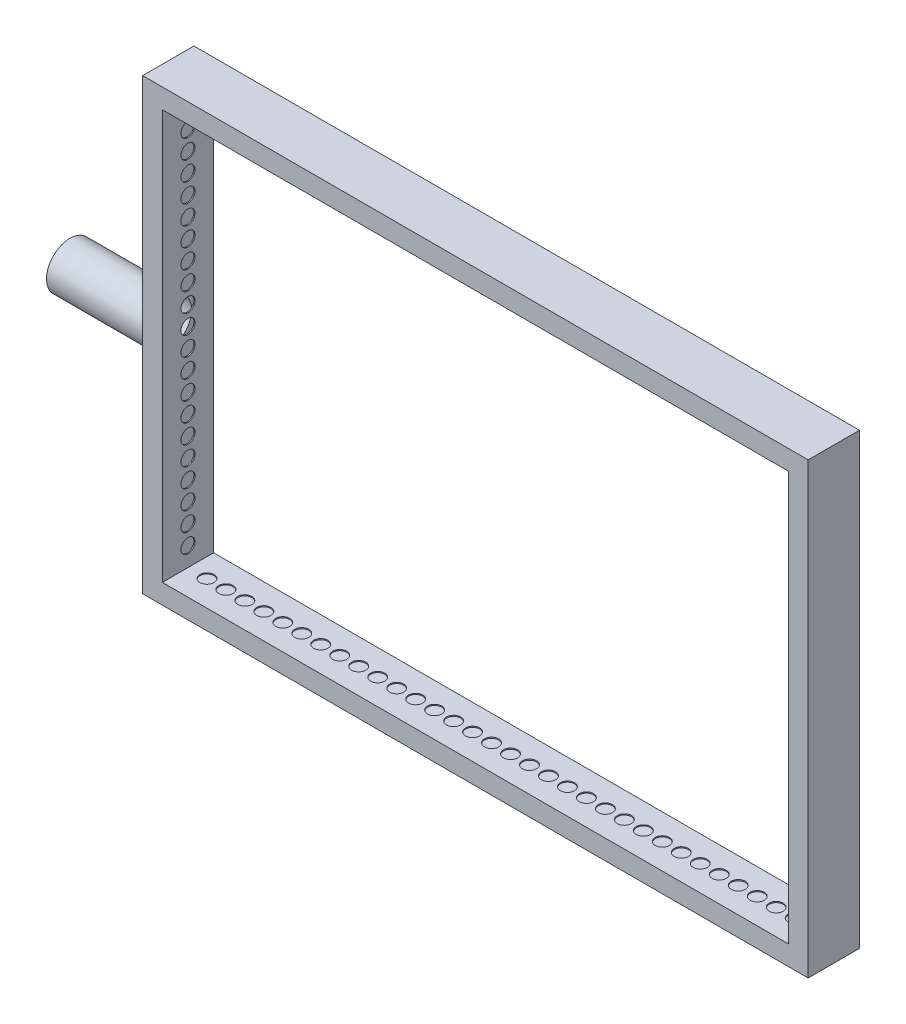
ISO-10303-21;
HEADER;
FILE_DESCRIPTION(('STEP AP214'),'2;1');
FILE_NAME('part.step','',(''),(''),'','','');
FILE_SCHEMA(('AUTOMOTIVE_DESIGN { 1 0 10303 214 1 1 1 1 }'));
ENDSEC;
DATA;
#1=APPLICATION_CONTEXT('core data for automotive mechanical design processes');
#2=APPLICATION_PROTOCOL_DEFINITION('international standard','automotive_design',2000,#1);
#3=PRODUCT_CONTEXT('',#1,'mechanical');
#4=PRODUCT('Part','Part','',(#3));
#5=PRODUCT_RELATED_PRODUCT_CATEGORY('part','',(#4));
#6=PRODUCT_DEFINITION_FORMATION('','',#4);
#7=PRODUCT_DEFINITION_CONTEXT('part definition',#1,'design');
#8=PRODUCT_DEFINITION('design','',#6,#7);
#9=PRODUCT_DEFINITION_SHAPE('','',#8);
#10=(LENGTH_UNIT() NAMED_UNIT(*) SI_UNIT(.MILLI.,.METRE.));
#11=(NAMED_UNIT(*) PLANE_ANGLE_UNIT() SI_UNIT($,.RADIAN.));
#12=(NAMED_UNIT(*) SI_UNIT($,.STERADIAN.) SOLID_ANGLE_UNIT());
#13=UNCERTAINTY_MEASURE_WITH_UNIT(LENGTH_MEASURE(1.E-05),#10,'distance_accuracy_value','');
#14=(GEOMETRIC_REPRESENTATION_CONTEXT(3) GLOBAL_UNCERTAINTY_ASSIGNED_CONTEXT((#13)) GLOBAL_UNIT_ASSIGNED_CONTEXT((#10,
#11,#12)) REPRESENTATION_CONTEXT('',''));
#15=CARTESIAN_POINT('',(0.,0.,0.));
#16=DIRECTION('',(0.,0.,1.));
#17=DIRECTION('',(1.,0.,0.));
#18=AXIS2_PLACEMENT_3D('',#15,#16,#17);
#19=CARTESIAN_POINT('',(0.,0.,73.));
#20=DIRECTION('',(1.,0.,0.));
#21=DIRECTION('',(0.,0.,-1.));
#22=AXIS2_PLACEMENT_3D('',#19,#20,#21);
#23=PLANE('',#22);
#24=CARTESIAN_POINT('',(0.,316.5,36.5));
#25=DIRECTION('',(1.,0.,0.));
#26=DIRECTION('',(0.,0.,-1.));
#27=AXIS2_PLACEMENT_3D('',#24,#25,#26);
#28=CIRCLE('',#27,33.25);
#29=CARTESIAN_POINT('',(0.,316.5,3.24999999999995));
#30=VERTEX_POINT('',#29);
#31=EDGE_CURVE('E11',#30,#30,#28,.F.);
#32=ORIENTED_EDGE('',*,*,#31,.F.);
#33=EDGE_LOOP('',(#32));
#34=FACE_BOUND('',#33,.T.);
#35=DIRECTION('',(0.,-1.,0.));
#36=VECTOR('',#35,1.);
#37=CARTESIAN_POINT('',(0.,0.,0.));
#38=LINE('',#37,#36);
#39=CARTESIAN_POINT('',(0.,638.5,0.));
#40=VERTEX_POINT('',#39);
#41=CARTESIAN_POINT('',(0.,0.,0.));
#42=VERTEX_POINT('',#41);
#43=EDGE_CURVE('E933',#40,#42,#38,.T.);
#44=ORIENTED_EDGE('',*,*,#43,.T.);
#45=DIRECTION('',(0.,0.,-1.));
#46=VECTOR('',#45,1.);
#47=CARTESIAN_POINT('',(0.,0.,73.));
#48=LINE('',#47,#46);
#49=CARTESIAN_POINT('',(0.,0.,73.));
#50=VERTEX_POINT('',#49);
#51=EDGE_CURVE('E38',#50,#42,#48,.T.);
#52=ORIENTED_EDGE('',*,*,#51,.F.);
#53=DIRECTION('',(0.,-1.,0.));
#54=VECTOR('',#53,1.);
#55=CARTESIAN_POINT('',(0.,0.,73.));
#56=LINE('',#55,#54);
#57=CARTESIAN_POINT('',(0.,638.5,73.));
#58=VERTEX_POINT('',#57);
#59=EDGE_CURVE('E934',#58,#50,#56,.T.);
#60=ORIENTED_EDGE('',*,*,#59,.F.);
#61=DIRECTION('',(0.,0.,-1.));
#62=VECTOR('',#61,1.);
#63=CARTESIAN_POINT('',(0.,638.5,73.));
#64=LINE('',#63,#62);
#65=EDGE_CURVE('E944',#58,#40,#64,.T.);
#66=ORIENTED_EDGE('',*,*,#65,.T.);
#67=EDGE_LOOP('',(#44,#52,#60,#66));
#68=FACE_BOUND('',#67,.T.);
#69=DIRECTION('',(0.,-1.,0.));
#70=VECTOR('',#69,1.);
#71=CARTESIAN_POINT('',(0.,485.315990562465,30.4428540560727));
#72=LINE('',#71,#70);
#73=CARTESIAN_POINT('',(0.,485.315990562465,30.4428540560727));
#74=VERTEX_POINT('',#73);
#75=CARTESIAN_POINT('',(0.,402.955182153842,30.4428540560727));
#76=VERTEX_POINT('',#75);
#77=EDGE_CURVE('E187',#74,#76,#72,.T.);
#78=ORIENTED_EDGE('',*,*,#77,.F.);
#79=DIRECTION('',(0.,0.,-1.));
#80=VECTOR('',#79,1.);
#81=CARTESIAN_POINT('',(0.,485.315990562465,30.4428540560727));
#82=LINE('',#81,#80);
#83=CARTESIAN_POINT('',(0.,485.315990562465,40.7379551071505));
#84=VERTEX_POINT('',#83);
#85=EDGE_CURVE('E184',#84,#74,#82,.T.);
#86=ORIENTED_EDGE('',*,*,#85,.F.);
#87=DIRECTION('',(0.,1.,0.));
#88=VECTOR('',#87,1.);
#89=CARTESIAN_POINT('',(0.,485.315990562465,40.7379551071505));
#90=LINE('',#89,#88);
#91=CARTESIAN_POINT('',(0.,402.955182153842,40.7379551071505));
#92=VERTEX_POINT('',#91);
#93=EDGE_CURVE('E50',#92,#84,#90,.T.);
#94=ORIENTED_EDGE('',*,*,#93,.F.);
#95=DIRECTION('',(0.,0.,1.));
#96=VECTOR('',#95,1.);
#97=CARTESIAN_POINT('',(0.,402.955182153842,30.4428540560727));
#98=LINE('',#97,#96);
#99=EDGE_CURVE('E45',#76,#92,#98,.T.);
#100=ORIENTED_EDGE('',*,*,#99,.F.);
#101=EDGE_LOOP('',(#78,#86,#94,#100));
#102=FACE_BOUND('',#101,.T.);
#103=ADVANCED_FACE('F31',(#34,#68,#102),#23,.F.);
#104=CARTESIAN_POINT('',(1.49999999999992,637.,1.5));
#105=DIRECTION('',(0.,1.,0.));
#106=DIRECTION('',(0.,0.,1.));
#107=AXIS2_PLACEMENT_3D('',#104,#105,#106);
#108=PLANE('',#107);
#109=DIRECTION('',(-1.,0.,0.));
#110=VECTOR('',#109,1.);
#111=CARTESIAN_POINT('',(1.49999999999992,637.,71.5));
#112=LINE('',#111,#110);
#113=CARTESIAN_POINT('',(945.5,637.,71.5));
#114=VERTEX_POINT('',#113);
#115=CARTESIAN_POINT('',(1.49999999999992,637.,71.5));
#116=VERTEX_POINT('',#115);
#117=EDGE_CURVE('E864',#114,#116,#112,.T.);
#118=ORIENTED_EDGE('',*,*,#117,.T.);
#119=DIRECTION('',(0.,0.,1.));
#120=VECTOR('',#119,1.);
#121=CARTESIAN_POINT('',(1.49999999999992,637.,1.5));
#122=LINE('',#121,#120);
#123=CARTESIAN_POINT('',(1.49999999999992,637.,1.5));
#124=VERTEX_POINT('',#123);
#125=EDGE_CURVE('E884',#124,#116,#122,.T.);
#126=ORIENTED_EDGE('',*,*,#125,.F.);
#127=DIRECTION('',(-1.,0.,0.));
#128=VECTOR('',#127,1.);
#129=CARTESIAN_POINT('',(1.49999999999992,637.,1.5));
#130=LINE('',#129,#128);
#131=CARTESIAN_POINT('',(945.5,637.,1.5));
#132=VERTEX_POINT('',#131);
#133=EDGE_CURVE('E871',#132,#124,#130,.T.);
#134=ORIENTED_EDGE('',*,*,#133,.F.);
#135=DIRECTION('',(0.,0.,1.));
#136=VECTOR('',#135,1.);
#137=CARTESIAN_POINT('',(945.5,637.,1.5));
#138=LINE('',#137,#136);
#139=EDGE_CURVE('E895',#132,#114,#138,.T.);
#140=ORIENTED_EDGE('',*,*,#139,.T.);
#141=EDGE_LOOP('',(#118,#126,#134,#140));
#142=FACE_BOUND('',#141,.T.);
#143=ADVANCED_FACE('F1018',(#142),#108,.F.);
#144=CARTESIAN_POINT('',(945.5,1.5,1.5));
#145=DIRECTION('',(1.,0.,0.));
#146=DIRECTION('',(0.,0.,-1.));
#147=AXIS2_PLACEMENT_3D('',#144,#145,#146);
#148=PLANE('',#147);
#149=DIRECTION('',(0.,1.,0.));
#150=VECTOR('',#149,1.);
#151=CARTESIAN_POINT('',(945.5,1.5,71.5));
#152=LINE('',#151,#150);
#153=CARTESIAN_POINT('',(945.5,1.5,71.5));
#154=VERTEX_POINT('',#153);
#155=EDGE_CURVE('E875',#154,#114,#152,.T.);
#156=ORIENTED_EDGE('',*,*,#155,.T.);
#157=ORIENTED_EDGE('',*,*,#139,.F.);
#158=DIRECTION('',(0.,1.,0.));
#159=VECTOR('',#158,1.);
#160=CARTESIAN_POINT('',(945.5,1.5,1.5));
#161=LINE('',#160,#159);
#162=CARTESIAN_POINT('',(945.5,1.5,1.5));
#163=VERTEX_POINT('',#162);
#164=EDGE_CURVE('E881',#163,#132,#161,.T.);
#165=ORIENTED_EDGE('',*,*,#164,.F.);
#166=DIRECTION('',(0.,0.,1.));
#167=VECTOR('',#166,1.);
#168=CARTESIAN_POINT('',(945.5,1.5,1.5));
#169=LINE('',#168,#167);
#170=EDGE_CURVE('E898',#163,#154,#169,.T.);
#171=ORIENTED_EDGE('',*,*,#170,.T.);
#172=EDGE_LOOP('',(#156,#157,#165,#171));
#173=FACE_BOUND('',#172,.T.);
#174=ADVANCED_FACE('F1023',(#173),#148,.F.);
#175=CARTESIAN_POINT('',(1.5,1.5,1.5));
#176=DIRECTION('',(0.,-1.,0.));
#177=DIRECTION('',(1.,0.,0.));
#178=AXIS2_PLACEMENT_3D('',#175,#176,#177);
#179=PLANE('',#178);
#180=DIRECTION('',(1.,0.,0.));
#181=VECTOR('',#180,1.);
#182=CARTESIAN_POINT('',(1.5,1.5,71.5));
#183=LINE('',#182,#181);
#184=CARTESIAN_POINT('',(1.5,1.5,71.5));
#185=VERTEX_POINT('',#184);
#186=EDGE_CURVE('E890',#185,#154,#183,.T.);
#187=ORIENTED_EDGE('',*,*,#186,.T.);
#188=ORIENTED_EDGE('',*,*,#170,.F.);
#189=DIRECTION('',(1.,0.,0.));
#190=VECTOR('',#189,1.);
#191=CARTESIAN_POINT('',(1.5,1.5,1.5));
#192=LINE('',#191,#190);
#193=CARTESIAN_POINT('',(1.5,1.5,1.5));
#194=VERTEX_POINT('',#193);
#195=EDGE_CURVE('E878',#194,#163,#192,.T.);
#196=ORIENTED_EDGE('',*,*,#195,.F.);
#197=DIRECTION('',(0.,0.,1.));
#198=VECTOR('',#197,1.);
#199=CARTESIAN_POINT('',(1.5,1.5,1.5));
#200=LINE('',#199,#198);
#201=EDGE_CURVE('E900',#194,#185,#200,.T.);
#202=ORIENTED_EDGE('',*,*,#201,.T.);
#203=EDGE_LOOP('',(#187,#188,#196,#202));
#204=FACE_BOUND('',#203,.T.);
#205=ADVANCED_FACE('F1491',(#204),#179,.F.);
#206=CARTESIAN_POINT('',(1.49999999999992,637.,1.5));
#207=DIRECTION('',(-1.,0.,0.));
#208=DIRECTION('',(0.,-1.,0.));
#209=AXIS2_PLACEMENT_3D('',#206,#207,#208);
#210=PLANE('',#209);
#211=CARTESIAN_POINT('',(1.49999999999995,316.5,36.5));
#212=DIRECTION('',(-1.,0.,0.));
#213=DIRECTION('',(0.,-1.,0.));
#214=AXIS2_PLACEMENT_3D('',#211,#212,#213);
#215=CIRCLE('',#214,31.75);
#216=CARTESIAN_POINT('',(1.49999999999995,284.75,36.5));
#217=VERTEX_POINT('',#216);
#218=EDGE_CURVE('E191',#217,#217,#215,.F.);
#219=ORIENTED_EDGE('',*,*,#218,.F.);
#220=EDGE_LOOP('',(#219));
#221=FACE_BOUND('',#220,.T.);
#222=DIRECTION('',(0.,-1.,0.));
#223=VECTOR('',#222,1.);
#224=CARTESIAN_POINT('',(1.49999999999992,637.,71.5));
#225=LINE('',#224,#223);
#226=EDGE_CURVE('E887',#116,#185,#225,.T.);
#227=ORIENTED_EDGE('',*,*,#226,.T.);
#228=ORIENTED_EDGE('',*,*,#201,.F.);
#229=DIRECTION('',(0.,-1.,0.));
#230=VECTOR('',#229,1.);
#231=CARTESIAN_POINT('',(1.49999999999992,637.,1.5));
#232=LINE('',#231,#230);
#233=EDGE_CURVE('E874',#124,#194,#232,.T.);
#234=ORIENTED_EDGE('',*,*,#233,.F.);
#235=ORIENTED_EDGE('',*,*,#125,.T.);
#236=EDGE_LOOP('',(#227,#228,#234,#235));
#237=FACE_BOUND('',#236,.T.);
#238=ADVANCED_FACE('F1484',(#221,#237),#210,.F.);
#239=CARTESIAN_POINT('',(945.5,637.,1.5));
#240=DIRECTION('',(0.,0.,1.));
#241=DIRECTION('',(1.,0.,0.));
#242=AXIS2_PLACEMENT_3D('',#239,#240,#241);
#243=PLANE('',#242);
#244=DIRECTION('',(0.,1.,0.));
#245=VECTOR('',#244,1.);
#246=CARTESIAN_POINT('',(920.5,26.5000000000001,1.5));
#247=LINE('',#246,#245);
#248=CARTESIAN_POINT('',(920.5,26.5000000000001,1.5));
#249=VERTEX_POINT('',#248);
#250=CARTESIAN_POINT('',(920.5,612.,1.5));
#251=VERTEX_POINT('',#250);
#252=EDGE_CURVE('E849',#249,#251,#247,.T.);
#253=ORIENTED_EDGE('',*,*,#252,.F.);
#254=DIRECTION('',(1.,0.,0.));
#255=VECTOR('',#254,1.);
#256=CARTESIAN_POINT('',(920.5,26.5000000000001,1.5));
#257=LINE('',#256,#255);
#258=CARTESIAN_POINT('',(26.5,26.5000000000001,1.5));
#259=VERTEX_POINT('',#258);
#260=EDGE_CURVE('E846',#259,#249,#257,.T.);
#261=ORIENTED_EDGE('',*,*,#260,.F.);
#262=DIRECTION('',(0.,-1.,0.));
#263=VECTOR('',#262,1.);
#264=CARTESIAN_POINT('',(26.5,26.5,1.5));
#265=LINE('',#264,#263);
#266=CARTESIAN_POINT('',(26.5,612.,1.5));
#267=VERTEX_POINT('',#266);
#268=EDGE_CURVE('E842',#267,#259,#265,.T.);
#269=ORIENTED_EDGE('',*,*,#268,.F.);
#270=DIRECTION('',(-1.,0.,0.));
#271=VECTOR('',#270,1.);
#272=CARTESIAN_POINT('',(920.5,612.,1.5));
#273=LINE('',#272,#271);
#274=EDGE_CURVE('E839',#251,#267,#273,.T.);
#275=ORIENTED_EDGE('',*,*,#274,.F.);
#276=EDGE_LOOP('',(#253,#261,#269,#275));
#277=FACE_BOUND('',#276,.T.);
#278=ORIENTED_EDGE('',*,*,#133,.T.);
#279=ORIENTED_EDGE('',*,*,#233,.T.);
#280=ORIENTED_EDGE('',*,*,#195,.T.);
#281=ORIENTED_EDGE('',*,*,#164,.T.);
#282=EDGE_LOOP('',(#278,#279,#280,#281));
#283=FACE_BOUND('',#282,.T.);
#284=ADVANCED_FACE('F1481',(#277,#283),#243,.T.);
#285=CARTESIAN_POINT('',(945.5,637.,71.5));
#286=DIRECTION('',(0.,0.,1.));
#287=DIRECTION('',(1.,0.,0.));
#288=AXIS2_PLACEMENT_3D('',#285,#286,#287);
#289=PLANE('',#288);
#290=DIRECTION('',(-1.,0.,0.));
#291=VECTOR('',#290,1.);
#292=CARTESIAN_POINT('',(920.5,612.,71.5));
#293=LINE('',#292,#291);
#294=CARTESIAN_POINT('',(920.5,612.,71.5));
#295=VERTEX_POINT('',#294);
#296=CARTESIAN_POINT('',(26.5,612.,71.5));
#297=VERTEX_POINT('',#296);
#298=EDGE_CURVE('E836',#295,#297,#293,.T.);
#299=ORIENTED_EDGE('',*,*,#298,.T.);
#300=DIRECTION('',(0.,-1.,0.));
#301=VECTOR('',#300,1.);
#302=CARTESIAN_POINT('',(26.5,26.5,71.5));
#303=LINE('',#302,#301);
#304=CARTESIAN_POINT('',(26.5,26.5,71.5));
#305=VERTEX_POINT('',#304);
#306=EDGE_CURVE('E854',#297,#305,#303,.T.);
#307=ORIENTED_EDGE('',*,*,#306,.T.);
#308=DIRECTION('',(1.,0.,0.));
#309=VECTOR('',#308,1.);
#310=CARTESIAN_POINT('',(920.5,26.5000000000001,71.5));
#311=LINE('',#310,#309);
#312=CARTESIAN_POINT('',(920.5,26.5000000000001,71.5));
#313=VERTEX_POINT('',#312);
#314=EDGE_CURVE('E857',#305,#313,#311,.T.);
#315=ORIENTED_EDGE('',*,*,#314,.T.);
#316=DIRECTION('',(0.,1.,0.));
#317=VECTOR('',#316,1.);
#318=CARTESIAN_POINT('',(920.5,26.5000000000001,71.5));
#319=LINE('',#318,#317);
#320=EDGE_CURVE('E843',#313,#295,#319,.T.);
#321=ORIENTED_EDGE('',*,*,#320,.T.);
#322=EDGE_LOOP('',(#299,#307,#315,#321));
#323=FACE_BOUND('',#322,.T.);
#324=ORIENTED_EDGE('',*,*,#117,.F.);
#325=ORIENTED_EDGE('',*,*,#155,.F.);
#326=ORIENTED_EDGE('',*,*,#186,.F.);
#327=ORIENTED_EDGE('',*,*,#226,.F.);
#328=EDGE_LOOP('',(#324,#325,#326,#327));
#329=FACE_BOUND('',#328,.T.);
#330=ADVANCED_FACE('F1479',(#323,#329),#289,.F.);
#331=CARTESIAN_POINT('',(920.5,612.,1.5));
#332=DIRECTION('',(0.,1.,0.));
#333=DIRECTION('',(-1.,0.,0.));
#334=AXIS2_PLACEMENT_3D('',#331,#332,#333);
#335=PLANE('',#334);
#336=CARTESIAN_POINT('',(54.9999999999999,612.,36.4999999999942));
#337=DIRECTION('',(0.,-1.,0.));
#338=DIRECTION('',(0.,0.,-1.));
#339=AXIS2_PLACEMENT_3D('',#336,#337,#338);
#340=CIRCLE('',#339,9.99999999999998);
#341=CARTESIAN_POINT('',(54.9999999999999,612.,26.4999999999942));
#342=VERTEX_POINT('',#341);
#343=EDGE_CURVE('E203',#342,#342,#340,.T.);
#344=ORIENTED_EDGE('',*,*,#343,.T.);
#345=EDGE_LOOP('',(#344));
#346=FACE_BOUND('',#345,.T.);
#347=CARTESIAN_POINT('',(82.,612.,36.4999999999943));
#348=DIRECTION('',(0.,-1.,0.));
#349=DIRECTION('',(0.,0.,-1.));
#350=AXIS2_PLACEMENT_3D('',#347,#348,#349);
#351=CIRCLE('',#350,9.99999999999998);
#352=CARTESIAN_POINT('',(82.,612.,26.4999999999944));
#353=VERTEX_POINT('',#352);
#354=EDGE_CURVE('E209',#353,#353,#351,.T.);
#355=ORIENTED_EDGE('',*,*,#354,.T.);
#356=EDGE_LOOP('',(#355));
#357=FACE_BOUND('',#356,.T.);
#358=CARTESIAN_POINT('',(109.,612.,36.4999999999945));
#359=DIRECTION('',(0.,-1.,0.));
#360=DIRECTION('',(0.,0.,-1.));
#361=AXIS2_PLACEMENT_3D('',#358,#359,#360);
#362=CIRCLE('',#361,9.99999999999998);
#363=CARTESIAN_POINT('',(109.,612.,26.4999999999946));
#364=VERTEX_POINT('',#363);
#365=EDGE_CURVE('E215',#364,#364,#362,.T.);
#366=ORIENTED_EDGE('',*,*,#365,.T.);
#367=EDGE_LOOP('',(#366));
#368=FACE_BOUND('',#367,.T.);
#369=CARTESIAN_POINT('',(136.,612.,36.4999999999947));
#370=DIRECTION('',(0.,-1.,0.));
#371=DIRECTION('',(0.,0.,-1.));
#372=AXIS2_PLACEMENT_3D('',#369,#370,#371);
#373=CIRCLE('',#372,9.99999999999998);
#374=CARTESIAN_POINT('',(136.,612.,26.4999999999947));
#375=VERTEX_POINT('',#374);
#376=EDGE_CURVE('E221',#375,#375,#373,.T.);
#377=ORIENTED_EDGE('',*,*,#376,.T.);
#378=EDGE_LOOP('',(#377));
#379=FACE_BOUND('',#378,.T.);
#380=CARTESIAN_POINT('',(163.,612.,36.4999999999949));
#381=DIRECTION('',(0.,-1.,0.));
#382=DIRECTION('',(0.,0.,-1.));
#383=AXIS2_PLACEMENT_3D('',#380,#381,#382);
#384=CIRCLE('',#383,9.99999999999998);
#385=CARTESIAN_POINT('',(163.,612.,26.4999999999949));
#386=VERTEX_POINT('',#385);
#387=EDGE_CURVE('E227',#386,#386,#384,.T.);
#388=ORIENTED_EDGE('',*,*,#387,.T.);
#389=EDGE_LOOP('',(#388));
#390=FACE_BOUND('',#389,.T.);
#391=CARTESIAN_POINT('',(190.,612.,36.4999999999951));
#392=DIRECTION('',(0.,-1.,0.));
#393=DIRECTION('',(0.,0.,-1.));
#394=AXIS2_PLACEMENT_3D('',#391,#392,#393);
#395=CIRCLE('',#394,9.99999999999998);
#396=CARTESIAN_POINT('',(190.,612.,26.4999999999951));
#397=VERTEX_POINT('',#396);
#398=EDGE_CURVE('E233',#397,#397,#395,.T.);
#399=ORIENTED_EDGE('',*,*,#398,.T.);
#400=EDGE_LOOP('',(#399));
#401=FACE_BOUND('',#400,.T.);
#402=CARTESIAN_POINT('',(217.,612.,36.4999999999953));
#403=DIRECTION('',(0.,-1.,0.));
#404=DIRECTION('',(0.,0.,-1.));
#405=AXIS2_PLACEMENT_3D('',#402,#403,#404);
#406=CIRCLE('',#405,9.99999999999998);
#407=CARTESIAN_POINT('',(217.,612.,26.4999999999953));
#408=VERTEX_POINT('',#407);
#409=EDGE_CURVE('E239',#408,#408,#406,.T.);
#410=ORIENTED_EDGE('',*,*,#409,.T.);
#411=EDGE_LOOP('',(#410));
#412=FACE_BOUND('',#411,.T.);
#413=CARTESIAN_POINT('',(244.,612.,36.4999999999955));
#414=DIRECTION('',(0.,-1.,0.));
#415=DIRECTION('',(0.,0.,-1.));
#416=AXIS2_PLACEMENT_3D('',#413,#414,#415);
#417=CIRCLE('',#416,9.99999999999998);
#418=CARTESIAN_POINT('',(244.,612.,26.4999999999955));
#419=VERTEX_POINT('',#418);
#420=EDGE_CURVE('E245',#419,#419,#417,.T.);
#421=ORIENTED_EDGE('',*,*,#420,.T.);
#422=EDGE_LOOP('',(#421));
#423=FACE_BOUND('',#422,.T.);
#424=CARTESIAN_POINT('',(271.,612.,36.4999999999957));
#425=DIRECTION('',(0.,-1.,0.));
#426=DIRECTION('',(0.,0.,-1.));
#427=AXIS2_PLACEMENT_3D('',#424,#425,#426);
#428=CIRCLE('',#427,9.99999999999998);
#429=CARTESIAN_POINT('',(271.,612.,26.4999999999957));
#430=VERTEX_POINT('',#429);
#431=EDGE_CURVE('E251',#430,#430,#428,.T.);
#432=ORIENTED_EDGE('',*,*,#431,.T.);
#433=EDGE_LOOP('',(#432));
#434=FACE_BOUND('',#433,.T.);
#435=CARTESIAN_POINT('',(298.,612.,36.4999999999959));
#436=DIRECTION('',(0.,-1.,0.));
#437=DIRECTION('',(0.,0.,-1.));
#438=AXIS2_PLACEMENT_3D('',#435,#436,#437);
#439=CIRCLE('',#438,9.99999999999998);
#440=CARTESIAN_POINT('',(298.,612.,26.4999999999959));
#441=VERTEX_POINT('',#440);
#442=EDGE_CURVE('E257',#441,#441,#439,.T.);
#443=ORIENTED_EDGE('',*,*,#442,.T.);
#444=EDGE_LOOP('',(#443));
#445=FACE_BOUND('',#444,.T.);
#446=CARTESIAN_POINT('',(325.,612.,36.499999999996));
#447=DIRECTION('',(0.,-1.,0.));
#448=DIRECTION('',(0.,0.,-1.));
#449=AXIS2_PLACEMENT_3D('',#446,#447,#448);
#450=CIRCLE('',#449,9.99999999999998);
#451=CARTESIAN_POINT('',(325.,612.,26.4999999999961));
#452=VERTEX_POINT('',#451);
#453=EDGE_CURVE('E263',#452,#452,#450,.T.);
#454=ORIENTED_EDGE('',*,*,#453,.T.);
#455=EDGE_LOOP('',(#454));
#456=FACE_BOUND('',#455,.T.);
#457=CARTESIAN_POINT('',(352.,612.,36.4999999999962));
#458=DIRECTION('',(0.,-1.,0.));
#459=DIRECTION('',(0.,0.,-1.));
#460=AXIS2_PLACEMENT_3D('',#457,#458,#459);
#461=CIRCLE('',#460,9.99999999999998);
#462=CARTESIAN_POINT('',(352.,612.,26.4999999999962));
#463=VERTEX_POINT('',#462);
#464=EDGE_CURVE('E269',#463,#463,#461,.T.);
#465=ORIENTED_EDGE('',*,*,#464,.T.);
#466=EDGE_LOOP('',(#465));
#467=FACE_BOUND('',#466,.T.);
#468=CARTESIAN_POINT('',(379.,612.,36.4999999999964));
#469=DIRECTION('',(0.,-1.,0.));
#470=DIRECTION('',(0.,0.,-1.));
#471=AXIS2_PLACEMENT_3D('',#468,#469,#470);
#472=CIRCLE('',#471,9.99999999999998);
#473=CARTESIAN_POINT('',(379.,612.,26.4999999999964));
#474=VERTEX_POINT('',#473);
#475=EDGE_CURVE('E275',#474,#474,#472,.T.);
#476=ORIENTED_EDGE('',*,*,#475,.T.);
#477=EDGE_LOOP('',(#476));
#478=FACE_BOUND('',#477,.T.);
#479=CARTESIAN_POINT('',(406.,612.,36.4999999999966));
#480=DIRECTION('',(0.,-1.,0.));
#481=DIRECTION('',(0.,0.,-1.));
#482=AXIS2_PLACEMENT_3D('',#479,#480,#481);
#483=CIRCLE('',#482,9.99999999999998);
#484=CARTESIAN_POINT('',(406.,612.,26.4999999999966));
#485=VERTEX_POINT('',#484);
#486=EDGE_CURVE('E281',#485,#485,#483,.T.);
#487=ORIENTED_EDGE('',*,*,#486,.T.);
#488=EDGE_LOOP('',(#487));
#489=FACE_BOUND('',#488,.T.);
#490=CARTESIAN_POINT('',(433.,612.,36.4999999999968));
#491=DIRECTION('',(0.,-1.,0.));
#492=DIRECTION('',(0.,0.,-1.));
#493=AXIS2_PLACEMENT_3D('',#490,#491,#492);
#494=CIRCLE('',#493,9.99999999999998);
#495=CARTESIAN_POINT('',(433.,612.,26.4999999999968));
#496=VERTEX_POINT('',#495);
#497=EDGE_CURVE('E287',#496,#496,#494,.T.);
#498=ORIENTED_EDGE('',*,*,#497,.T.);
#499=EDGE_LOOP('',(#498));
#500=FACE_BOUND('',#499,.T.);
#501=CARTESIAN_POINT('',(460.,612.,36.499999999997));
#502=DIRECTION('',(0.,-1.,0.));
#503=DIRECTION('',(0.,0.,-1.));
#504=AXIS2_PLACEMENT_3D('',#501,#502,#503);
#505=CIRCLE('',#504,9.99999999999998);
#506=CARTESIAN_POINT('',(460.,612.,26.499999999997));
#507=VERTEX_POINT('',#506);
#508=EDGE_CURVE('E293',#507,#507,#505,.T.);
#509=ORIENTED_EDGE('',*,*,#508,.T.);
#510=EDGE_LOOP('',(#509));
#511=FACE_BOUND('',#510,.T.);
#512=CARTESIAN_POINT('',(487.,612.,36.4999999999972));
#513=DIRECTION('',(0.,-1.,0.));
#514=DIRECTION('',(0.,0.,-1.));
#515=AXIS2_PLACEMENT_3D('',#512,#513,#514);
#516=CIRCLE('',#515,9.99999999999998);
#517=CARTESIAN_POINT('',(487.,612.,26.4999999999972));
#518=VERTEX_POINT('',#517);
#519=EDGE_CURVE('E299',#518,#518,#516,.T.);
#520=ORIENTED_EDGE('',*,*,#519,.T.);
#521=EDGE_LOOP('',(#520));
#522=FACE_BOUND('',#521,.T.);
#523=CARTESIAN_POINT('',(514.,612.,36.4999999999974));
#524=DIRECTION('',(0.,-1.,0.));
#525=DIRECTION('',(0.,0.,-1.));
#526=AXIS2_PLACEMENT_3D('',#523,#524,#525);
#527=CIRCLE('',#526,9.99999999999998);
#528=CARTESIAN_POINT('',(514.,612.,26.4999999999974));
#529=VERTEX_POINT('',#528);
#530=EDGE_CURVE('E305',#529,#529,#527,.T.);
#531=ORIENTED_EDGE('',*,*,#530,.T.);
#532=EDGE_LOOP('',(#531));
#533=FACE_BOUND('',#532,.T.);
#534=CARTESIAN_POINT('',(541.,612.,36.4999999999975));
#535=DIRECTION('',(0.,-1.,0.));
#536=DIRECTION('',(0.,0.,-1.));
#537=AXIS2_PLACEMENT_3D('',#534,#535,#536);
#538=CIRCLE('',#537,9.99999999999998);
#539=CARTESIAN_POINT('',(541.,612.,26.4999999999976));
#540=VERTEX_POINT('',#539);
#541=EDGE_CURVE('E311',#540,#540,#538,.T.);
#542=ORIENTED_EDGE('',*,*,#541,.T.);
#543=EDGE_LOOP('',(#542));
#544=FACE_BOUND('',#543,.T.);
#545=CARTESIAN_POINT('',(568.,612.,36.4999999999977));
#546=DIRECTION('',(0.,-1.,0.));
#547=DIRECTION('',(0.,0.,-1.));
#548=AXIS2_PLACEMENT_3D('',#545,#546,#547);
#549=CIRCLE('',#548,10.0000000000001);
#550=CARTESIAN_POINT('',(568.,612.,26.4999999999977));
#551=VERTEX_POINT('',#550);
#552=EDGE_CURVE('E317',#551,#551,#549,.T.);
#553=ORIENTED_EDGE('',*,*,#552,.T.);
#554=EDGE_LOOP('',(#553));
#555=FACE_BOUND('',#554,.T.);
#556=CARTESIAN_POINT('',(595.,612.,36.4999999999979));
#557=DIRECTION('',(0.,-1.,0.));
#558=DIRECTION('',(0.,0.,-1.));
#559=AXIS2_PLACEMENT_3D('',#556,#557,#558);
#560=CIRCLE('',#559,9.99999999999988);
#561=CARTESIAN_POINT('',(595.,612.,26.499999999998));
#562=VERTEX_POINT('',#561);
#563=EDGE_CURVE('E323',#562,#562,#560,.T.);
#564=ORIENTED_EDGE('',*,*,#563,.T.);
#565=EDGE_LOOP('',(#564));
#566=FACE_BOUND('',#565,.T.);
#567=CARTESIAN_POINT('',(622.,612.,36.4999999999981));
#568=DIRECTION('',(0.,-1.,0.));
#569=DIRECTION('',(0.,0.,-1.));
#570=AXIS2_PLACEMENT_3D('',#567,#568,#569);
#571=CIRCLE('',#570,9.99999999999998);
#572=CARTESIAN_POINT('',(622.,612.,26.4999999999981));
#573=VERTEX_POINT('',#572);
#574=EDGE_CURVE('E329',#573,#573,#571,.T.);
#575=ORIENTED_EDGE('',*,*,#574,.T.);
#576=EDGE_LOOP('',(#575));
#577=FACE_BOUND('',#576,.T.);
#578=CARTESIAN_POINT('',(649.,612.,36.4999999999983));
#579=DIRECTION('',(0.,-1.,0.));
#580=DIRECTION('',(0.,0.,-1.));
#581=AXIS2_PLACEMENT_3D('',#578,#579,#580);
#582=CIRCLE('',#581,9.99999999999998);
#583=CARTESIAN_POINT('',(649.,612.,26.4999999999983));
#584=VERTEX_POINT('',#583);
#585=EDGE_CURVE('E335',#584,#584,#582,.T.);
#586=ORIENTED_EDGE('',*,*,#585,.T.);
#587=EDGE_LOOP('',(#586));
#588=FACE_BOUND('',#587,.T.);
#589=CARTESIAN_POINT('',(676.,612.,36.4999999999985));
#590=DIRECTION('',(0.,-1.,0.));
#591=DIRECTION('',(0.,0.,-1.));
#592=AXIS2_PLACEMENT_3D('',#589,#590,#591);
#593=CIRCLE('',#592,9.99999999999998);
#594=CARTESIAN_POINT('',(676.,612.,26.4999999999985));
#595=VERTEX_POINT('',#594);
#596=EDGE_CURVE('E341',#595,#595,#593,.T.);
#597=ORIENTED_EDGE('',*,*,#596,.T.);
#598=EDGE_LOOP('',(#597));
#599=FACE_BOUND('',#598,.T.);
#600=CARTESIAN_POINT('',(703.,612.,36.4999999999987));
#601=DIRECTION('',(0.,-1.,0.));
#602=DIRECTION('',(0.,0.,-1.));
#603=AXIS2_PLACEMENT_3D('',#600,#601,#602);
#604=CIRCLE('',#603,10.0000000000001);
#605=CARTESIAN_POINT('',(703.,612.,26.4999999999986));
#606=VERTEX_POINT('',#605);
#607=EDGE_CURVE('E347',#606,#606,#604,.T.);
#608=ORIENTED_EDGE('',*,*,#607,.T.);
#609=EDGE_LOOP('',(#608));
#610=FACE_BOUND('',#609,.T.);
#611=CARTESIAN_POINT('',(730.,612.,36.4999999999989));
#612=DIRECTION('',(0.,-1.,0.));
#613=DIRECTION('',(0.,0.,-1.));
#614=AXIS2_PLACEMENT_3D('',#611,#612,#613);
#615=CIRCLE('',#614,9.99999999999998);
#616=CARTESIAN_POINT('',(730.,612.,26.4999999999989));
#617=VERTEX_POINT('',#616);
#618=EDGE_CURVE('E353',#617,#617,#615,.T.);
#619=ORIENTED_EDGE('',*,*,#618,.T.);
#620=EDGE_LOOP('',(#619));
#621=FACE_BOUND('',#620,.T.);
#622=CARTESIAN_POINT('',(757.,612.,36.4999999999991));
#623=DIRECTION('',(0.,-1.,0.));
#624=DIRECTION('',(0.,0.,-1.));
#625=AXIS2_PLACEMENT_3D('',#622,#623,#624);
#626=CIRCLE('',#625,9.99999999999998);
#627=CARTESIAN_POINT('',(757.,612.,26.4999999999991));
#628=VERTEX_POINT('',#627);
#629=EDGE_CURVE('E359',#628,#628,#626,.T.);
#630=ORIENTED_EDGE('',*,*,#629,.T.);
#631=EDGE_LOOP('',(#630));
#632=FACE_BOUND('',#631,.T.);
#633=CARTESIAN_POINT('',(784.,612.,36.4999999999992));
#634=DIRECTION('',(0.,-1.,0.));
#635=DIRECTION('',(0.,0.,-1.));
#636=AXIS2_PLACEMENT_3D('',#633,#634,#635);
#637=CIRCLE('',#636,9.99999999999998);
#638=CARTESIAN_POINT('',(784.,612.,26.4999999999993));
#639=VERTEX_POINT('',#638);
#640=EDGE_CURVE('E365',#639,#639,#637,.T.);
#641=ORIENTED_EDGE('',*,*,#640,.T.);
#642=EDGE_LOOP('',(#641));
#643=FACE_BOUND('',#642,.T.);
#644=CARTESIAN_POINT('',(811.,612.,36.4999999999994));
#645=DIRECTION('',(0.,-1.,0.));
#646=DIRECTION('',(0.,0.,-1.));
#647=AXIS2_PLACEMENT_3D('',#644,#645,#646);
#648=CIRCLE('',#647,9.99999999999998);
#649=CARTESIAN_POINT('',(811.,612.,26.4999999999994));
#650=VERTEX_POINT('',#649);
#651=EDGE_CURVE('E371',#650,#650,#648,.T.);
#652=ORIENTED_EDGE('',*,*,#651,.T.);
#653=EDGE_LOOP('',(#652));
#654=FACE_BOUND('',#653,.T.);
#655=CARTESIAN_POINT('',(838.,612.,36.4999999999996));
#656=DIRECTION('',(0.,-1.,0.));
#657=DIRECTION('',(0.,0.,-1.));
#658=AXIS2_PLACEMENT_3D('',#655,#656,#657);
#659=CIRCLE('',#658,9.99999999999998);
#660=CARTESIAN_POINT('',(838.,612.,26.4999999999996));
#661=VERTEX_POINT('',#660);
#662=EDGE_CURVE('E377',#661,#661,#659,.T.);
#663=ORIENTED_EDGE('',*,*,#662,.T.);
#664=EDGE_LOOP('',(#663));
#665=FACE_BOUND('',#664,.T.);
#666=CARTESIAN_POINT('',(865.,612.,36.4999999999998));
#667=DIRECTION('',(0.,-1.,0.));
#668=DIRECTION('',(0.,0.,-1.));
#669=AXIS2_PLACEMENT_3D('',#666,#667,#668);
#670=CIRCLE('',#669,9.99999999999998);
#671=CARTESIAN_POINT('',(865.,612.,26.4999999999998));
#672=VERTEX_POINT('',#671);
#673=EDGE_CURVE('E383',#672,#672,#670,.T.);
#674=ORIENTED_EDGE('',*,*,#673,.T.);
#675=EDGE_LOOP('',(#674));
#676=FACE_BOUND('',#675,.T.);
#677=CARTESIAN_POINT('',(892.,612.,36.5));
#678=DIRECTION('',(0.,-1.,0.));
#679=DIRECTION('',(0.,0.,-1.));
#680=AXIS2_PLACEMENT_3D('',#677,#678,#679);
#681=CIRCLE('',#680,9.99999999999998);
#682=CARTESIAN_POINT('',(892.,612.,26.5));
#683=VERTEX_POINT('',#682);
#684=EDGE_CURVE('E389',#683,#683,#681,.T.);
#685=ORIENTED_EDGE('',*,*,#684,.T.);
#686=EDGE_LOOP('',(#685));
#687=FACE_BOUND('',#686,.T.);
#688=ORIENTED_EDGE('',*,*,#298,.F.);
#689=DIRECTION('',(0.,0.,1.));
#690=VECTOR('',#689,1.);
#691=CARTESIAN_POINT('',(920.5,612.,1.5));
#692=LINE('',#691,#690);
#693=EDGE_CURVE('E862',#251,#295,#692,.T.);
#694=ORIENTED_EDGE('',*,*,#693,.F.);
#695=ORIENTED_EDGE('',*,*,#274,.T.);
#696=DIRECTION('',(0.,0.,1.));
#697=VECTOR('',#696,1.);
#698=CARTESIAN_POINT('',(26.5,612.,1.5));
#699=LINE('',#698,#697);
#700=EDGE_CURVE('E852',#267,#297,#699,.T.);
#701=ORIENTED_EDGE('',*,*,#700,.T.);
#702=EDGE_LOOP('',(#688,#694,#695,#701));
#703=FACE_BOUND('',#702,.T.);
#704=ADVANCED_FACE('F1469',(#346,#357,#368,#379,#390,#401,#412,#423,#434,#445,#456,#467,#478,
#489,#500,#511,#522,#533,#544,#555,#566,#577,#588,#599,#610,#621,#632,#643,#654,#665,#676,#687,
#703),#335,.T.);
#705=CARTESIAN_POINT('',(920.5,26.5000000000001,1.5));
#706=DIRECTION('',(1.,0.,0.));
#707=DIRECTION('',(0.,0.,-1.));
#708=AXIS2_PLACEMENT_3D('',#705,#706,#707);
#709=PLANE('',#708);
#710=CARTESIAN_POINT('',(920.5,595.,36.4999999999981));
#711=DIRECTION('',(-1.,0.,0.));
#712=DIRECTION('',(0.,0.,1.));
#713=AXIS2_PLACEMENT_3D('',#710,#711,#712);
#714=CIRCLE('',#713,10.);
#715=CARTESIAN_POINT('',(920.5,595.,46.4999999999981));
#716=VERTEX_POINT('',#715);
#717=EDGE_CURVE('E395',#716,#716,#714,.T.);
#718=ORIENTED_EDGE('',*,*,#717,.T.);
#719=EDGE_LOOP('',(#718));
#720=FACE_BOUND('',#719,.T.);
#721=CARTESIAN_POINT('',(920.5,568.,36.4999999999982));
#722=DIRECTION('',(-1.,0.,0.));
#723=DIRECTION('',(0.,0.,1.));
#724=AXIS2_PLACEMENT_3D('',#721,#722,#723);
#725=CIRCLE('',#724,9.99999999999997);
#726=CARTESIAN_POINT('',(920.5,568.,46.4999999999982));
#727=VERTEX_POINT('',#726);
#728=EDGE_CURVE('E401',#727,#727,#725,.T.);
#729=ORIENTED_EDGE('',*,*,#728,.T.);
#730=EDGE_LOOP('',(#729));
#731=FACE_BOUND('',#730,.T.);
#732=CARTESIAN_POINT('',(920.5,541.,36.4999999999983));
#733=DIRECTION('',(-1.,0.,0.));
#734=DIRECTION('',(0.,0.,1.));
#735=AXIS2_PLACEMENT_3D('',#732,#733,#734);
#736=CIRCLE('',#735,10.);
#737=CARTESIAN_POINT('',(920.5,541.,46.4999999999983));
#738=VERTEX_POINT('',#737);
#739=EDGE_CURVE('E407',#738,#738,#736,.T.);
#740=ORIENTED_EDGE('',*,*,#739,.T.);
#741=EDGE_LOOP('',(#740));
#742=FACE_BOUND('',#741,.T.);
#743=CARTESIAN_POINT('',(920.5,514.,36.4999999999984));
#744=DIRECTION('',(-1.,0.,0.));
#745=DIRECTION('',(0.,0.,1.));
#746=AXIS2_PLACEMENT_3D('',#743,#744,#745);
#747=CIRCLE('',#746,10.);
#748=CARTESIAN_POINT('',(920.5,514.,46.4999999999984));
#749=VERTEX_POINT('',#748);
#750=EDGE_CURVE('E413',#749,#749,#747,.T.);
#751=ORIENTED_EDGE('',*,*,#750,.T.);
#752=EDGE_LOOP('',(#751));
#753=FACE_BOUND('',#752,.T.);
#754=CARTESIAN_POINT('',(920.5,487.,36.4999999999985));
#755=DIRECTION('',(-1.,0.,0.));
#756=DIRECTION('',(0.,0.,1.));
#757=AXIS2_PLACEMENT_3D('',#754,#755,#756);
#758=CIRCLE('',#757,10.);
#759=CARTESIAN_POINT('',(920.5,487.,46.4999999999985));
#760=VERTEX_POINT('',#759);
#761=EDGE_CURVE('E419',#760,#760,#758,.T.);
#762=ORIENTED_EDGE('',*,*,#761,.T.);
#763=EDGE_LOOP('',(#762));
#764=FACE_BOUND('',#763,.T.);
#765=CARTESIAN_POINT('',(920.5,460.,36.4999999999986));
#766=DIRECTION('',(-1.,0.,0.));
#767=DIRECTION('',(0.,0.,1.));
#768=AXIS2_PLACEMENT_3D('',#765,#766,#767);
#769=CIRCLE('',#768,10.);
#770=CARTESIAN_POINT('',(920.5,460.,46.4999999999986));
#771=VERTEX_POINT('',#770);
#772=EDGE_CURVE('E425',#771,#771,#769,.T.);
#773=ORIENTED_EDGE('',*,*,#772,.T.);
#774=EDGE_LOOP('',(#773));
#775=FACE_BOUND('',#774,.T.);
#776=CARTESIAN_POINT('',(920.5,433.,36.4999999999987));
#777=DIRECTION('',(-1.,0.,0.));
#778=DIRECTION('',(0.,0.,1.));
#779=AXIS2_PLACEMENT_3D('',#776,#777,#778);
#780=CIRCLE('',#779,10.);
#781=CARTESIAN_POINT('',(920.5,433.,46.4999999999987));
#782=VERTEX_POINT('',#781);
#783=EDGE_CURVE('E431',#782,#782,#780,.T.);
#784=ORIENTED_EDGE('',*,*,#783,.T.);
#785=EDGE_LOOP('',(#784));
#786=FACE_BOUND('',#785,.T.);
#787=CARTESIAN_POINT('',(920.5,406.,36.4999999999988));
#788=DIRECTION('',(-1.,0.,0.));
#789=DIRECTION('',(0.,0.,1.));
#790=AXIS2_PLACEMENT_3D('',#787,#788,#789);
#791=CIRCLE('',#790,10.);
#792=CARTESIAN_POINT('',(920.5,406.,46.4999999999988));
#793=VERTEX_POINT('',#792);
#794=EDGE_CURVE('E437',#793,#793,#791,.T.);
#795=ORIENTED_EDGE('',*,*,#794,.T.);
#796=EDGE_LOOP('',(#795));
#797=FACE_BOUND('',#796,.T.);
#798=CARTESIAN_POINT('',(920.5,379.,36.4999999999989));
#799=DIRECTION('',(-1.,0.,0.));
#800=DIRECTION('',(0.,0.,1.));
#801=AXIS2_PLACEMENT_3D('',#798,#799,#800);
#802=CIRCLE('',#801,10.);
#803=CARTESIAN_POINT('',(920.5,379.,46.4999999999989));
#804=VERTEX_POINT('',#803);
#805=EDGE_CURVE('E443',#804,#804,#802,.T.);
#806=ORIENTED_EDGE('',*,*,#805,.T.);
#807=EDGE_LOOP('',(#806));
#808=FACE_BOUND('',#807,.T.);
#809=CARTESIAN_POINT('',(920.5,352.,36.499999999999));
#810=DIRECTION('',(-1.,0.,0.));
#811=DIRECTION('',(0.,0.,1.));
#812=AXIS2_PLACEMENT_3D('',#809,#810,#811);
#813=CIRCLE('',#812,10.);
#814=CARTESIAN_POINT('',(920.5,352.,46.499999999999));
#815=VERTEX_POINT('',#814);
#816=EDGE_CURVE('E449',#815,#815,#813,.T.);
#817=ORIENTED_EDGE('',*,*,#816,.T.);
#818=EDGE_LOOP('',(#817));
#819=FACE_BOUND('',#818,.T.);
#820=CARTESIAN_POINT('',(920.5,325.,36.4999999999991));
#821=DIRECTION('',(-1.,0.,0.));
#822=DIRECTION('',(0.,0.,1.));
#823=AXIS2_PLACEMENT_3D('',#820,#821,#822);
#824=CIRCLE('',#823,10.);
#825=CARTESIAN_POINT('',(920.5,325.,46.4999999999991));
#826=VERTEX_POINT('',#825);
#827=EDGE_CURVE('E455',#826,#826,#824,.T.);
#828=ORIENTED_EDGE('',*,*,#827,.T.);
#829=EDGE_LOOP('',(#828));
#830=FACE_BOUND('',#829,.T.);
#831=CARTESIAN_POINT('',(920.5,298.,36.4999999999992));
#832=DIRECTION('',(-1.,0.,0.));
#833=DIRECTION('',(0.,0.,1.));
#834=AXIS2_PLACEMENT_3D('',#831,#832,#833);
#835=CIRCLE('',#834,10.);
#836=CARTESIAN_POINT('',(920.5,298.,46.4999999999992));
#837=VERTEX_POINT('',#836);
#838=EDGE_CURVE('E461',#837,#837,#835,.T.);
#839=ORIENTED_EDGE('',*,*,#838,.T.);
#840=EDGE_LOOP('',(#839));
#841=FACE_BOUND('',#840,.T.);
#842=CARTESIAN_POINT('',(920.5,271.,36.4999999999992));
#843=DIRECTION('',(-1.,0.,0.));
#844=DIRECTION('',(0.,0.,1.));
#845=AXIS2_PLACEMENT_3D('',#842,#843,#844);
#846=CIRCLE('',#845,9.99999999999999);
#847=CARTESIAN_POINT('',(920.5,271.,46.4999999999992));
#848=VERTEX_POINT('',#847);
#849=EDGE_CURVE('E467',#848,#848,#846,.T.);
#850=ORIENTED_EDGE('',*,*,#849,.T.);
#851=EDGE_LOOP('',(#850));
#852=FACE_BOUND('',#851,.T.);
#853=CARTESIAN_POINT('',(920.5,244.,36.4999999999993));
#854=DIRECTION('',(-1.,0.,0.));
#855=DIRECTION('',(0.,0.,1.));
#856=AXIS2_PLACEMENT_3D('',#853,#854,#855);
#857=CIRCLE('',#856,10.);
#858=CARTESIAN_POINT('',(920.5,244.,46.4999999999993));
#859=VERTEX_POINT('',#858);
#860=EDGE_CURVE('E473',#859,#859,#857,.T.);
#861=ORIENTED_EDGE('',*,*,#860,.T.);
#862=EDGE_LOOP('',(#861));
#863=FACE_BOUND('',#862,.T.);
#864=CARTESIAN_POINT('',(920.5,217.,36.4999999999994));
#865=DIRECTION('',(-1.,0.,0.));
#866=DIRECTION('',(0.,0.,1.));
#867=AXIS2_PLACEMENT_3D('',#864,#865,#866);
#868=CIRCLE('',#867,10.);
#869=CARTESIAN_POINT('',(920.5,217.,46.4999999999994));
#870=VERTEX_POINT('',#869);
#871=EDGE_CURVE('E479',#870,#870,#868,.T.);
#872=ORIENTED_EDGE('',*,*,#871,.T.);
#873=EDGE_LOOP('',(#872));
#874=FACE_BOUND('',#873,.T.);
#875=CARTESIAN_POINT('',(920.5,190.,36.4999999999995));
#876=DIRECTION('',(-1.,0.,0.));
#877=DIRECTION('',(0.,0.,1.));
#878=AXIS2_PLACEMENT_3D('',#875,#876,#877);
#879=CIRCLE('',#878,10.);
#880=CARTESIAN_POINT('',(920.5,190.,46.4999999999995));
#881=VERTEX_POINT('',#880);
#882=EDGE_CURVE('E485',#881,#881,#879,.T.);
#883=ORIENTED_EDGE('',*,*,#882,.T.);
#884=EDGE_LOOP('',(#883));
#885=FACE_BOUND('',#884,.T.);
#886=CARTESIAN_POINT('',(920.5,163.,36.4999999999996));
#887=DIRECTION('',(-1.,0.,0.));
#888=DIRECTION('',(0.,0.,1.));
#889=AXIS2_PLACEMENT_3D('',#886,#887,#888);
#890=CIRCLE('',#889,10.);
#891=CARTESIAN_POINT('',(920.5,163.,46.4999999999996));
#892=VERTEX_POINT('',#891);
#893=EDGE_CURVE('E491',#892,#892,#890,.T.);
#894=ORIENTED_EDGE('',*,*,#893,.T.);
#895=EDGE_LOOP('',(#894));
#896=FACE_BOUND('',#895,.T.);
#897=CARTESIAN_POINT('',(920.5,136.,36.4999999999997));
#898=DIRECTION('',(-1.,0.,0.));
#899=DIRECTION('',(0.,0.,1.));
#900=AXIS2_PLACEMENT_3D('',#897,#898,#899);
#901=CIRCLE('',#900,9.99999999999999);
#902=CARTESIAN_POINT('',(920.5,136.,46.4999999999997));
#903=VERTEX_POINT('',#902);
#904=EDGE_CURVE('E497',#903,#903,#901,.T.);
#905=ORIENTED_EDGE('',*,*,#904,.T.);
#906=EDGE_LOOP('',(#905));
#907=FACE_BOUND('',#906,.T.);
#908=CARTESIAN_POINT('',(920.5,109.,36.4999999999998));
#909=DIRECTION('',(-1.,0.,0.));
#910=DIRECTION('',(0.,0.,1.));
#911=AXIS2_PLACEMENT_3D('',#908,#909,#910);
#912=CIRCLE('',#911,10.);
#913=CARTESIAN_POINT('',(920.5,109.,46.4999999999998));
#914=VERTEX_POINT('',#913);
#915=EDGE_CURVE('E503',#914,#914,#912,.T.);
#916=ORIENTED_EDGE('',*,*,#915,.T.);
#917=EDGE_LOOP('',(#916));
#918=FACE_BOUND('',#917,.T.);
#919=CARTESIAN_POINT('',(920.5,82.,36.4999999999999));
#920=DIRECTION('',(-1.,0.,0.));
#921=DIRECTION('',(0.,0.,1.));
#922=AXIS2_PLACEMENT_3D('',#919,#920,#921);
#923=CIRCLE('',#922,10.);
#924=CARTESIAN_POINT('',(920.5,82.,46.4999999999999));
#925=VERTEX_POINT('',#924);
#926=EDGE_CURVE('E509',#925,#925,#923,.T.);
#927=ORIENTED_EDGE('',*,*,#926,.T.);
#928=EDGE_LOOP('',(#927));
#929=FACE_BOUND('',#928,.T.);
#930=CARTESIAN_POINT('',(920.5,55.,36.5));
#931=DIRECTION('',(-1.,0.,0.));
#932=DIRECTION('',(0.,0.,1.));
#933=AXIS2_PLACEMENT_3D('',#930,#931,#932);
#934=CIRCLE('',#933,10.);
#935=CARTESIAN_POINT('',(920.5,55.,46.5));
#936=VERTEX_POINT('',#935);
#937=EDGE_CURVE('E515',#936,#936,#934,.T.);
#938=ORIENTED_EDGE('',*,*,#937,.T.);
#939=EDGE_LOOP('',(#938));
#940=FACE_BOUND('',#939,.T.);
#941=ORIENTED_EDGE('',*,*,#320,.F.);
#942=DIRECTION('',(0.,0.,1.));
#943=VECTOR('',#942,1.);
#944=CARTESIAN_POINT('',(920.5,26.5000000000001,1.5));
#945=LINE('',#944,#943);
#946=EDGE_CURVE('E865',#249,#313,#945,.T.);
#947=ORIENTED_EDGE('',*,*,#946,.F.);
#948=ORIENTED_EDGE('',*,*,#252,.T.);
#949=ORIENTED_EDGE('',*,*,#693,.T.);
#950=EDGE_LOOP('',(#941,#947,#948,#949));
#951=FACE_BOUND('',#950,.T.);
#952=ADVANCED_FACE('F1465',(#720,#731,#742,#753,#764,#775,#786,#797,#808,#819,#830,#841,#852,
#863,#874,#885,#896,#907,#918,#929,#940,#951),#709,.T.);
#953=CARTESIAN_POINT('',(920.5,26.5000000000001,1.5));
#954=DIRECTION('',(0.,-1.,0.));
#955=DIRECTION('',(1.,0.,0.));
#956=AXIS2_PLACEMENT_3D('',#953,#954,#955);
#957=PLANE('',#956);
#958=CARTESIAN_POINT('',(892.,26.5,36.5));
#959=DIRECTION('',(0.,1.,0.));
#960=DIRECTION('',(0.,0.,1.));
#961=AXIS2_PLACEMENT_3D('',#958,#959,#960);
#962=CIRCLE('',#961,10.0000000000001);
#963=CARTESIAN_POINT('',(892.,26.5,46.5000000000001));
#964=VERTEX_POINT('',#963);
#965=EDGE_CURVE('E647',#964,#964,#962,.T.);
#966=ORIENTED_EDGE('',*,*,#965,.T.);
#967=EDGE_LOOP('',(#966));
#968=FACE_BOUND('',#967,.T.);
#969=CARTESIAN_POINT('',(865.,26.5,36.5));
#970=DIRECTION('',(0.,1.,0.));
#971=DIRECTION('',(0.,0.,1.));
#972=AXIS2_PLACEMENT_3D('',#969,#970,#971);
#973=CIRCLE('',#972,10.0000000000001);
#974=CARTESIAN_POINT('',(865.,26.5,46.5000000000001));
#975=VERTEX_POINT('',#974);
#976=EDGE_CURVE('E653',#975,#975,#973,.T.);
#977=ORIENTED_EDGE('',*,*,#976,.T.);
#978=EDGE_LOOP('',(#977));
#979=FACE_BOUND('',#978,.T.);
#980=CARTESIAN_POINT('',(838.,26.5,36.5));
#981=DIRECTION('',(0.,1.,0.));
#982=DIRECTION('',(0.,0.,1.));
#983=AXIS2_PLACEMENT_3D('',#980,#981,#982);
#984=CIRCLE('',#983,9.99999999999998);
#985=CARTESIAN_POINT('',(838.,26.5,46.5));
#986=VERTEX_POINT('',#985);
#987=EDGE_CURVE('E659',#986,#986,#984,.T.);
#988=ORIENTED_EDGE('',*,*,#987,.T.);
#989=EDGE_LOOP('',(#988));
#990=FACE_BOUND('',#989,.T.);
#991=CARTESIAN_POINT('',(811.,26.5,36.5));
#992=DIRECTION('',(0.,1.,0.));
#993=DIRECTION('',(0.,0.,1.));
#994=AXIS2_PLACEMENT_3D('',#991,#992,#993);
#995=CIRCLE('',#994,10.0000000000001);
#996=CARTESIAN_POINT('',(811.,26.5,46.5000000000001));
#997=VERTEX_POINT('',#996);
#998=EDGE_CURVE('E665',#997,#997,#995,.T.);
#999=ORIENTED_EDGE('',*,*,#998,.T.);
#1000=EDGE_LOOP('',(#999));
#1001=FACE_BOUND('',#1000,.T.);
#1002=CARTESIAN_POINT('',(784.,26.5,36.5));
#1003=DIRECTION('',(0.,1.,0.));
#1004=DIRECTION('',(0.,0.,1.));
#1005=AXIS2_PLACEMENT_3D('',#1002,#1003,#1004);
#1006=CIRCLE('',#1005,9.99999999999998);
#1007=CARTESIAN_POINT('',(784.,26.5,46.5));
#1008=VERTEX_POINT('',#1007);
#1009=EDGE_CURVE('E671',#1008,#1008,#1006,.T.);
#1010=ORIENTED_EDGE('',*,*,#1009,.T.);
#1011=EDGE_LOOP('',(#1010));
#1012=FACE_BOUND('',#1011,.T.);
#1013=CARTESIAN_POINT('',(757.,26.5,36.5));
#1014=DIRECTION('',(0.,1.,0.));
#1015=DIRECTION('',(0.,0.,1.));
#1016=AXIS2_PLACEMENT_3D('',#1013,#1014,#1015);
#1017=CIRCLE('',#1016,9.99999999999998);
#1018=CARTESIAN_POINT('',(757.,26.5,46.5));
#1019=VERTEX_POINT('',#1018);
#1020=EDGE_CURVE('E677',#1019,#1019,#1017,.T.);
#1021=ORIENTED_EDGE('',*,*,#1020,.T.);
#1022=EDGE_LOOP('',(#1021));
#1023=FACE_BOUND('',#1022,.T.);
#1024=CARTESIAN_POINT('',(730.,26.5,36.5));
#1025=DIRECTION('',(0.,1.,0.));
#1026=DIRECTION('',(0.,0.,1.));
#1027=AXIS2_PLACEMENT_3D('',#1024,#1025,#1026);
#1028=CIRCLE('',#1027,10.0000000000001);
#1029=CARTESIAN_POINT('',(730.,26.5,46.5000000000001));
#1030=VERTEX_POINT('',#1029);
#1031=EDGE_CURVE('E683',#1030,#1030,#1028,.T.);
#1032=ORIENTED_EDGE('',*,*,#1031,.T.);
#1033=EDGE_LOOP('',(#1032));
#1034=FACE_BOUND('',#1033,.T.);
#1035=CARTESIAN_POINT('',(703.,26.5,36.5));
#1036=DIRECTION('',(0.,1.,0.));
#1037=DIRECTION('',(0.,0.,1.));
#1038=AXIS2_PLACEMENT_3D('',#1035,#1036,#1037);
#1039=CIRCLE('',#1038,9.99999999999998);
#1040=CARTESIAN_POINT('',(703.,26.5,46.5));
#1041=VERTEX_POINT('',#1040);
#1042=EDGE_CURVE('E689',#1041,#1041,#1039,.T.);
#1043=ORIENTED_EDGE('',*,*,#1042,.T.);
#1044=EDGE_LOOP('',(#1043));
#1045=FACE_BOUND('',#1044,.T.);
#1046=CARTESIAN_POINT('',(676.,26.5,36.5));
#1047=DIRECTION('',(0.,1.,0.));
#1048=DIRECTION('',(0.,0.,1.));
#1049=AXIS2_PLACEMENT_3D('',#1046,#1047,#1048);
#1050=CIRCLE('',#1049,10.0000000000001);
#1051=CARTESIAN_POINT('',(676.,26.5,46.5000000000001));
#1052=VERTEX_POINT('',#1051);
#1053=EDGE_CURVE('E695',#1052,#1052,#1050,.T.);
#1054=ORIENTED_EDGE('',*,*,#1053,.T.);
#1055=EDGE_LOOP('',(#1054));
#1056=FACE_BOUND('',#1055,.T.);
#1057=CARTESIAN_POINT('',(649.,26.5,36.5));
#1058=DIRECTION('',(0.,1.,0.));
#1059=DIRECTION('',(0.,0.,1.));
#1060=AXIS2_PLACEMENT_3D('',#1057,#1058,#1059);
#1061=CIRCLE('',#1060,9.99999999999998);
#1062=CARTESIAN_POINT('',(649.,26.5,46.5));
#1063=VERTEX_POINT('',#1062);
#1064=EDGE_CURVE('E701',#1063,#1063,#1061,.T.);
#1065=ORIENTED_EDGE('',*,*,#1064,.T.);
#1066=EDGE_LOOP('',(#1065));
#1067=FACE_BOUND('',#1066,.T.);
#1068=CARTESIAN_POINT('',(622.,26.5,36.5));
#1069=DIRECTION('',(0.,1.,0.));
#1070=DIRECTION('',(0.,0.,1.));
#1071=AXIS2_PLACEMENT_3D('',#1068,#1069,#1070);
#1072=CIRCLE('',#1071,9.99999999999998);
#1073=CARTESIAN_POINT('',(622.,26.5,46.5));
#1074=VERTEX_POINT('',#1073);
#1075=EDGE_CURVE('E707',#1074,#1074,#1072,.T.);
#1076=ORIENTED_EDGE('',*,*,#1075,.T.);
#1077=EDGE_LOOP('',(#1076));
#1078=FACE_BOUND('',#1077,.T.);
#1079=CARTESIAN_POINT('',(595.,26.5,36.5));
#1080=DIRECTION('',(0.,1.,0.));
#1081=DIRECTION('',(0.,0.,1.));
#1082=AXIS2_PLACEMENT_3D('',#1079,#1080,#1081);
#1083=CIRCLE('',#1082,10.0000000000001);
#1084=CARTESIAN_POINT('',(595.,26.5,46.5000000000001));
#1085=VERTEX_POINT('',#1084);
#1086=EDGE_CURVE('E713',#1085,#1085,#1083,.T.);
#1087=ORIENTED_EDGE('',*,*,#1086,.T.);
#1088=EDGE_LOOP('',(#1087));
#1089=FACE_BOUND('',#1088,.T.);
#1090=CARTESIAN_POINT('',(568.,26.5,36.5));
#1091=DIRECTION('',(0.,1.,0.));
#1092=DIRECTION('',(0.,0.,1.));
#1093=AXIS2_PLACEMENT_3D('',#1090,#1091,#1092);
#1094=CIRCLE('',#1093,9.99999999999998);
#1095=CARTESIAN_POINT('',(568.,26.5,46.5));
#1096=VERTEX_POINT('',#1095);
#1097=EDGE_CURVE('E719',#1096,#1096,#1094,.T.);
#1098=ORIENTED_EDGE('',*,*,#1097,.T.);
#1099=EDGE_LOOP('',(#1098));
#1100=FACE_BOUND('',#1099,.T.);
#1101=CARTESIAN_POINT('',(541.,26.5,36.5));
#1102=DIRECTION('',(0.,1.,0.));
#1103=DIRECTION('',(0.,0.,1.));
#1104=AXIS2_PLACEMENT_3D('',#1101,#1102,#1103);
#1105=CIRCLE('',#1104,9.99999999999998);
#1106=CARTESIAN_POINT('',(541.,26.5,46.5));
#1107=VERTEX_POINT('',#1106);
#1108=EDGE_CURVE('E725',#1107,#1107,#1105,.T.);
#1109=ORIENTED_EDGE('',*,*,#1108,.T.);
#1110=EDGE_LOOP('',(#1109));
#1111=FACE_BOUND('',#1110,.T.);
#1112=CARTESIAN_POINT('',(514.,26.5,36.5));
#1113=DIRECTION('',(0.,1.,0.));
#1114=DIRECTION('',(0.,0.,1.));
#1115=AXIS2_PLACEMENT_3D('',#1112,#1113,#1114);
#1116=CIRCLE('',#1115,9.99999999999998);
#1117=CARTESIAN_POINT('',(514.,26.5,46.5));
#1118=VERTEX_POINT('',#1117);
#1119=EDGE_CURVE('E731',#1118,#1118,#1116,.T.);
#1120=ORIENTED_EDGE('',*,*,#1119,.T.);
#1121=EDGE_LOOP('',(#1120));
#1122=FACE_BOUND('',#1121,.T.);
#1123=CARTESIAN_POINT('',(487.,26.5,36.5));
#1124=DIRECTION('',(0.,1.,0.));
#1125=DIRECTION('',(0.,0.,1.));
#1126=AXIS2_PLACEMENT_3D('',#1123,#1124,#1125);
#1127=CIRCLE('',#1126,9.99999999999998);
#1128=CARTESIAN_POINT('',(487.,26.5,46.5));
#1129=VERTEX_POINT('',#1128);
#1130=EDGE_CURVE('E737',#1129,#1129,#1127,.T.);
#1131=ORIENTED_EDGE('',*,*,#1130,.T.);
#1132=EDGE_LOOP('',(#1131));
#1133=FACE_BOUND('',#1132,.T.);
#1134=CARTESIAN_POINT('',(460.,26.5,36.5));
#1135=DIRECTION('',(0.,1.,0.));
#1136=DIRECTION('',(0.,0.,1.));
#1137=AXIS2_PLACEMENT_3D('',#1134,#1135,#1136);
#1138=CIRCLE('',#1137,9.99999999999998);
#1139=CARTESIAN_POINT('',(460.,26.5,46.5));
#1140=VERTEX_POINT('',#1139);
#1141=EDGE_CURVE('E743',#1140,#1140,#1138,.T.);
#1142=ORIENTED_EDGE('',*,*,#1141,.T.);
#1143=EDGE_LOOP('',(#1142));
#1144=FACE_BOUND('',#1143,.T.);
#1145=CARTESIAN_POINT('',(433.,26.5,36.5));
#1146=DIRECTION('',(0.,1.,0.));
#1147=DIRECTION('',(0.,0.,1.));
#1148=AXIS2_PLACEMENT_3D('',#1145,#1146,#1147);
#1149=CIRCLE('',#1148,9.99999999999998);
#1150=CARTESIAN_POINT('',(433.,26.5,46.5));
#1151=VERTEX_POINT('',#1150);
#1152=EDGE_CURVE('E749',#1151,#1151,#1149,.T.);
#1153=ORIENTED_EDGE('',*,*,#1152,.T.);
#1154=EDGE_LOOP('',(#1153));
#1155=FACE_BOUND('',#1154,.T.);
#1156=CARTESIAN_POINT('',(406.,26.5,36.5));
#1157=DIRECTION('',(0.,1.,0.));
#1158=DIRECTION('',(0.,0.,1.));
#1159=AXIS2_PLACEMENT_3D('',#1156,#1157,#1158);
#1160=CIRCLE('',#1159,9.99999999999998);
#1161=CARTESIAN_POINT('',(406.,26.5,46.5));
#1162=VERTEX_POINT('',#1161);
#1163=EDGE_CURVE('E755',#1162,#1162,#1160,.T.);
#1164=ORIENTED_EDGE('',*,*,#1163,.T.);
#1165=EDGE_LOOP('',(#1164));
#1166=FACE_BOUND('',#1165,.T.);
#1167=CARTESIAN_POINT('',(379.,26.5,36.5));
#1168=DIRECTION('',(0.,1.,0.));
#1169=DIRECTION('',(0.,0.,1.));
#1170=AXIS2_PLACEMENT_3D('',#1167,#1168,#1169);
#1171=CIRCLE('',#1170,9.99999999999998);
#1172=CARTESIAN_POINT('',(379.,26.5,46.5));
#1173=VERTEX_POINT('',#1172);
#1174=EDGE_CURVE('E761',#1173,#1173,#1171,.T.);
#1175=ORIENTED_EDGE('',*,*,#1174,.T.);
#1176=EDGE_LOOP('',(#1175));
#1177=FACE_BOUND('',#1176,.T.);
#1178=CARTESIAN_POINT('',(352.,26.5,36.5));
#1179=DIRECTION('',(0.,1.,0.));
#1180=DIRECTION('',(0.,0.,1.));
#1181=AXIS2_PLACEMENT_3D('',#1178,#1179,#1180);
#1182=CIRCLE('',#1181,9.99999999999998);
#1183=CARTESIAN_POINT('',(352.,26.5,46.5));
#1184=VERTEX_POINT('',#1183);
#1185=EDGE_CURVE('E767',#1184,#1184,#1182,.T.);
#1186=ORIENTED_EDGE('',*,*,#1185,.T.);
#1187=EDGE_LOOP('',(#1186));
#1188=FACE_BOUND('',#1187,.T.);
#1189=CARTESIAN_POINT('',(325.,26.5,36.5));
#1190=DIRECTION('',(0.,1.,0.));
#1191=DIRECTION('',(0.,0.,1.));
#1192=AXIS2_PLACEMENT_3D('',#1189,#1190,#1191);
#1193=CIRCLE('',#1192,9.99999999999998);
#1194=CARTESIAN_POINT('',(325.,26.5,46.5));
#1195=VERTEX_POINT('',#1194);
#1196=EDGE_CURVE('E773',#1195,#1195,#1193,.T.);
#1197=ORIENTED_EDGE('',*,*,#1196,.T.);
#1198=EDGE_LOOP('',(#1197));
#1199=FACE_BOUND('',#1198,.T.);
#1200=CARTESIAN_POINT('',(298.,26.5,36.5));
#1201=DIRECTION('',(0.,1.,0.));
#1202=DIRECTION('',(0.,0.,1.));
#1203=AXIS2_PLACEMENT_3D('',#1200,#1201,#1202);
#1204=CIRCLE('',#1203,10.);
#1205=CARTESIAN_POINT('',(298.,26.5,46.5));
#1206=VERTEX_POINT('',#1205);
#1207=EDGE_CURVE('E779',#1206,#1206,#1204,.T.);
#1208=ORIENTED_EDGE('',*,*,#1207,.T.);
#1209=EDGE_LOOP('',(#1208));
#1210=FACE_BOUND('',#1209,.T.);
#1211=CARTESIAN_POINT('',(271.,26.5,36.5));
#1212=DIRECTION('',(0.,1.,0.));
#1213=DIRECTION('',(0.,0.,1.));
#1214=AXIS2_PLACEMENT_3D('',#1211,#1212,#1213);
#1215=CIRCLE('',#1214,9.99999999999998);
#1216=CARTESIAN_POINT('',(271.,26.5,46.5));
#1217=VERTEX_POINT('',#1216);
#1218=EDGE_CURVE('E785',#1217,#1217,#1215,.T.);
#1219=ORIENTED_EDGE('',*,*,#1218,.T.);
#1220=EDGE_LOOP('',(#1219));
#1221=FACE_BOUND('',#1220,.T.);
#1222=CARTESIAN_POINT('',(244.,26.5,36.5));
#1223=DIRECTION('',(0.,1.,0.));
#1224=DIRECTION('',(0.,0.,1.));
#1225=AXIS2_PLACEMENT_3D('',#1222,#1223,#1224);
#1226=CIRCLE('',#1225,9.99999999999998);
#1227=CARTESIAN_POINT('',(244.,26.5,46.5));
#1228=VERTEX_POINT('',#1227);
#1229=EDGE_CURVE('E791',#1228,#1228,#1226,.T.);
#1230=ORIENTED_EDGE('',*,*,#1229,.T.);
#1231=EDGE_LOOP('',(#1230));
#1232=FACE_BOUND('',#1231,.T.);
#1233=CARTESIAN_POINT('',(217.,26.5,36.5));
#1234=DIRECTION('',(0.,1.,0.));
#1235=DIRECTION('',(0.,0.,1.));
#1236=AXIS2_PLACEMENT_3D('',#1233,#1234,#1235);
#1237=CIRCLE('',#1236,9.99999999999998);
#1238=CARTESIAN_POINT('',(217.,26.5,46.5));
#1239=VERTEX_POINT('',#1238);
#1240=EDGE_CURVE('E797',#1239,#1239,#1237,.T.);
#1241=ORIENTED_EDGE('',*,*,#1240,.T.);
#1242=EDGE_LOOP('',(#1241));
#1243=FACE_BOUND('',#1242,.T.);
#1244=CARTESIAN_POINT('',(190.,26.5,36.5));
#1245=DIRECTION('',(0.,1.,0.));
#1246=DIRECTION('',(0.,0.,1.));
#1247=AXIS2_PLACEMENT_3D('',#1244,#1245,#1246);
#1248=CIRCLE('',#1247,9.99999999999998);
#1249=CARTESIAN_POINT('',(190.,26.5,46.5));
#1250=VERTEX_POINT('',#1249);
#1251=EDGE_CURVE('E803',#1250,#1250,#1248,.T.);
#1252=ORIENTED_EDGE('',*,*,#1251,.T.);
#1253=EDGE_LOOP('',(#1252));
#1254=FACE_BOUND('',#1253,.T.);
#1255=CARTESIAN_POINT('',(163.,26.5,36.5));
#1256=DIRECTION('',(0.,1.,0.));
#1257=DIRECTION('',(0.,0.,1.));
#1258=AXIS2_PLACEMENT_3D('',#1255,#1256,#1257);
#1259=CIRCLE('',#1258,10.);
#1260=CARTESIAN_POINT('',(163.,26.5,46.5));
#1261=VERTEX_POINT('',#1260);
#1262=EDGE_CURVE('E809',#1261,#1261,#1259,.T.);
#1263=ORIENTED_EDGE('',*,*,#1262,.T.);
#1264=EDGE_LOOP('',(#1263));
#1265=FACE_BOUND('',#1264,.T.);
#1266=CARTESIAN_POINT('',(136.,26.5,36.5));
#1267=DIRECTION('',(0.,1.,0.));
#1268=DIRECTION('',(0.,0.,1.));
#1269=AXIS2_PLACEMENT_3D('',#1266,#1267,#1268);
#1270=CIRCLE('',#1269,9.99999999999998);
#1271=CARTESIAN_POINT('',(136.,26.5,46.5));
#1272=VERTEX_POINT('',#1271);
#1273=EDGE_CURVE('E815',#1272,#1272,#1270,.T.);
#1274=ORIENTED_EDGE('',*,*,#1273,.T.);
#1275=EDGE_LOOP('',(#1274));
#1276=FACE_BOUND('',#1275,.T.);
#1277=CARTESIAN_POINT('',(109.,26.5,36.5));
#1278=DIRECTION('',(0.,1.,0.));
#1279=DIRECTION('',(0.,0.,1.));
#1280=AXIS2_PLACEMENT_3D('',#1277,#1278,#1279);
#1281=CIRCLE('',#1280,9.99999999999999);
#1282=CARTESIAN_POINT('',(109.,26.5,46.5));
#1283=VERTEX_POINT('',#1282);
#1284=EDGE_CURVE('E821',#1283,#1283,#1281,.T.);
#1285=ORIENTED_EDGE('',*,*,#1284,.T.);
#1286=EDGE_LOOP('',(#1285));
#1287=FACE_BOUND('',#1286,.T.);
#1288=CARTESIAN_POINT('',(82.,26.5,36.5));
#1289=DIRECTION('',(0.,1.,0.));
#1290=DIRECTION('',(0.,0.,1.));
#1291=AXIS2_PLACEMENT_3D('',#1288,#1289,#1290);
#1292=CIRCLE('',#1291,9.99999999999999);
#1293=CARTESIAN_POINT('',(82.,26.5,46.5));
#1294=VERTEX_POINT('',#1293);
#1295=EDGE_CURVE('E827',#1294,#1294,#1292,.T.);
#1296=ORIENTED_EDGE('',*,*,#1295,.T.);
#1297=EDGE_LOOP('',(#1296));
#1298=FACE_BOUND('',#1297,.T.);
#1299=CARTESIAN_POINT('',(55.,26.5,36.5));
#1300=DIRECTION('',(0.,1.,0.));
#1301=DIRECTION('',(0.,0.,1.));
#1302=AXIS2_PLACEMENT_3D('',#1299,#1300,#1301);
#1303=CIRCLE('',#1302,10.);
#1304=CARTESIAN_POINT('',(55.,26.5,46.5));
#1305=VERTEX_POINT('',#1304);
#1306=EDGE_CURVE('E833',#1305,#1305,#1303,.T.);
#1307=ORIENTED_EDGE('',*,*,#1306,.T.);
#1308=EDGE_LOOP('',(#1307));
#1309=FACE_BOUND('',#1308,.T.);
#1310=ORIENTED_EDGE('',*,*,#314,.F.);
#1311=DIRECTION('',(0.,0.,1.));
#1312=VECTOR('',#1311,1.);
#1313=CARTESIAN_POINT('',(26.5,26.5,1.5));
#1314=LINE('',#1313,#1312);
#1315=EDGE_CURVE('E867',#259,#305,#1314,.T.);
#1316=ORIENTED_EDGE('',*,*,#1315,.F.);
#1317=ORIENTED_EDGE('',*,*,#260,.T.);
#1318=ORIENTED_EDGE('',*,*,#946,.T.);
#1319=EDGE_LOOP('',(#1310,#1316,#1317,#1318));
#1320=FACE_BOUND('',#1319,.T.);
#1321=ADVANCED_FACE('F1468',(#968,#979,#990,#1001,#1012,#1023,#1034,#1045,#1056,#1067,#1078,
#1089,#1100,#1111,#1122,#1133,#1144,#1155,#1166,#1177,#1188,#1199,#1210,#1221,#1232,#1243,#1254,
#1265,#1276,#1287,#1298,#1309,#1320),#957,.T.);
#1322=CARTESIAN_POINT('',(26.5,26.5,1.5));
#1323=DIRECTION('',(-1.,0.,0.));
#1324=DIRECTION('',(0.,0.,1.));
#1325=AXIS2_PLACEMENT_3D('',#1322,#1323,#1324);
#1326=PLANE('',#1325);
#1327=CARTESIAN_POINT('',(26.5,595.,36.5000000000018));
#1328=DIRECTION('',(1.,0.,0.));
#1329=DIRECTION('',(0.,0.,-1.));
#1330=AXIS2_PLACEMENT_3D('',#1327,#1328,#1329);
#1331=CIRCLE('',#1330,10.);
#1332=CARTESIAN_POINT('',(26.5,595.,26.5000000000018));
#1333=VERTEX_POINT('',#1332);
#1334=EDGE_CURVE('E521',#1333,#1333,#1331,.T.);
#1335=ORIENTED_EDGE('',*,*,#1334,.T.);
#1336=EDGE_LOOP('',(#1335));
#1337=FACE_BOUND('',#1336,.T.);
#1338=CARTESIAN_POINT('',(26.5,568.,36.5000000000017));
#1339=DIRECTION('',(1.,0.,0.));
#1340=DIRECTION('',(0.,0.,-1.));
#1341=AXIS2_PLACEMENT_3D('',#1338,#1339,#1340);
#1342=CIRCLE('',#1341,10.);
#1343=CARTESIAN_POINT('',(26.5,568.,26.5000000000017));
#1344=VERTEX_POINT('',#1343);
#1345=EDGE_CURVE('E527',#1344,#1344,#1342,.T.);
#1346=ORIENTED_EDGE('',*,*,#1345,.T.);
#1347=EDGE_LOOP('',(#1346));
#1348=FACE_BOUND('',#1347,.T.);
#1349=CARTESIAN_POINT('',(26.5,541.,36.5000000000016));
#1350=DIRECTION('',(1.,0.,0.));
#1351=DIRECTION('',(0.,0.,-1.));
#1352=AXIS2_PLACEMENT_3D('',#1349,#1350,#1351);
#1353=CIRCLE('',#1352,10.);
#1354=CARTESIAN_POINT('',(26.5,541.,26.5000000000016));
#1355=VERTEX_POINT('',#1354);
#1356=EDGE_CURVE('E533',#1355,#1355,#1353,.T.);
#1357=ORIENTED_EDGE('',*,*,#1356,.T.);
#1358=EDGE_LOOP('',(#1357));
#1359=FACE_BOUND('',#1358,.T.);
#1360=CARTESIAN_POINT('',(26.5,514.,36.5000000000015));
#1361=DIRECTION('',(1.,0.,0.));
#1362=DIRECTION('',(0.,0.,-1.));
#1363=AXIS2_PLACEMENT_3D('',#1360,#1361,#1362);
#1364=CIRCLE('',#1363,10.);
#1365=CARTESIAN_POINT('',(26.5,514.,26.5000000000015));
#1366=VERTEX_POINT('',#1365);
#1367=EDGE_CURVE('E539',#1366,#1366,#1364,.T.);
#1368=ORIENTED_EDGE('',*,*,#1367,.T.);
#1369=EDGE_LOOP('',(#1368));
#1370=FACE_BOUND('',#1369,.T.);
#1371=CARTESIAN_POINT('',(26.5,487.,36.5000000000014));
#1372=DIRECTION('',(1.,0.,0.));
#1373=DIRECTION('',(0.,0.,-1.));
#1374=AXIS2_PLACEMENT_3D('',#1371,#1372,#1373);
#1375=CIRCLE('',#1374,10.);
#1376=CARTESIAN_POINT('',(26.5,487.,26.5000000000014));
#1377=VERTEX_POINT('',#1376);
#1378=EDGE_CURVE('E545',#1377,#1377,#1375,.T.);
#1379=ORIENTED_EDGE('',*,*,#1378,.T.);
#1380=EDGE_LOOP('',(#1379));
#1381=FACE_BOUND('',#1380,.T.);
#1382=CARTESIAN_POINT('',(26.5,460.,36.5000000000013));
#1383=DIRECTION('',(1.,0.,0.));
#1384=DIRECTION('',(0.,0.,-1.));
#1385=AXIS2_PLACEMENT_3D('',#1382,#1383,#1384);
#1386=CIRCLE('',#1385,9.99999999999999);
#1387=CARTESIAN_POINT('',(26.5,460.,26.5000000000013));
#1388=VERTEX_POINT('',#1387);
#1389=EDGE_CURVE('E551',#1388,#1388,#1386,.T.);
#1390=ORIENTED_EDGE('',*,*,#1389,.T.);
#1391=EDGE_LOOP('',(#1390));
#1392=FACE_BOUND('',#1391,.T.);
#1393=CARTESIAN_POINT('',(26.5,433.,36.5000000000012));
#1394=DIRECTION('',(1.,0.,0.));
#1395=DIRECTION('',(0.,0.,-1.));
#1396=AXIS2_PLACEMENT_3D('',#1393,#1394,#1395);
#1397=CIRCLE('',#1396,9.99999999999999);
#1398=CARTESIAN_POINT('',(26.5,433.,26.5000000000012));
#1399=VERTEX_POINT('',#1398);
#1400=EDGE_CURVE('E557',#1399,#1399,#1397,.T.);
#1401=ORIENTED_EDGE('',*,*,#1400,.T.);
#1402=EDGE_LOOP('',(#1401));
#1403=FACE_BOUND('',#1402,.T.);
#1404=CARTESIAN_POINT('',(26.5,406.,36.5000000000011));
#1405=DIRECTION('',(1.,0.,0.));
#1406=DIRECTION('',(0.,0.,-1.));
#1407=AXIS2_PLACEMENT_3D('',#1404,#1405,#1406);
#1408=CIRCLE('',#1407,10.);
#1409=CARTESIAN_POINT('',(26.5,406.,26.5000000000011));
#1410=VERTEX_POINT('',#1409);
#1411=EDGE_CURVE('E563',#1410,#1410,#1408,.T.);
#1412=ORIENTED_EDGE('',*,*,#1411,.T.);
#1413=EDGE_LOOP('',(#1412));
#1414=FACE_BOUND('',#1413,.T.);
#1415=CARTESIAN_POINT('',(26.5,379.,36.500000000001));
#1416=DIRECTION('',(1.,0.,0.));
#1417=DIRECTION('',(0.,0.,-1.));
#1418=AXIS2_PLACEMENT_3D('',#1415,#1416,#1417);
#1419=CIRCLE('',#1418,10.);
#1420=CARTESIAN_POINT('',(26.5,379.,26.500000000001));
#1421=VERTEX_POINT('',#1420);
#1422=EDGE_CURVE('E569',#1421,#1421,#1419,.T.);
#1423=ORIENTED_EDGE('',*,*,#1422,.T.);
#1424=EDGE_LOOP('',(#1423));
#1425=FACE_BOUND('',#1424,.T.);
#1426=CARTESIAN_POINT('',(26.5,352.,36.5000000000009));
#1427=DIRECTION('',(1.,0.,0.));
#1428=DIRECTION('',(0.,0.,-1.));
#1429=AXIS2_PLACEMENT_3D('',#1426,#1427,#1428);
#1430=CIRCLE('',#1429,9.99999999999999);
#1431=CARTESIAN_POINT('',(26.5,352.,26.500000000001));
#1432=VERTEX_POINT('',#1431);
#1433=EDGE_CURVE('E575',#1432,#1432,#1430,.T.);
#1434=ORIENTED_EDGE('',*,*,#1433,.T.);
#1435=EDGE_LOOP('',(#1434));
#1436=FACE_BOUND('',#1435,.T.);
#1437=CARTESIAN_POINT('',(26.5,325.,36.5000000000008));
#1438=DIRECTION('',(1.,0.,0.));
#1439=DIRECTION('',(0.,0.,-1.));
#1440=AXIS2_PLACEMENT_3D('',#1437,#1438,#1439);
#1441=CIRCLE('',#1440,9.99999999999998);
#1442=CARTESIAN_POINT('',(26.5,325.,26.5000000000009));
#1443=VERTEX_POINT('',#1442);
#1444=EDGE_CURVE('E581',#1443,#1443,#1441,.T.);
#1445=ORIENTED_EDGE('',*,*,#1444,.T.);
#1446=EDGE_LOOP('',(#1445));
#1447=FACE_BOUND('',#1446,.T.);
#1448=CARTESIAN_POINT('',(26.5,298.,36.5000000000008));
#1449=DIRECTION('',(1.,0.,0.));
#1450=DIRECTION('',(0.,0.,-1.));
#1451=AXIS2_PLACEMENT_3D('',#1448,#1449,#1450);
#1452=CIRCLE('',#1451,10.);
#1453=CARTESIAN_POINT('',(26.5,298.,26.5000000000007));
#1454=VERTEX_POINT('',#1453);
#1455=EDGE_CURVE('E587',#1454,#1454,#1452,.T.);
#1456=ORIENTED_EDGE('',*,*,#1455,.T.);
#1457=EDGE_LOOP('',(#1456));
#1458=FACE_BOUND('',#1457,.T.);
#1459=CARTESIAN_POINT('',(26.5,271.,36.5000000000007));
#1460=DIRECTION('',(1.,0.,0.));
#1461=DIRECTION('',(0.,0.,-1.));
#1462=AXIS2_PLACEMENT_3D('',#1459,#1460,#1461);
#1463=CIRCLE('',#1462,10.);
#1464=CARTESIAN_POINT('',(26.5,271.,26.5000000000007));
#1465=VERTEX_POINT('',#1464);
#1466=EDGE_CURVE('E593',#1465,#1465,#1463,.T.);
#1467=ORIENTED_EDGE('',*,*,#1466,.T.);
#1468=EDGE_LOOP('',(#1467));
#1469=FACE_BOUND('',#1468,.T.);
#1470=CARTESIAN_POINT('',(26.5,244.,36.5000000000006));
#1471=DIRECTION('',(1.,0.,0.));
#1472=DIRECTION('',(0.,0.,-1.));
#1473=AXIS2_PLACEMENT_3D('',#1470,#1471,#1472);
#1474=CIRCLE('',#1473,10.);
#1475=CARTESIAN_POINT('',(26.5,244.,26.5000000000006));
#1476=VERTEX_POINT('',#1475);
#1477=EDGE_CURVE('E599',#1476,#1476,#1474,.T.);
#1478=ORIENTED_EDGE('',*,*,#1477,.T.);
#1479=EDGE_LOOP('',(#1478));
#1480=FACE_BOUND('',#1479,.T.);
#1481=CARTESIAN_POINT('',(26.5,217.,36.5000000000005));
#1482=DIRECTION('',(1.,0.,0.));
#1483=DIRECTION('',(0.,0.,-1.));
#1484=AXIS2_PLACEMENT_3D('',#1481,#1482,#1483);
#1485=CIRCLE('',#1484,9.99999999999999);
#1486=CARTESIAN_POINT('',(26.5,217.,26.5000000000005));
#1487=VERTEX_POINT('',#1486);
#1488=EDGE_CURVE('E605',#1487,#1487,#1485,.T.);
#1489=ORIENTED_EDGE('',*,*,#1488,.T.);
#1490=EDGE_LOOP('',(#1489));
#1491=FACE_BOUND('',#1490,.T.);
#1492=CARTESIAN_POINT('',(26.5,190.,36.5000000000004));
#1493=DIRECTION('',(1.,0.,0.));
#1494=DIRECTION('',(0.,0.,-1.));
#1495=AXIS2_PLACEMENT_3D('',#1492,#1493,#1494);
#1496=CIRCLE('',#1495,10.);
#1497=CARTESIAN_POINT('',(26.5,190.,26.5000000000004));
#1498=VERTEX_POINT('',#1497);
#1499=EDGE_CURVE('E611',#1498,#1498,#1496,.T.);
#1500=ORIENTED_EDGE('',*,*,#1499,.T.);
#1501=EDGE_LOOP('',(#1500));
#1502=FACE_BOUND('',#1501,.T.);
#1503=CARTESIAN_POINT('',(26.5,163.,36.5000000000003));
#1504=DIRECTION('',(1.,0.,0.));
#1505=DIRECTION('',(0.,0.,-1.));
#1506=AXIS2_PLACEMENT_3D('',#1503,#1504,#1505);
#1507=CIRCLE('',#1506,9.99999999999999);
#1508=CARTESIAN_POINT('',(26.5,163.,26.5000000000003));
#1509=VERTEX_POINT('',#1508);
#1510=EDGE_CURVE('E617',#1509,#1509,#1507,.T.);
#1511=ORIENTED_EDGE('',*,*,#1510,.T.);
#1512=EDGE_LOOP('',(#1511));
#1513=FACE_BOUND('',#1512,.T.);
#1514=CARTESIAN_POINT('',(26.5,136.,36.5000000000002));
#1515=DIRECTION('',(1.,0.,0.));
#1516=DIRECTION('',(0.,0.,-1.));
#1517=AXIS2_PLACEMENT_3D('',#1514,#1515,#1516);
#1518=CIRCLE('',#1517,9.99999999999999);
#1519=CARTESIAN_POINT('',(26.5,136.,26.5000000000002));
#1520=VERTEX_POINT('',#1519);
#1521=EDGE_CURVE('E623',#1520,#1520,#1518,.T.);
#1522=ORIENTED_EDGE('',*,*,#1521,.T.);
#1523=EDGE_LOOP('',(#1522));
#1524=FACE_BOUND('',#1523,.T.);
#1525=CARTESIAN_POINT('',(26.5,109.,36.5000000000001));
#1526=DIRECTION('',(1.,0.,0.));
#1527=DIRECTION('',(0.,0.,-1.));
#1528=AXIS2_PLACEMENT_3D('',#1525,#1526,#1527);
#1529=CIRCLE('',#1528,10.);
#1530=CARTESIAN_POINT('',(26.5,109.,26.5000000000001));
#1531=VERTEX_POINT('',#1530);
#1532=EDGE_CURVE('E629',#1531,#1531,#1529,.T.);
#1533=ORIENTED_EDGE('',*,*,#1532,.T.);
#1534=EDGE_LOOP('',(#1533));
#1535=FACE_BOUND('',#1534,.T.);
#1536=CARTESIAN_POINT('',(26.5,82.,36.5));
#1537=DIRECTION('',(1.,0.,0.));
#1538=DIRECTION('',(0.,0.,-1.));
#1539=AXIS2_PLACEMENT_3D('',#1536,#1537,#1538);
#1540=CIRCLE('',#1539,10.);
#1541=CARTESIAN_POINT('',(26.5,82.,26.5));
#1542=VERTEX_POINT('',#1541);
#1543=EDGE_CURVE('E635',#1542,#1542,#1540,.T.);
#1544=ORIENTED_EDGE('',*,*,#1543,.T.);
#1545=EDGE_LOOP('',(#1544));
#1546=FACE_BOUND('',#1545,.T.);
#1547=CARTESIAN_POINT('',(26.5,55.,36.5));
#1548=DIRECTION('',(1.,0.,0.));
#1549=DIRECTION('',(0.,0.,-1.));
#1550=AXIS2_PLACEMENT_3D('',#1547,#1548,#1549);
#1551=CIRCLE('',#1550,10.);
#1552=CARTESIAN_POINT('',(26.5,55.,26.5));
#1553=VERTEX_POINT('',#1552);
#1554=EDGE_CURVE('E641',#1553,#1553,#1551,.T.);
#1555=ORIENTED_EDGE('',*,*,#1554,.T.);
#1556=EDGE_LOOP('',(#1555));
#1557=FACE_BOUND('',#1556,.T.);
#1558=ORIENTED_EDGE('',*,*,#306,.F.);
#1559=ORIENTED_EDGE('',*,*,#700,.F.);
#1560=ORIENTED_EDGE('',*,*,#268,.T.);
#1561=ORIENTED_EDGE('',*,*,#1315,.T.);
#1562=EDGE_LOOP('',(#1558,#1559,#1560,#1561));
#1563=FACE_BOUND('',#1562,.T.);
#1564=ADVANCED_FACE('F1463',(#1337,#1348,#1359,#1370,#1381,#1392,#1403,#1414,#1425,#1436,#1447,
#1458,#1469,#1480,#1491,#1502,#1513,#1524,#1535,#1546,#1557,#1563),#1326,.T.);
#1565=CARTESIAN_POINT('',(55.,26.5,36.5));
#1566=DIRECTION('',(0.,1.,0.));
#1567=DIRECTION('',(0.,0.,1.));
#1568=AXIS2_PLACEMENT_3D('',#1565,#1566,#1567);
#1569=CYLINDRICAL_SURFACE('',#1568,10.);
#1570=ORIENTED_EDGE('',*,*,#1306,.F.);
#1571=EDGE_LOOP('',(#1570));
#1572=FACE_BOUND('',#1571,.T.);
#1573=CARTESIAN_POINT('',(55.,28.,36.5));
#1574=DIRECTION('',(0.,1.,0.));
#1575=DIRECTION('',(0.,0.,1.));
#1576=AXIS2_PLACEMENT_3D('',#1573,#1574,#1575);
#1577=CIRCLE('',#1576,10.);
#1578=CARTESIAN_POINT('',(55.,28.,46.5));
#1579=VERTEX_POINT('',#1578);
#1580=EDGE_CURVE('E830',#1579,#1579,#1577,.T.);
#1581=ORIENTED_EDGE('',*,*,#1580,.T.);
#1582=EDGE_LOOP('',(#1581));
#1583=FACE_BOUND('',#1582,.T.);
#1584=ADVANCED_FACE('F984',(#1572,#1583),#1569,.F.);
#1585=CARTESIAN_POINT('',(0.,638.5,73.));
#1586=DIRECTION('',(0.,0.,-1.));
#1587=DIRECTION('',(-1.,0.,0.));
#1588=AXIS2_PLACEMENT_3D('',#1585,#1586,#1587);
#1589=PLANE('',#1588);
#1590=ORIENTED_EDGE('',*,*,#59,.T.);
#1591=DIRECTION('',(1.,0.,0.));
#1592=VECTOR('',#1591,1.);
#1593=CARTESIAN_POINT('',(0.,0.,73.));
#1594=LINE('',#1593,#1592);
#1595=CARTESIAN_POINT('',(947.,0.,73.));
#1596=VERTEX_POINT('',#1595);
#1597=EDGE_CURVE('E937',#50,#1596,#1594,.T.);
#1598=ORIENTED_EDGE('',*,*,#1597,.T.);
#1599=DIRECTION('',(0.,1.,0.));
#1600=VECTOR('',#1599,1.);
#1601=CARTESIAN_POINT('',(947.,0.,73.));
#1602=LINE('',#1601,#1600);
#1603=CARTESIAN_POINT('',(947.,638.5,73.));
#1604=VERTEX_POINT('',#1603);
#1605=EDGE_CURVE('E940',#1596,#1604,#1602,.T.);
#1606=ORIENTED_EDGE('',*,*,#1605,.T.);
#1607=DIRECTION('',(-1.,0.,0.));
#1608=VECTOR('',#1607,1.);
#1609=CARTESIAN_POINT('',(0.,638.5,73.));
#1610=LINE('',#1609,#1608);
#1611=EDGE_CURVE('E942',#1604,#58,#1610,.T.);
#1612=ORIENTED_EDGE('',*,*,#1611,.T.);
#1613=EDGE_LOOP('',(#1590,#1598,#1606,#1612));
#1614=FACE_BOUND('',#1613,.T.);
#1615=DIRECTION('',(0.,-1.,0.));
#1616=VECTOR('',#1615,1.);
#1617=CARTESIAN_POINT('',(28.,610.5,73.));
#1618=LINE('',#1617,#1616);
#1619=CARTESIAN_POINT('',(28.,610.5,73.));
#1620=VERTEX_POINT('',#1619);
#1621=CARTESIAN_POINT('',(28.,28.,73.));
#1622=VERTEX_POINT('',#1621);
#1623=EDGE_CURVE('E903',#1620,#1622,#1618,.T.);
#1624=ORIENTED_EDGE('',*,*,#1623,.F.);
#1625=DIRECTION('',(-1.,0.,0.));
#1626=VECTOR('',#1625,1.);
#1627=CARTESIAN_POINT('',(28.,610.5,73.));
#1628=LINE('',#1627,#1626);
#1629=CARTESIAN_POINT('',(919.,610.5,73.));
#1630=VERTEX_POINT('',#1629);
#1631=EDGE_CURVE('E911',#1630,#1620,#1628,.T.);
#1632=ORIENTED_EDGE('',*,*,#1631,.F.);
#1633=DIRECTION('',(0.,1.,0.));
#1634=VECTOR('',#1633,1.);
#1635=CARTESIAN_POINT('',(919.,610.5,73.));
#1636=LINE('',#1635,#1634);
#1637=CARTESIAN_POINT('',(919.,28.,73.));
#1638=VERTEX_POINT('',#1637);
#1639=EDGE_CURVE('E908',#1638,#1630,#1636,.T.);
#1640=ORIENTED_EDGE('',*,*,#1639,.F.);
#1641=DIRECTION('',(1.,0.,0.));
#1642=VECTOR('',#1641,1.);
#1643=CARTESIAN_POINT('',(28.,28.,73.));
#1644=LINE('',#1643,#1642);
#1645=EDGE_CURVE('E905',#1622,#1638,#1644,.T.);
#1646=ORIENTED_EDGE('',*,*,#1645,.F.);
#1647=EDGE_LOOP('',(#1624,#1632,#1640,#1646));
#1648=FACE_BOUND('',#1647,.T.);
#1649=ADVANCED_FACE('F981',(#1614,#1648),#1589,.F.);
#1650=CARTESIAN_POINT('',(0.,638.5,0.));
#1651=DIRECTION('',(0.,0.,-1.));
#1652=DIRECTION('',(-1.,0.,0.));
#1653=AXIS2_PLACEMENT_3D('',#1650,#1651,#1652);
#1654=PLANE('',#1653);
#1655=ORIENTED_EDGE('',*,*,#43,.F.);
#1656=DIRECTION('',(-1.,0.,0.));
#1657=VECTOR('',#1656,1.);
#1658=CARTESIAN_POINT('',(0.,638.5,0.));
#1659=LINE('',#1658,#1657);
#1660=CARTESIAN_POINT('',(947.,638.5,0.));
#1661=VERTEX_POINT('',#1660);
#1662=EDGE_CURVE('E938',#1661,#40,#1659,.T.);
#1663=ORIENTED_EDGE('',*,*,#1662,.F.);
#1664=DIRECTION('',(0.,1.,0.));
#1665=VECTOR('',#1664,1.);
#1666=CARTESIAN_POINT('',(947.,0.,0.));
#1667=LINE('',#1666,#1665);
#1668=CARTESIAN_POINT('',(947.,0.,0.));
#1669=VERTEX_POINT('',#1668);
#1670=EDGE_CURVE('E949',#1669,#1661,#1667,.T.);
#1671=ORIENTED_EDGE('',*,*,#1670,.F.);
#1672=DIRECTION('',(1.,0.,0.));
#1673=VECTOR('',#1672,1.);
#1674=CARTESIAN_POINT('',(0.,0.,0.));
#1675=LINE('',#1674,#1673);
#1676=EDGE_CURVE('E947',#42,#1669,#1675,.T.);
#1677=ORIENTED_EDGE('',*,*,#1676,.F.);
#1678=EDGE_LOOP('',(#1655,#1663,#1671,#1677));
#1679=FACE_BOUND('',#1678,.T.);
#1680=DIRECTION('',(-1.,0.,0.));
#1681=VECTOR('',#1680,1.);
#1682=CARTESIAN_POINT('',(28.,610.5,0.));
#1683=LINE('',#1682,#1681);
#1684=CARTESIAN_POINT('',(919.,610.5,0.));
#1685=VERTEX_POINT('',#1684);
#1686=CARTESIAN_POINT('',(28.,610.5,0.));
#1687=VERTEX_POINT('',#1686);
#1688=EDGE_CURVE('E906',#1685,#1687,#1683,.T.);
#1689=ORIENTED_EDGE('',*,*,#1688,.T.);
#1690=DIRECTION('',(0.,-1.,0.));
#1691=VECTOR('',#1690,1.);
#1692=CARTESIAN_POINT('',(28.,610.5,0.));
#1693=LINE('',#1692,#1691);
#1694=CARTESIAN_POINT('',(28.,28.,0.));
#1695=VERTEX_POINT('',#1694);
#1696=EDGE_CURVE('E897',#1687,#1695,#1693,.T.);
#1697=ORIENTED_EDGE('',*,*,#1696,.T.);
#1698=DIRECTION('',(1.,0.,0.));
#1699=VECTOR('',#1698,1.);
#1700=CARTESIAN_POINT('',(28.,28.,0.));
#1701=LINE('',#1700,#1699);
#1702=CARTESIAN_POINT('',(919.,28.,0.));
#1703=VERTEX_POINT('',#1702);
#1704=EDGE_CURVE('E916',#1695,#1703,#1701,.T.);
#1705=ORIENTED_EDGE('',*,*,#1704,.T.);
#1706=DIRECTION('',(0.,1.,0.));
#1707=VECTOR('',#1706,1.);
#1708=CARTESIAN_POINT('',(919.,610.5,0.));
#1709=LINE('',#1708,#1707);
#1710=EDGE_CURVE('E919',#1703,#1685,#1709,.T.);
#1711=ORIENTED_EDGE('',*,*,#1710,.T.);
#1712=EDGE_LOOP('',(#1689,#1697,#1705,#1711));
#1713=FACE_BOUND('',#1712,.T.);
#1714=ADVANCED_FACE('F970',(#1679,#1713),#1654,.T.);
#1715=CARTESIAN_POINT('',(0.,0.,73.));
#1716=DIRECTION('',(0.,1.,0.));
#1717=DIRECTION('',(0.,0.,1.));
#1718=AXIS2_PLACEMENT_3D('',#1715,#1716,#1717);
#1719=PLANE('',#1718);
#1720=ORIENTED_EDGE('',*,*,#1676,.T.);
#1721=DIRECTION('',(0.,0.,-1.));
#1722=VECTOR('',#1721,1.);
#1723=CARTESIAN_POINT('',(947.,0.,73.));
#1724=LINE('',#1723,#1722);
#1725=EDGE_CURVE('E957',#1596,#1669,#1724,.T.);
#1726=ORIENTED_EDGE('',*,*,#1725,.F.);
#1727=ORIENTED_EDGE('',*,*,#1597,.F.);
#1728=ORIENTED_EDGE('',*,*,#51,.T.);
#1729=EDGE_LOOP('',(#1720,#1726,#1727,#1728));
#1730=FACE_BOUND('',#1729,.T.);
#1731=ADVANCED_FACE('F962',(#1730),#1719,.F.);
#1732=CARTESIAN_POINT('',(947.,0.,73.));
#1733=DIRECTION('',(-1.,0.,0.));
#1734=DIRECTION('',(0.,0.,1.));
#1735=AXIS2_PLACEMENT_3D('',#1732,#1733,#1734);
#1736=PLANE('',#1735);
#1737=ORIENTED_EDGE('',*,*,#1670,.T.);
#1738=DIRECTION('',(0.,0.,-1.));
#1739=VECTOR('',#1738,1.);
#1740=CARTESIAN_POINT('',(947.,638.5,73.));
#1741=LINE('',#1740,#1739);
#1742=EDGE_CURVE('E954',#1604,#1661,#1741,.T.);
#1743=ORIENTED_EDGE('',*,*,#1742,.F.);
#1744=ORIENTED_EDGE('',*,*,#1605,.F.);
#1745=ORIENTED_EDGE('',*,*,#1725,.T.);
#1746=EDGE_LOOP('',(#1737,#1743,#1744,#1745));
#1747=FACE_BOUND('',#1746,.T.);
#1748=ADVANCED_FACE('F975',(#1747),#1736,.F.);
#1749=CARTESIAN_POINT('',(0.,638.5,73.));
#1750=DIRECTION('',(0.,-1.,0.));
#1751=DIRECTION('',(0.,0.,-1.));
#1752=AXIS2_PLACEMENT_3D('',#1749,#1750,#1751);
#1753=PLANE('',#1752);
#1754=ORIENTED_EDGE('',*,*,#1662,.T.);
#1755=ORIENTED_EDGE('',*,*,#65,.F.);
#1756=ORIENTED_EDGE('',*,*,#1611,.F.);
#1757=ORIENTED_EDGE('',*,*,#1742,.T.);
#1758=EDGE_LOOP('',(#1754,#1755,#1756,#1757));
#1759=FACE_BOUND('',#1758,.T.);
#1760=ADVANCED_FACE('F979',(#1759),#1753,.F.);
#1761=CARTESIAN_POINT('',(28.,610.5,73.));
#1762=DIRECTION('',(1.,0.,0.));
#1763=DIRECTION('',(0.,0.,-1.));
#1764=AXIS2_PLACEMENT_3D('',#1761,#1762,#1763);
#1765=PLANE('',#1764);
#1766=CARTESIAN_POINT('',(28.,595.,36.5000000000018));
#1767=DIRECTION('',(1.,0.,0.));
#1768=DIRECTION('',(0.,0.,-1.));
#1769=AXIS2_PLACEMENT_3D('',#1766,#1767,#1768);
#1770=CIRCLE('',#1769,10.);
#1771=CARTESIAN_POINT('',(28.,595.,26.5000000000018));
#1772=VERTEX_POINT('',#1771);
#1773=EDGE_CURVE('E518',#1772,#1772,#1770,.T.);
#1774=ORIENTED_EDGE('',*,*,#1773,.F.);
#1775=EDGE_LOOP('',(#1774));
#1776=FACE_BOUND('',#1775,.T.);
#1777=CARTESIAN_POINT('',(28.,568.,36.5000000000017));
#1778=DIRECTION('',(1.,0.,0.));
#1779=DIRECTION('',(0.,0.,-1.));
#1780=AXIS2_PLACEMENT_3D('',#1777,#1778,#1779);
#1781=CIRCLE('',#1780,10.);
#1782=CARTESIAN_POINT('',(28.,568.,26.5000000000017));
#1783=VERTEX_POINT('',#1782);
#1784=EDGE_CURVE('E524',#1783,#1783,#1781,.T.);
#1785=ORIENTED_EDGE('',*,*,#1784,.F.);
#1786=EDGE_LOOP('',(#1785));
#1787=FACE_BOUND('',#1786,.T.);
#1788=CARTESIAN_POINT('',(28.,541.,36.5000000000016));
#1789=DIRECTION('',(1.,0.,0.));
#1790=DIRECTION('',(0.,0.,-1.));
#1791=AXIS2_PLACEMENT_3D('',#1788,#1789,#1790);
#1792=CIRCLE('',#1791,10.);
#1793=CARTESIAN_POINT('',(28.,541.,26.5000000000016));
#1794=VERTEX_POINT('',#1793);
#1795=EDGE_CURVE('E530',#1794,#1794,#1792,.T.);
#1796=ORIENTED_EDGE('',*,*,#1795,.F.);
#1797=EDGE_LOOP('',(#1796));
#1798=FACE_BOUND('',#1797,.T.);
#1799=CARTESIAN_POINT('',(28.,514.,36.5000000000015));
#1800=DIRECTION('',(1.,0.,0.));
#1801=DIRECTION('',(0.,0.,-1.));
#1802=AXIS2_PLACEMENT_3D('',#1799,#1800,#1801);
#1803=CIRCLE('',#1802,10.);
#1804=CARTESIAN_POINT('',(28.,514.,26.5000000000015));
#1805=VERTEX_POINT('',#1804);
#1806=EDGE_CURVE('E536',#1805,#1805,#1803,.T.);
#1807=ORIENTED_EDGE('',*,*,#1806,.F.);
#1808=EDGE_LOOP('',(#1807));
#1809=FACE_BOUND('',#1808,.T.);
#1810=CARTESIAN_POINT('',(28.,487.,36.5000000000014));
#1811=DIRECTION('',(1.,0.,0.));
#1812=DIRECTION('',(0.,0.,-1.));
#1813=AXIS2_PLACEMENT_3D('',#1810,#1811,#1812);
#1814=CIRCLE('',#1813,10.);
#1815=CARTESIAN_POINT('',(28.,487.,26.5000000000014));
#1816=VERTEX_POINT('',#1815);
#1817=EDGE_CURVE('E542',#1816,#1816,#1814,.T.);
#1818=ORIENTED_EDGE('',*,*,#1817,.F.);
#1819=EDGE_LOOP('',(#1818));
#1820=FACE_BOUND('',#1819,.T.);
#1821=CARTESIAN_POINT('',(28.,460.,36.5000000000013));
#1822=DIRECTION('',(1.,0.,0.));
#1823=DIRECTION('',(0.,0.,-1.));
#1824=AXIS2_PLACEMENT_3D('',#1821,#1822,#1823);
#1825=CIRCLE('',#1824,9.99999999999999);
#1826=CARTESIAN_POINT('',(28.,460.,26.5000000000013));
#1827=VERTEX_POINT('',#1826);
#1828=EDGE_CURVE('E548',#1827,#1827,#1825,.T.);
#1829=ORIENTED_EDGE('',*,*,#1828,.F.);
#1830=EDGE_LOOP('',(#1829));
#1831=FACE_BOUND('',#1830,.T.);
#1832=CARTESIAN_POINT('',(28.,433.,36.5000000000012));
#1833=DIRECTION('',(1.,0.,0.));
#1834=DIRECTION('',(0.,0.,-1.));
#1835=AXIS2_PLACEMENT_3D('',#1832,#1833,#1834);
#1836=CIRCLE('',#1835,9.99999999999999);
#1837=CARTESIAN_POINT('',(28.,433.,26.5000000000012));
#1838=VERTEX_POINT('',#1837);
#1839=EDGE_CURVE('E554',#1838,#1838,#1836,.T.);
#1840=ORIENTED_EDGE('',*,*,#1839,.F.);
#1841=EDGE_LOOP('',(#1840));
#1842=FACE_BOUND('',#1841,.T.);
#1843=CARTESIAN_POINT('',(28.,406.,36.5000000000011));
#1844=DIRECTION('',(1.,0.,0.));
#1845=DIRECTION('',(0.,0.,-1.));
#1846=AXIS2_PLACEMENT_3D('',#1843,#1844,#1845);
#1847=CIRCLE('',#1846,10.);
#1848=CARTESIAN_POINT('',(28.,406.,26.5000000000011));
#1849=VERTEX_POINT('',#1848);
#1850=EDGE_CURVE('E560',#1849,#1849,#1847,.T.);
#1851=ORIENTED_EDGE('',*,*,#1850,.F.);
#1852=EDGE_LOOP('',(#1851));
#1853=FACE_BOUND('',#1852,.T.);
#1854=CARTESIAN_POINT('',(28.,379.,36.500000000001));
#1855=DIRECTION('',(1.,0.,0.));
#1856=DIRECTION('',(0.,0.,-1.));
#1857=AXIS2_PLACEMENT_3D('',#1854,#1855,#1856);
#1858=CIRCLE('',#1857,10.);
#1859=CARTESIAN_POINT('',(28.,379.,26.500000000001));
#1860=VERTEX_POINT('',#1859);
#1861=EDGE_CURVE('E566',#1860,#1860,#1858,.T.);
#1862=ORIENTED_EDGE('',*,*,#1861,.F.);
#1863=EDGE_LOOP('',(#1862));
#1864=FACE_BOUND('',#1863,.T.);
#1865=CARTESIAN_POINT('',(28.,352.,36.5000000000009));
#1866=DIRECTION('',(1.,0.,0.));
#1867=DIRECTION('',(0.,0.,-1.));
#1868=AXIS2_PLACEMENT_3D('',#1865,#1866,#1867);
#1869=CIRCLE('',#1868,9.99999999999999);
#1870=CARTESIAN_POINT('',(28.,352.,26.500000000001));
#1871=VERTEX_POINT('',#1870);
#1872=EDGE_CURVE('E572',#1871,#1871,#1869,.T.);
#1873=ORIENTED_EDGE('',*,*,#1872,.F.);
#1874=EDGE_LOOP('',(#1873));
#1875=FACE_BOUND('',#1874,.T.);
#1876=CARTESIAN_POINT('',(28.,325.,36.5000000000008));
#1877=DIRECTION('',(1.,0.,0.));
#1878=DIRECTION('',(0.,0.,-1.));
#1879=AXIS2_PLACEMENT_3D('',#1876,#1877,#1878);
#1880=CIRCLE('',#1879,9.99999999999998);
#1881=CARTESIAN_POINT('',(28.,325.,26.5000000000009));
#1882=VERTEX_POINT('',#1881);
#1883=EDGE_CURVE('E578',#1882,#1882,#1880,.T.);
#1884=ORIENTED_EDGE('',*,*,#1883,.F.);
#1885=EDGE_LOOP('',(#1884));
#1886=FACE_BOUND('',#1885,.T.);
#1887=CARTESIAN_POINT('',(28.,298.,36.5000000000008));
#1888=DIRECTION('',(1.,0.,0.));
#1889=DIRECTION('',(0.,0.,-1.));
#1890=AXIS2_PLACEMENT_3D('',#1887,#1888,#1889);
#1891=CIRCLE('',#1890,10.);
#1892=CARTESIAN_POINT('',(28.,298.,26.5000000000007));
#1893=VERTEX_POINT('',#1892);
#1894=EDGE_CURVE('E584',#1893,#1893,#1891,.T.);
#1895=ORIENTED_EDGE('',*,*,#1894,.F.);
#1896=EDGE_LOOP('',(#1895));
#1897=FACE_BOUND('',#1896,.T.);
#1898=CARTESIAN_POINT('',(28.,271.,36.5000000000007));
#1899=DIRECTION('',(1.,0.,0.));
#1900=DIRECTION('',(0.,0.,-1.));
#1901=AXIS2_PLACEMENT_3D('',#1898,#1899,#1900);
#1902=CIRCLE('',#1901,10.);
#1903=CARTESIAN_POINT('',(28.,271.,26.5000000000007));
#1904=VERTEX_POINT('',#1903);
#1905=EDGE_CURVE('E590',#1904,#1904,#1902,.T.);
#1906=ORIENTED_EDGE('',*,*,#1905,.F.);
#1907=EDGE_LOOP('',(#1906));
#1908=FACE_BOUND('',#1907,.T.);
#1909=CARTESIAN_POINT('',(28.,244.,36.5000000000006));
#1910=DIRECTION('',(1.,0.,0.));
#1911=DIRECTION('',(0.,0.,-1.));
#1912=AXIS2_PLACEMENT_3D('',#1909,#1910,#1911);
#1913=CIRCLE('',#1912,10.);
#1914=CARTESIAN_POINT('',(28.,244.,26.5000000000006));
#1915=VERTEX_POINT('',#1914);
#1916=EDGE_CURVE('E596',#1915,#1915,#1913,.T.);
#1917=ORIENTED_EDGE('',*,*,#1916,.F.);
#1918=EDGE_LOOP('',(#1917));
#1919=FACE_BOUND('',#1918,.T.);
#1920=CARTESIAN_POINT('',(28.,217.,36.5000000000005));
#1921=DIRECTION('',(1.,0.,0.));
#1922=DIRECTION('',(0.,0.,-1.));
#1923=AXIS2_PLACEMENT_3D('',#1920,#1921,#1922);
#1924=CIRCLE('',#1923,9.99999999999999);
#1925=CARTESIAN_POINT('',(28.,217.,26.5000000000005));
#1926=VERTEX_POINT('',#1925);
#1927=EDGE_CURVE('E602',#1926,#1926,#1924,.T.);
#1928=ORIENTED_EDGE('',*,*,#1927,.F.);
#1929=EDGE_LOOP('',(#1928));
#1930=FACE_BOUND('',#1929,.T.);
#1931=CARTESIAN_POINT('',(28.,190.,36.5000000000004));
#1932=DIRECTION('',(1.,0.,0.));
#1933=DIRECTION('',(0.,0.,-1.));
#1934=AXIS2_PLACEMENT_3D('',#1931,#1932,#1933);
#1935=CIRCLE('',#1934,10.);
#1936=CARTESIAN_POINT('',(28.,190.,26.5000000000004));
#1937=VERTEX_POINT('',#1936);
#1938=EDGE_CURVE('E608',#1937,#1937,#1935,.T.);
#1939=ORIENTED_EDGE('',*,*,#1938,.F.);
#1940=EDGE_LOOP('',(#1939));
#1941=FACE_BOUND('',#1940,.T.);
#1942=CARTESIAN_POINT('',(28.,163.,36.5000000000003));
#1943=DIRECTION('',(1.,0.,0.));
#1944=DIRECTION('',(0.,0.,-1.));
#1945=AXIS2_PLACEMENT_3D('',#1942,#1943,#1944);
#1946=CIRCLE('',#1945,9.99999999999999);
#1947=CARTESIAN_POINT('',(28.,163.,26.5000000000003));
#1948=VERTEX_POINT('',#1947);
#1949=EDGE_CURVE('E614',#1948,#1948,#1946,.T.);
#1950=ORIENTED_EDGE('',*,*,#1949,.F.);
#1951=EDGE_LOOP('',(#1950));
#1952=FACE_BOUND('',#1951,.T.);
#1953=CARTESIAN_POINT('',(28.,136.,36.5000000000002));
#1954=DIRECTION('',(1.,0.,0.));
#1955=DIRECTION('',(0.,0.,-1.));
#1956=AXIS2_PLACEMENT_3D('',#1953,#1954,#1955);
#1957=CIRCLE('',#1956,9.99999999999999);
#1958=CARTESIAN_POINT('',(28.,136.,26.5000000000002));
#1959=VERTEX_POINT('',#1958);
#1960=EDGE_CURVE('E620',#1959,#1959,#1957,.T.);
#1961=ORIENTED_EDGE('',*,*,#1960,.F.);
#1962=EDGE_LOOP('',(#1961));
#1963=FACE_BOUND('',#1962,.T.);
#1964=CARTESIAN_POINT('',(28.,109.,36.5000000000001));
#1965=DIRECTION('',(1.,0.,0.));
#1966=DIRECTION('',(0.,0.,-1.));
#1967=AXIS2_PLACEMENT_3D('',#1964,#1965,#1966);
#1968=CIRCLE('',#1967,10.);
#1969=CARTESIAN_POINT('',(28.,109.,26.5000000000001));
#1970=VERTEX_POINT('',#1969);
#1971=EDGE_CURVE('E626',#1970,#1970,#1968,.T.);
#1972=ORIENTED_EDGE('',*,*,#1971,.F.);
#1973=EDGE_LOOP('',(#1972));
#1974=FACE_BOUND('',#1973,.T.);
#1975=CARTESIAN_POINT('',(28.,82.,36.5));
#1976=DIRECTION('',(1.,0.,0.));
#1977=DIRECTION('',(0.,0.,-1.));
#1978=AXIS2_PLACEMENT_3D('',#1975,#1976,#1977);
#1979=CIRCLE('',#1978,10.);
#1980=CARTESIAN_POINT('',(28.,82.,26.5));
#1981=VERTEX_POINT('',#1980);
#1982=EDGE_CURVE('E632',#1981,#1981,#1979,.T.);
#1983=ORIENTED_EDGE('',*,*,#1982,.F.);
#1984=EDGE_LOOP('',(#1983));
#1985=FACE_BOUND('',#1984,.T.);
#1986=CARTESIAN_POINT('',(28.,55.,36.5));
#1987=DIRECTION('',(1.,0.,0.));
#1988=DIRECTION('',(0.,0.,-1.));
#1989=AXIS2_PLACEMENT_3D('',#1986,#1987,#1988);
#1990=CIRCLE('',#1989,10.);
#1991=CARTESIAN_POINT('',(28.,55.,26.5));
#1992=VERTEX_POINT('',#1991);
#1993=EDGE_CURVE('E638',#1992,#1992,#1990,.T.);
#1994=ORIENTED_EDGE('',*,*,#1993,.F.);
#1995=EDGE_LOOP('',(#1994));
#1996=FACE_BOUND('',#1995,.T.);
#1997=ORIENTED_EDGE('',*,*,#1696,.F.);
#1998=DIRECTION('',(0.,0.,-1.));
#1999=VECTOR('',#1998,1.);
#2000=CARTESIAN_POINT('',(28.,610.5,73.));
#2001=LINE('',#2000,#1999);
#2002=EDGE_CURVE('E913',#1620,#1687,#2001,.T.);
#2003=ORIENTED_EDGE('',*,*,#2002,.F.);
#2004=ORIENTED_EDGE('',*,*,#1623,.T.);
#2005=DIRECTION('',(0.,0.,-1.));
#2006=VECTOR('',#2005,1.);
#2007=CARTESIAN_POINT('',(28.,28.,73.));
#2008=LINE('',#2007,#2006);
#2009=EDGE_CURVE('E930',#1622,#1695,#2008,.T.);
#2010=ORIENTED_EDGE('',*,*,#2009,.T.);
#2011=EDGE_LOOP('',(#1997,#2003,#2004,#2010));
#2012=FACE_BOUND('',#2011,.T.);
#2013=ADVANCED_FACE('F993',(#1776,#1787,#1798,#1809,#1820,#1831,#1842,#1853,#1864,#1875,#1886,
#1897,#1908,#1919,#1930,#1941,#1952,#1963,#1974,#1985,#1996,#2012),#1765,.T.);
#2014=CARTESIAN_POINT('',(28.,28.,73.));
#2015=DIRECTION('',(0.,1.,0.));
#2016=DIRECTION('',(0.,0.,1.));
#2017=AXIS2_PLACEMENT_3D('',#2014,#2015,#2016);
#2018=PLANE('',#2017);
#2019=CARTESIAN_POINT('',(892.,28.,36.5));
#2020=DIRECTION('',(0.,1.,0.));
#2021=DIRECTION('',(0.,0.,1.));
#2022=AXIS2_PLACEMENT_3D('',#2019,#2020,#2021);
#2023=CIRCLE('',#2022,10.0000000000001);
#2024=CARTESIAN_POINT('',(892.,28.,46.5000000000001));
#2025=VERTEX_POINT('',#2024);
#2026=EDGE_CURVE('E644',#2025,#2025,#2023,.T.);
#2027=ORIENTED_EDGE('',*,*,#2026,.F.);
#2028=EDGE_LOOP('',(#2027));
#2029=FACE_BOUND('',#2028,.T.);
#2030=CARTESIAN_POINT('',(865.,28.,36.5));
#2031=DIRECTION('',(0.,1.,0.));
#2032=DIRECTION('',(0.,0.,1.));
#2033=AXIS2_PLACEMENT_3D('',#2030,#2031,#2032);
#2034=CIRCLE('',#2033,10.0000000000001);
#2035=CARTESIAN_POINT('',(865.,28.,46.5000000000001));
#2036=VERTEX_POINT('',#2035);
#2037=EDGE_CURVE('E650',#2036,#2036,#2034,.T.);
#2038=ORIENTED_EDGE('',*,*,#2037,.F.);
#2039=EDGE_LOOP('',(#2038));
#2040=FACE_BOUND('',#2039,.T.);
#2041=CARTESIAN_POINT('',(838.,28.,36.5));
#2042=DIRECTION('',(0.,1.,0.));
#2043=DIRECTION('',(0.,0.,1.));
#2044=AXIS2_PLACEMENT_3D('',#2041,#2042,#2043);
#2045=CIRCLE('',#2044,9.99999999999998);
#2046=CARTESIAN_POINT('',(838.,28.,46.5));
#2047=VERTEX_POINT('',#2046);
#2048=EDGE_CURVE('E656',#2047,#2047,#2045,.T.);
#2049=ORIENTED_EDGE('',*,*,#2048,.F.);
#2050=EDGE_LOOP('',(#2049));
#2051=FACE_BOUND('',#2050,.T.);
#2052=CARTESIAN_POINT('',(811.,28.,36.5));
#2053=DIRECTION('',(0.,1.,0.));
#2054=DIRECTION('',(0.,0.,1.));
#2055=AXIS2_PLACEMENT_3D('',#2052,#2053,#2054);
#2056=CIRCLE('',#2055,10.0000000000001);
#2057=CARTESIAN_POINT('',(811.,28.,46.5000000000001));
#2058=VERTEX_POINT('',#2057);
#2059=EDGE_CURVE('E662',#2058,#2058,#2056,.T.);
#2060=ORIENTED_EDGE('',*,*,#2059,.F.);
#2061=EDGE_LOOP('',(#2060));
#2062=FACE_BOUND('',#2061,.T.);
#2063=CARTESIAN_POINT('',(784.,28.,36.5));
#2064=DIRECTION('',(0.,1.,0.));
#2065=DIRECTION('',(0.,0.,1.));
#2066=AXIS2_PLACEMENT_3D('',#2063,#2064,#2065);
#2067=CIRCLE('',#2066,9.99999999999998);
#2068=CARTESIAN_POINT('',(784.,28.,46.5));
#2069=VERTEX_POINT('',#2068);
#2070=EDGE_CURVE('E668',#2069,#2069,#2067,.T.);
#2071=ORIENTED_EDGE('',*,*,#2070,.F.);
#2072=EDGE_LOOP('',(#2071));
#2073=FACE_BOUND('',#2072,.T.);
#2074=CARTESIAN_POINT('',(757.,28.,36.5));
#2075=DIRECTION('',(0.,1.,0.));
#2076=DIRECTION('',(0.,0.,1.));
#2077=AXIS2_PLACEMENT_3D('',#2074,#2075,#2076);
#2078=CIRCLE('',#2077,9.99999999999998);
#2079=CARTESIAN_POINT('',(757.,28.,46.5));
#2080=VERTEX_POINT('',#2079);
#2081=EDGE_CURVE('E674',#2080,#2080,#2078,.T.);
#2082=ORIENTED_EDGE('',*,*,#2081,.F.);
#2083=EDGE_LOOP('',(#2082));
#2084=FACE_BOUND('',#2083,.T.);
#2085=CARTESIAN_POINT('',(730.,28.,36.5));
#2086=DIRECTION('',(0.,1.,0.));
#2087=DIRECTION('',(0.,0.,1.));
#2088=AXIS2_PLACEMENT_3D('',#2085,#2086,#2087);
#2089=CIRCLE('',#2088,10.0000000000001);
#2090=CARTESIAN_POINT('',(730.,28.,46.5000000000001));
#2091=VERTEX_POINT('',#2090);
#2092=EDGE_CURVE('E680',#2091,#2091,#2089,.T.);
#2093=ORIENTED_EDGE('',*,*,#2092,.F.);
#2094=EDGE_LOOP('',(#2093));
#2095=FACE_BOUND('',#2094,.T.);
#2096=CARTESIAN_POINT('',(703.,28.,36.5));
#2097=DIRECTION('',(0.,1.,0.));
#2098=DIRECTION('',(0.,0.,1.));
#2099=AXIS2_PLACEMENT_3D('',#2096,#2097,#2098);
#2100=CIRCLE('',#2099,9.99999999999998);
#2101=CARTESIAN_POINT('',(703.,28.,46.5));
#2102=VERTEX_POINT('',#2101);
#2103=EDGE_CURVE('E686',#2102,#2102,#2100,.T.);
#2104=ORIENTED_EDGE('',*,*,#2103,.F.);
#2105=EDGE_LOOP('',(#2104));
#2106=FACE_BOUND('',#2105,.T.);
#2107=CARTESIAN_POINT('',(676.,28.,36.5));
#2108=DIRECTION('',(0.,1.,0.));
#2109=DIRECTION('',(0.,0.,1.));
#2110=AXIS2_PLACEMENT_3D('',#2107,#2108,#2109);
#2111=CIRCLE('',#2110,10.0000000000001);
#2112=CARTESIAN_POINT('',(676.,28.,46.5000000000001));
#2113=VERTEX_POINT('',#2112);
#2114=EDGE_CURVE('E692',#2113,#2113,#2111,.T.);
#2115=ORIENTED_EDGE('',*,*,#2114,.F.);
#2116=EDGE_LOOP('',(#2115));
#2117=FACE_BOUND('',#2116,.T.);
#2118=CARTESIAN_POINT('',(649.,28.,36.5));
#2119=DIRECTION('',(0.,1.,0.));
#2120=DIRECTION('',(0.,0.,1.));
#2121=AXIS2_PLACEMENT_3D('',#2118,#2119,#2120);
#2122=CIRCLE('',#2121,9.99999999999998);
#2123=CARTESIAN_POINT('',(649.,28.,46.5));
#2124=VERTEX_POINT('',#2123);
#2125=EDGE_CURVE('E698',#2124,#2124,#2122,.T.);
#2126=ORIENTED_EDGE('',*,*,#2125,.F.);
#2127=EDGE_LOOP('',(#2126));
#2128=FACE_BOUND('',#2127,.T.);
#2129=CARTESIAN_POINT('',(622.,28.,36.5));
#2130=DIRECTION('',(0.,1.,0.));
#2131=DIRECTION('',(0.,0.,1.));
#2132=AXIS2_PLACEMENT_3D('',#2129,#2130,#2131);
#2133=CIRCLE('',#2132,9.99999999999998);
#2134=CARTESIAN_POINT('',(622.,28.,46.5));
#2135=VERTEX_POINT('',#2134);
#2136=EDGE_CURVE('E704',#2135,#2135,#2133,.T.);
#2137=ORIENTED_EDGE('',*,*,#2136,.F.);
#2138=EDGE_LOOP('',(#2137));
#2139=FACE_BOUND('',#2138,.T.);
#2140=CARTESIAN_POINT('',(595.,28.,36.5));
#2141=DIRECTION('',(0.,1.,0.));
#2142=DIRECTION('',(0.,0.,1.));
#2143=AXIS2_PLACEMENT_3D('',#2140,#2141,#2142);
#2144=CIRCLE('',#2143,10.0000000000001);
#2145=CARTESIAN_POINT('',(595.,28.,46.5000000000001));
#2146=VERTEX_POINT('',#2145);
#2147=EDGE_CURVE('E710',#2146,#2146,#2144,.T.);
#2148=ORIENTED_EDGE('',*,*,#2147,.F.);
#2149=EDGE_LOOP('',(#2148));
#2150=FACE_BOUND('',#2149,.T.);
#2151=CARTESIAN_POINT('',(568.,28.,36.5));
#2152=DIRECTION('',(0.,1.,0.));
#2153=DIRECTION('',(0.,0.,1.));
#2154=AXIS2_PLACEMENT_3D('',#2151,#2152,#2153);
#2155=CIRCLE('',#2154,9.99999999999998);
#2156=CARTESIAN_POINT('',(568.,28.,46.5));
#2157=VERTEX_POINT('',#2156);
#2158=EDGE_CURVE('E716',#2157,#2157,#2155,.T.);
#2159=ORIENTED_EDGE('',*,*,#2158,.F.);
#2160=EDGE_LOOP('',(#2159));
#2161=FACE_BOUND('',#2160,.T.);
#2162=CARTESIAN_POINT('',(541.,28.,36.5));
#2163=DIRECTION('',(0.,1.,0.));
#2164=DIRECTION('',(0.,0.,1.));
#2165=AXIS2_PLACEMENT_3D('',#2162,#2163,#2164);
#2166=CIRCLE('',#2165,9.99999999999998);
#2167=CARTESIAN_POINT('',(541.,28.,46.5));
#2168=VERTEX_POINT('',#2167);
#2169=EDGE_CURVE('E722',#2168,#2168,#2166,.T.);
#2170=ORIENTED_EDGE('',*,*,#2169,.F.);
#2171=EDGE_LOOP('',(#2170));
#2172=FACE_BOUND('',#2171,.T.);
#2173=CARTESIAN_POINT('',(514.,28.,36.5));
#2174=DIRECTION('',(0.,1.,0.));
#2175=DIRECTION('',(0.,0.,1.));
#2176=AXIS2_PLACEMENT_3D('',#2173,#2174,#2175);
#2177=CIRCLE('',#2176,9.99999999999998);
#2178=CARTESIAN_POINT('',(514.,28.,46.5));
#2179=VERTEX_POINT('',#2178);
#2180=EDGE_CURVE('E728',#2179,#2179,#2177,.T.);
#2181=ORIENTED_EDGE('',*,*,#2180,.F.);
#2182=EDGE_LOOP('',(#2181));
#2183=FACE_BOUND('',#2182,.T.);
#2184=CARTESIAN_POINT('',(487.,28.,36.5));
#2185=DIRECTION('',(0.,1.,0.));
#2186=DIRECTION('',(0.,0.,1.));
#2187=AXIS2_PLACEMENT_3D('',#2184,#2185,#2186);
#2188=CIRCLE('',#2187,9.99999999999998);
#2189=CARTESIAN_POINT('',(487.,28.,46.5));
#2190=VERTEX_POINT('',#2189);
#2191=EDGE_CURVE('E734',#2190,#2190,#2188,.T.);
#2192=ORIENTED_EDGE('',*,*,#2191,.F.);
#2193=EDGE_LOOP('',(#2192));
#2194=FACE_BOUND('',#2193,.T.);
#2195=CARTESIAN_POINT('',(460.,28.,36.5));
#2196=DIRECTION('',(0.,1.,0.));
#2197=DIRECTION('',(0.,0.,1.));
#2198=AXIS2_PLACEMENT_3D('',#2195,#2196,#2197);
#2199=CIRCLE('',#2198,9.99999999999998);
#2200=CARTESIAN_POINT('',(460.,28.,46.5));
#2201=VERTEX_POINT('',#2200);
#2202=EDGE_CURVE('E740',#2201,#2201,#2199,.T.);
#2203=ORIENTED_EDGE('',*,*,#2202,.F.);
#2204=EDGE_LOOP('',(#2203));
#2205=FACE_BOUND('',#2204,.T.);
#2206=CARTESIAN_POINT('',(433.,28.,36.5));
#2207=DIRECTION('',(0.,1.,0.));
#2208=DIRECTION('',(0.,0.,1.));
#2209=AXIS2_PLACEMENT_3D('',#2206,#2207,#2208);
#2210=CIRCLE('',#2209,9.99999999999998);
#2211=CARTESIAN_POINT('',(433.,28.,46.5));
#2212=VERTEX_POINT('',#2211);
#2213=EDGE_CURVE('E746',#2212,#2212,#2210,.T.);
#2214=ORIENTED_EDGE('',*,*,#2213,.F.);
#2215=EDGE_LOOP('',(#2214));
#2216=FACE_BOUND('',#2215,.T.);
#2217=CARTESIAN_POINT('',(406.,28.,36.5));
#2218=DIRECTION('',(0.,1.,0.));
#2219=DIRECTION('',(0.,0.,1.));
#2220=AXIS2_PLACEMENT_3D('',#2217,#2218,#2219);
#2221=CIRCLE('',#2220,9.99999999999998);
#2222=CARTESIAN_POINT('',(406.,28.,46.5));
#2223=VERTEX_POINT('',#2222);
#2224=EDGE_CURVE('E752',#2223,#2223,#2221,.T.);
#2225=ORIENTED_EDGE('',*,*,#2224,.F.);
#2226=EDGE_LOOP('',(#2225));
#2227=FACE_BOUND('',#2226,.T.);
#2228=CARTESIAN_POINT('',(379.,28.,36.5));
#2229=DIRECTION('',(0.,1.,0.));
#2230=DIRECTION('',(0.,0.,1.));
#2231=AXIS2_PLACEMENT_3D('',#2228,#2229,#2230);
#2232=CIRCLE('',#2231,9.99999999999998);
#2233=CARTESIAN_POINT('',(379.,28.,46.5));
#2234=VERTEX_POINT('',#2233);
#2235=EDGE_CURVE('E758',#2234,#2234,#2232,.T.);
#2236=ORIENTED_EDGE('',*,*,#2235,.F.);
#2237=EDGE_LOOP('',(#2236));
#2238=FACE_BOUND('',#2237,.T.);
#2239=CARTESIAN_POINT('',(352.,28.,36.5));
#2240=DIRECTION('',(0.,1.,0.));
#2241=DIRECTION('',(0.,0.,1.));
#2242=AXIS2_PLACEMENT_3D('',#2239,#2240,#2241);
#2243=CIRCLE('',#2242,9.99999999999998);
#2244=CARTESIAN_POINT('',(352.,28.,46.5));
#2245=VERTEX_POINT('',#2244);
#2246=EDGE_CURVE('E764',#2245,#2245,#2243,.T.);
#2247=ORIENTED_EDGE('',*,*,#2246,.F.);
#2248=EDGE_LOOP('',(#2247));
#2249=FACE_BOUND('',#2248,.T.);
#2250=CARTESIAN_POINT('',(325.,28.,36.5));
#2251=DIRECTION('',(0.,1.,0.));
#2252=DIRECTION('',(0.,0.,1.));
#2253=AXIS2_PLACEMENT_3D('',#2250,#2251,#2252);
#2254=CIRCLE('',#2253,9.99999999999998);
#2255=CARTESIAN_POINT('',(325.,28.,46.5));
#2256=VERTEX_POINT('',#2255);
#2257=EDGE_CURVE('E770',#2256,#2256,#2254,.T.);
#2258=ORIENTED_EDGE('',*,*,#2257,.F.);
#2259=EDGE_LOOP('',(#2258));
#2260=FACE_BOUND('',#2259,.T.);
#2261=CARTESIAN_POINT('',(298.,28.,36.5));
#2262=DIRECTION('',(0.,1.,0.));
#2263=DIRECTION('',(0.,0.,1.));
#2264=AXIS2_PLACEMENT_3D('',#2261,#2262,#2263);
#2265=CIRCLE('',#2264,10.);
#2266=CARTESIAN_POINT('',(298.,28.,46.5));
#2267=VERTEX_POINT('',#2266);
#2268=EDGE_CURVE('E776',#2267,#2267,#2265,.T.);
#2269=ORIENTED_EDGE('',*,*,#2268,.F.);
#2270=EDGE_LOOP('',(#2269));
#2271=FACE_BOUND('',#2270,.T.);
#2272=CARTESIAN_POINT('',(271.,28.,36.5));
#2273=DIRECTION('',(0.,1.,0.));
#2274=DIRECTION('',(0.,0.,1.));
#2275=AXIS2_PLACEMENT_3D('',#2272,#2273,#2274);
#2276=CIRCLE('',#2275,9.99999999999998);
#2277=CARTESIAN_POINT('',(271.,28.,46.5));
#2278=VERTEX_POINT('',#2277);
#2279=EDGE_CURVE('E782',#2278,#2278,#2276,.T.);
#2280=ORIENTED_EDGE('',*,*,#2279,.F.);
#2281=EDGE_LOOP('',(#2280));
#2282=FACE_BOUND('',#2281,.T.);
#2283=CARTESIAN_POINT('',(244.,28.,36.5));
#2284=DIRECTION('',(0.,1.,0.));
#2285=DIRECTION('',(0.,0.,1.));
#2286=AXIS2_PLACEMENT_3D('',#2283,#2284,#2285);
#2287=CIRCLE('',#2286,9.99999999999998);
#2288=CARTESIAN_POINT('',(244.,28.,46.5));
#2289=VERTEX_POINT('',#2288);
#2290=EDGE_CURVE('E788',#2289,#2289,#2287,.T.);
#2291=ORIENTED_EDGE('',*,*,#2290,.F.);
#2292=EDGE_LOOP('',(#2291));
#2293=FACE_BOUND('',#2292,.T.);
#2294=CARTESIAN_POINT('',(217.,28.,36.5));
#2295=DIRECTION('',(0.,1.,0.));
#2296=DIRECTION('',(0.,0.,1.));
#2297=AXIS2_PLACEMENT_3D('',#2294,#2295,#2296);
#2298=CIRCLE('',#2297,9.99999999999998);
#2299=CARTESIAN_POINT('',(217.,28.,46.5));
#2300=VERTEX_POINT('',#2299);
#2301=EDGE_CURVE('E794',#2300,#2300,#2298,.T.);
#2302=ORIENTED_EDGE('',*,*,#2301,.F.);
#2303=EDGE_LOOP('',(#2302));
#2304=FACE_BOUND('',#2303,.T.);
#2305=CARTESIAN_POINT('',(190.,28.,36.5));
#2306=DIRECTION('',(0.,1.,0.));
#2307=DIRECTION('',(0.,0.,1.));
#2308=AXIS2_PLACEMENT_3D('',#2305,#2306,#2307);
#2309=CIRCLE('',#2308,9.99999999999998);
#2310=CARTESIAN_POINT('',(190.,28.,46.5));
#2311=VERTEX_POINT('',#2310);
#2312=EDGE_CURVE('E800',#2311,#2311,#2309,.T.);
#2313=ORIENTED_EDGE('',*,*,#2312,.F.);
#2314=EDGE_LOOP('',(#2313));
#2315=FACE_BOUND('',#2314,.T.);
#2316=CARTESIAN_POINT('',(163.,28.,36.5));
#2317=DIRECTION('',(0.,1.,0.));
#2318=DIRECTION('',(0.,0.,1.));
#2319=AXIS2_PLACEMENT_3D('',#2316,#2317,#2318);
#2320=CIRCLE('',#2319,10.);
#2321=CARTESIAN_POINT('',(163.,28.,46.5));
#2322=VERTEX_POINT('',#2321);
#2323=EDGE_CURVE('E806',#2322,#2322,#2320,.T.);
#2324=ORIENTED_EDGE('',*,*,#2323,.F.);
#2325=EDGE_LOOP('',(#2324));
#2326=FACE_BOUND('',#2325,.T.);
#2327=CARTESIAN_POINT('',(136.,28.,36.5));
#2328=DIRECTION('',(0.,1.,0.));
#2329=DIRECTION('',(0.,0.,1.));
#2330=AXIS2_PLACEMENT_3D('',#2327,#2328,#2329);
#2331=CIRCLE('',#2330,9.99999999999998);
#2332=CARTESIAN_POINT('',(136.,28.,46.5));
#2333=VERTEX_POINT('',#2332);
#2334=EDGE_CURVE('E812',#2333,#2333,#2331,.T.);
#2335=ORIENTED_EDGE('',*,*,#2334,.F.);
#2336=EDGE_LOOP('',(#2335));
#2337=FACE_BOUND('',#2336,.T.);
#2338=CARTESIAN_POINT('',(109.,28.,36.5));
#2339=DIRECTION('',(0.,1.,0.));
#2340=DIRECTION('',(0.,0.,1.));
#2341=AXIS2_PLACEMENT_3D('',#2338,#2339,#2340);
#2342=CIRCLE('',#2341,9.99999999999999);
#2343=CARTESIAN_POINT('',(109.,28.,46.5));
#2344=VERTEX_POINT('',#2343);
#2345=EDGE_CURVE('E818',#2344,#2344,#2342,.T.);
#2346=ORIENTED_EDGE('',*,*,#2345,.F.);
#2347=EDGE_LOOP('',(#2346));
#2348=FACE_BOUND('',#2347,.T.);
#2349=CARTESIAN_POINT('',(82.,28.,36.5));
#2350=DIRECTION('',(0.,1.,0.));
#2351=DIRECTION('',(0.,0.,1.));
#2352=AXIS2_PLACEMENT_3D('',#2349,#2350,#2351);
#2353=CIRCLE('',#2352,9.99999999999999);
#2354=CARTESIAN_POINT('',(82.,28.,46.5));
#2355=VERTEX_POINT('',#2354);
#2356=EDGE_CURVE('E824',#2355,#2355,#2353,.T.);
#2357=ORIENTED_EDGE('',*,*,#2356,.F.);
#2358=EDGE_LOOP('',(#2357));
#2359=FACE_BOUND('',#2358,.T.);
#2360=ORIENTED_EDGE('',*,*,#1580,.F.);
#2361=EDGE_LOOP('',(#2360));
#2362=FACE_BOUND('',#2361,.T.);
#2363=ORIENTED_EDGE('',*,*,#1704,.F.);
#2364=ORIENTED_EDGE('',*,*,#2009,.F.);
#2365=ORIENTED_EDGE('',*,*,#1645,.T.);
#2366=DIRECTION('',(0.,0.,-1.));
#2367=VECTOR('',#2366,1.);
#2368=CARTESIAN_POINT('',(919.,28.,73.));
#2369=LINE('',#2368,#2367);
#2370=EDGE_CURVE('E928',#1638,#1703,#2369,.T.);
#2371=ORIENTED_EDGE('',*,*,#2370,.T.);
#2372=EDGE_LOOP('',(#2363,#2364,#2365,#2371));
#2373=FACE_BOUND('',#2372,.T.);
#2374=ADVANCED_FACE('F995',(#2029,#2040,#2051,#2062,#2073,#2084,#2095,#2106,#2117,#2128,#2139,
#2150,#2161,#2172,#2183,#2194,#2205,#2216,#2227,#2238,#2249,#2260,#2271,#2282,#2293,#2304,#2315,
#2326,#2337,#2348,#2359,#2362,#2373),#2018,.T.);
#2375=CARTESIAN_POINT('',(919.,610.5,73.));
#2376=DIRECTION('',(-1.,0.,0.));
#2377=DIRECTION('',(0.,0.,1.));
#2378=AXIS2_PLACEMENT_3D('',#2375,#2376,#2377);
#2379=PLANE('',#2378);
#2380=CARTESIAN_POINT('',(919.,595.,36.4999999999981));
#2381=DIRECTION('',(-1.,0.,0.));
#2382=DIRECTION('',(0.,0.,1.));
#2383=AXIS2_PLACEMENT_3D('',#2380,#2381,#2382);
#2384=CIRCLE('',#2383,10.);
#2385=CARTESIAN_POINT('',(919.,595.,46.4999999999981));
#2386=VERTEX_POINT('',#2385);
#2387=EDGE_CURVE('E392',#2386,#2386,#2384,.T.);
#2388=ORIENTED_EDGE('',*,*,#2387,.F.);
#2389=EDGE_LOOP('',(#2388));
#2390=FACE_BOUND('',#2389,.T.);
#2391=CARTESIAN_POINT('',(919.,568.,36.4999999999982));
#2392=DIRECTION('',(-1.,0.,0.));
#2393=DIRECTION('',(0.,0.,1.));
#2394=AXIS2_PLACEMENT_3D('',#2391,#2392,#2393);
#2395=CIRCLE('',#2394,9.99999999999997);
#2396=CARTESIAN_POINT('',(919.,568.,46.4999999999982));
#2397=VERTEX_POINT('',#2396);
#2398=EDGE_CURVE('E398',#2397,#2397,#2395,.T.);
#2399=ORIENTED_EDGE('',*,*,#2398,.F.);
#2400=EDGE_LOOP('',(#2399));
#2401=FACE_BOUND('',#2400,.T.);
#2402=CARTESIAN_POINT('',(919.,541.,36.4999999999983));
#2403=DIRECTION('',(-1.,0.,0.));
#2404=DIRECTION('',(0.,0.,1.));
#2405=AXIS2_PLACEMENT_3D('',#2402,#2403,#2404);
#2406=CIRCLE('',#2405,10.);
#2407=CARTESIAN_POINT('',(919.,541.,46.4999999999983));
#2408=VERTEX_POINT('',#2407);
#2409=EDGE_CURVE('E404',#2408,#2408,#2406,.T.);
#2410=ORIENTED_EDGE('',*,*,#2409,.F.);
#2411=EDGE_LOOP('',(#2410));
#2412=FACE_BOUND('',#2411,.T.);
#2413=CARTESIAN_POINT('',(919.,514.,36.4999999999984));
#2414=DIRECTION('',(-1.,0.,0.));
#2415=DIRECTION('',(0.,0.,1.));
#2416=AXIS2_PLACEMENT_3D('',#2413,#2414,#2415);
#2417=CIRCLE('',#2416,10.);
#2418=CARTESIAN_POINT('',(919.,514.,46.4999999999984));
#2419=VERTEX_POINT('',#2418);
#2420=EDGE_CURVE('E410',#2419,#2419,#2417,.T.);
#2421=ORIENTED_EDGE('',*,*,#2420,.F.);
#2422=EDGE_LOOP('',(#2421));
#2423=FACE_BOUND('',#2422,.T.);
#2424=CARTESIAN_POINT('',(919.,487.,36.4999999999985));
#2425=DIRECTION('',(-1.,0.,0.));
#2426=DIRECTION('',(0.,0.,1.));
#2427=AXIS2_PLACEMENT_3D('',#2424,#2425,#2426);
#2428=CIRCLE('',#2427,10.);
#2429=CARTESIAN_POINT('',(919.,487.,46.4999999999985));
#2430=VERTEX_POINT('',#2429);
#2431=EDGE_CURVE('E416',#2430,#2430,#2428,.T.);
#2432=ORIENTED_EDGE('',*,*,#2431,.F.);
#2433=EDGE_LOOP('',(#2432));
#2434=FACE_BOUND('',#2433,.T.);
#2435=CARTESIAN_POINT('',(919.,460.,36.4999999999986));
#2436=DIRECTION('',(-1.,0.,0.));
#2437=DIRECTION('',(0.,0.,1.));
#2438=AXIS2_PLACEMENT_3D('',#2435,#2436,#2437);
#2439=CIRCLE('',#2438,10.);
#2440=CARTESIAN_POINT('',(919.,460.,46.4999999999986));
#2441=VERTEX_POINT('',#2440);
#2442=EDGE_CURVE('E422',#2441,#2441,#2439,.T.);
#2443=ORIENTED_EDGE('',*,*,#2442,.F.);
#2444=EDGE_LOOP('',(#2443));
#2445=FACE_BOUND('',#2444,.T.);
#2446=CARTESIAN_POINT('',(919.,433.,36.4999999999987));
#2447=DIRECTION('',(-1.,0.,0.));
#2448=DIRECTION('',(0.,0.,1.));
#2449=AXIS2_PLACEMENT_3D('',#2446,#2447,#2448);
#2450=CIRCLE('',#2449,10.);
#2451=CARTESIAN_POINT('',(919.,433.,46.4999999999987));
#2452=VERTEX_POINT('',#2451);
#2453=EDGE_CURVE('E428',#2452,#2452,#2450,.T.);
#2454=ORIENTED_EDGE('',*,*,#2453,.F.);
#2455=EDGE_LOOP('',(#2454));
#2456=FACE_BOUND('',#2455,.T.);
#2457=CARTESIAN_POINT('',(919.,406.,36.4999999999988));
#2458=DIRECTION('',(-1.,0.,0.));
#2459=DIRECTION('',(0.,0.,1.));
#2460=AXIS2_PLACEMENT_3D('',#2457,#2458,#2459);
#2461=CIRCLE('',#2460,10.);
#2462=CARTESIAN_POINT('',(919.,406.,46.4999999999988));
#2463=VERTEX_POINT('',#2462);
#2464=EDGE_CURVE('E434',#2463,#2463,#2461,.T.);
#2465=ORIENTED_EDGE('',*,*,#2464,.F.);
#2466=EDGE_LOOP('',(#2465));
#2467=FACE_BOUND('',#2466,.T.);
#2468=CARTESIAN_POINT('',(919.,379.,36.4999999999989));
#2469=DIRECTION('',(-1.,0.,0.));
#2470=DIRECTION('',(0.,0.,1.));
#2471=AXIS2_PLACEMENT_3D('',#2468,#2469,#2470);
#2472=CIRCLE('',#2471,10.);
#2473=CARTESIAN_POINT('',(919.,379.,46.4999999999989));
#2474=VERTEX_POINT('',#2473);
#2475=EDGE_CURVE('E440',#2474,#2474,#2472,.T.);
#2476=ORIENTED_EDGE('',*,*,#2475,.F.);
#2477=EDGE_LOOP('',(#2476));
#2478=FACE_BOUND('',#2477,.T.);
#2479=CARTESIAN_POINT('',(919.,352.,36.499999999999));
#2480=DIRECTION('',(-1.,0.,0.));
#2481=DIRECTION('',(0.,0.,1.));
#2482=AXIS2_PLACEMENT_3D('',#2479,#2480,#2481);
#2483=CIRCLE('',#2482,10.);
#2484=CARTESIAN_POINT('',(919.,352.,46.499999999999));
#2485=VERTEX_POINT('',#2484);
#2486=EDGE_CURVE('E446',#2485,#2485,#2483,.T.);
#2487=ORIENTED_EDGE('',*,*,#2486,.F.);
#2488=EDGE_LOOP('',(#2487));
#2489=FACE_BOUND('',#2488,.T.);
#2490=CARTESIAN_POINT('',(919.,325.,36.4999999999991));
#2491=DIRECTION('',(-1.,0.,0.));
#2492=DIRECTION('',(0.,0.,1.));
#2493=AXIS2_PLACEMENT_3D('',#2490,#2491,#2492);
#2494=CIRCLE('',#2493,10.);
#2495=CARTESIAN_POINT('',(919.,325.,46.4999999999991));
#2496=VERTEX_POINT('',#2495);
#2497=EDGE_CURVE('E452',#2496,#2496,#2494,.T.);
#2498=ORIENTED_EDGE('',*,*,#2497,.F.);
#2499=EDGE_LOOP('',(#2498));
#2500=FACE_BOUND('',#2499,.T.);
#2501=CARTESIAN_POINT('',(919.,298.,36.4999999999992));
#2502=DIRECTION('',(-1.,0.,0.));
#2503=DIRECTION('',(0.,0.,1.));
#2504=AXIS2_PLACEMENT_3D('',#2501,#2502,#2503);
#2505=CIRCLE('',#2504,10.);
#2506=CARTESIAN_POINT('',(919.,298.,46.4999999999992));
#2507=VERTEX_POINT('',#2506);
#2508=EDGE_CURVE('E458',#2507,#2507,#2505,.T.);
#2509=ORIENTED_EDGE('',*,*,#2508,.F.);
#2510=EDGE_LOOP('',(#2509));
#2511=FACE_BOUND('',#2510,.T.);
#2512=CARTESIAN_POINT('',(919.,271.,36.4999999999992));
#2513=DIRECTION('',(-1.,0.,0.));
#2514=DIRECTION('',(0.,0.,1.));
#2515=AXIS2_PLACEMENT_3D('',#2512,#2513,#2514);
#2516=CIRCLE('',#2515,9.99999999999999);
#2517=CARTESIAN_POINT('',(919.,271.,46.4999999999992));
#2518=VERTEX_POINT('',#2517);
#2519=EDGE_CURVE('E464',#2518,#2518,#2516,.T.);
#2520=ORIENTED_EDGE('',*,*,#2519,.F.);
#2521=EDGE_LOOP('',(#2520));
#2522=FACE_BOUND('',#2521,.T.);
#2523=CARTESIAN_POINT('',(919.,244.,36.4999999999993));
#2524=DIRECTION('',(-1.,0.,0.));
#2525=DIRECTION('',(0.,0.,1.));
#2526=AXIS2_PLACEMENT_3D('',#2523,#2524,#2525);
#2527=CIRCLE('',#2526,10.);
#2528=CARTESIAN_POINT('',(919.,244.,46.4999999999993));
#2529=VERTEX_POINT('',#2528);
#2530=EDGE_CURVE('E470',#2529,#2529,#2527,.T.);
#2531=ORIENTED_EDGE('',*,*,#2530,.F.);
#2532=EDGE_LOOP('',(#2531));
#2533=FACE_BOUND('',#2532,.T.);
#2534=CARTESIAN_POINT('',(919.,217.,36.4999999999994));
#2535=DIRECTION('',(-1.,0.,0.));
#2536=DIRECTION('',(0.,0.,1.));
#2537=AXIS2_PLACEMENT_3D('',#2534,#2535,#2536);
#2538=CIRCLE('',#2537,10.);
#2539=CARTESIAN_POINT('',(919.,217.,46.4999999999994));
#2540=VERTEX_POINT('',#2539);
#2541=EDGE_CURVE('E476',#2540,#2540,#2538,.T.);
#2542=ORIENTED_EDGE('',*,*,#2541,.F.);
#2543=EDGE_LOOP('',(#2542));
#2544=FACE_BOUND('',#2543,.T.);
#2545=CARTESIAN_POINT('',(919.,190.,36.4999999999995));
#2546=DIRECTION('',(-1.,0.,0.));
#2547=DIRECTION('',(0.,0.,1.));
#2548=AXIS2_PLACEMENT_3D('',#2545,#2546,#2547);
#2549=CIRCLE('',#2548,10.);
#2550=CARTESIAN_POINT('',(919.,190.,46.4999999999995));
#2551=VERTEX_POINT('',#2550);
#2552=EDGE_CURVE('E482',#2551,#2551,#2549,.T.);
#2553=ORIENTED_EDGE('',*,*,#2552,.F.);
#2554=EDGE_LOOP('',(#2553));
#2555=FACE_BOUND('',#2554,.T.);
#2556=CARTESIAN_POINT('',(919.,163.,36.4999999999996));
#2557=DIRECTION('',(-1.,0.,0.));
#2558=DIRECTION('',(0.,0.,1.));
#2559=AXIS2_PLACEMENT_3D('',#2556,#2557,#2558);
#2560=CIRCLE('',#2559,10.);
#2561=CARTESIAN_POINT('',(919.,163.,46.4999999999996));
#2562=VERTEX_POINT('',#2561);
#2563=EDGE_CURVE('E488',#2562,#2562,#2560,.T.);
#2564=ORIENTED_EDGE('',*,*,#2563,.F.);
#2565=EDGE_LOOP('',(#2564));
#2566=FACE_BOUND('',#2565,.T.);
#2567=CARTESIAN_POINT('',(919.,136.,36.4999999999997));
#2568=DIRECTION('',(-1.,0.,0.));
#2569=DIRECTION('',(0.,0.,1.));
#2570=AXIS2_PLACEMENT_3D('',#2567,#2568,#2569);
#2571=CIRCLE('',#2570,9.99999999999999);
#2572=CARTESIAN_POINT('',(919.,136.,46.4999999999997));
#2573=VERTEX_POINT('',#2572);
#2574=EDGE_CURVE('E494',#2573,#2573,#2571,.T.);
#2575=ORIENTED_EDGE('',*,*,#2574,.F.);
#2576=EDGE_LOOP('',(#2575));
#2577=FACE_BOUND('',#2576,.T.);
#2578=CARTESIAN_POINT('',(919.,109.,36.4999999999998));
#2579=DIRECTION('',(-1.,0.,0.));
#2580=DIRECTION('',(0.,0.,1.));
#2581=AXIS2_PLACEMENT_3D('',#2578,#2579,#2580);
#2582=CIRCLE('',#2581,10.);
#2583=CARTESIAN_POINT('',(919.,109.,46.4999999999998));
#2584=VERTEX_POINT('',#2583);
#2585=EDGE_CURVE('E500',#2584,#2584,#2582,.T.);
#2586=ORIENTED_EDGE('',*,*,#2585,.F.);
#2587=EDGE_LOOP('',(#2586));
#2588=FACE_BOUND('',#2587,.T.);
#2589=CARTESIAN_POINT('',(919.,82.,36.4999999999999));
#2590=DIRECTION('',(-1.,0.,0.));
#2591=DIRECTION('',(0.,0.,1.));
#2592=AXIS2_PLACEMENT_3D('',#2589,#2590,#2591);
#2593=CIRCLE('',#2592,10.);
#2594=CARTESIAN_POINT('',(919.,82.,46.4999999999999));
#2595=VERTEX_POINT('',#2594);
#2596=EDGE_CURVE('E506',#2595,#2595,#2593,.T.);
#2597=ORIENTED_EDGE('',*,*,#2596,.F.);
#2598=EDGE_LOOP('',(#2597));
#2599=FACE_BOUND('',#2598,.T.);
#2600=CARTESIAN_POINT('',(919.,55.,36.5));
#2601=DIRECTION('',(-1.,0.,0.));
#2602=DIRECTION('',(0.,0.,1.));
#2603=AXIS2_PLACEMENT_3D('',#2600,#2601,#2602);
#2604=CIRCLE('',#2603,10.);
#2605=CARTESIAN_POINT('',(919.,55.,46.5));
#2606=VERTEX_POINT('',#2605);
#2607=EDGE_CURVE('E512',#2606,#2606,#2604,.T.);
#2608=ORIENTED_EDGE('',*,*,#2607,.F.);
#2609=EDGE_LOOP('',(#2608));
#2610=FACE_BOUND('',#2609,.T.);
#2611=ORIENTED_EDGE('',*,*,#1710,.F.);
#2612=ORIENTED_EDGE('',*,*,#2370,.F.);
#2613=ORIENTED_EDGE('',*,*,#1639,.T.);
#2614=DIRECTION('',(0.,0.,-1.));
#2615=VECTOR('',#2614,1.);
#2616=CARTESIAN_POINT('',(919.,610.5,73.));
#2617=LINE('',#2616,#2615);
#2618=EDGE_CURVE('E926',#1630,#1685,#2617,.T.);
#2619=ORIENTED_EDGE('',*,*,#2618,.T.);
#2620=EDGE_LOOP('',(#2611,#2612,#2613,#2619));
#2621=FACE_BOUND('',#2620,.T.);
#2622=ADVANCED_FACE('F1002',(#2390,#2401,#2412,#2423,#2434,#2445,#2456,#2467,#2478,#2489,#2500,
#2511,#2522,#2533,#2544,#2555,#2566,#2577,#2588,#2599,#2610,#2621),#2379,.T.);
#2623=CARTESIAN_POINT('',(28.,610.5,73.));
#2624=DIRECTION('',(0.,-1.,0.));
#2625=DIRECTION('',(0.,0.,-1.));
#2626=AXIS2_PLACEMENT_3D('',#2623,#2624,#2625);
#2627=PLANE('',#2626);
#2628=CARTESIAN_POINT('',(54.9999999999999,610.5,36.4999999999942));
#2629=DIRECTION('',(0.,-1.,0.));
#2630=DIRECTION('',(0.,0.,-1.));
#2631=AXIS2_PLACEMENT_3D('',#2628,#2629,#2630);
#2632=CIRCLE('',#2631,9.99999999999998);
#2633=CARTESIAN_POINT('',(54.9999999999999,610.5,26.4999999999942));
#2634=VERTEX_POINT('',#2633);
#2635=EDGE_CURVE('E202',#2634,#2634,#2632,.T.);
#2636=ORIENTED_EDGE('',*,*,#2635,.F.);
#2637=EDGE_LOOP('',(#2636));
#2638=FACE_BOUND('',#2637,.T.);
#2639=CARTESIAN_POINT('',(82.,610.5,36.4999999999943));
#2640=DIRECTION('',(0.,-1.,0.));
#2641=DIRECTION('',(0.,0.,-1.));
#2642=AXIS2_PLACEMENT_3D('',#2639,#2640,#2641);
#2643=CIRCLE('',#2642,9.99999999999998);
#2644=CARTESIAN_POINT('',(82.,610.5,26.4999999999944));
#2645=VERTEX_POINT('',#2644);
#2646=EDGE_CURVE('E206',#2645,#2645,#2643,.T.);
#2647=ORIENTED_EDGE('',*,*,#2646,.F.);
#2648=EDGE_LOOP('',(#2647));
#2649=FACE_BOUND('',#2648,.T.);
#2650=CARTESIAN_POINT('',(109.,610.5,36.4999999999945));
#2651=DIRECTION('',(0.,-1.,0.));
#2652=DIRECTION('',(0.,0.,-1.));
#2653=AXIS2_PLACEMENT_3D('',#2650,#2651,#2652);
#2654=CIRCLE('',#2653,9.99999999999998);
#2655=CARTESIAN_POINT('',(109.,610.5,26.4999999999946));
#2656=VERTEX_POINT('',#2655);
#2657=EDGE_CURVE('E212',#2656,#2656,#2654,.T.);
#2658=ORIENTED_EDGE('',*,*,#2657,.F.);
#2659=EDGE_LOOP('',(#2658));
#2660=FACE_BOUND('',#2659,.T.);
#2661=CARTESIAN_POINT('',(136.,610.5,36.4999999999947));
#2662=DIRECTION('',(0.,-1.,0.));
#2663=DIRECTION('',(0.,0.,-1.));
#2664=AXIS2_PLACEMENT_3D('',#2661,#2662,#2663);
#2665=CIRCLE('',#2664,9.99999999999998);
#2666=CARTESIAN_POINT('',(136.,610.5,26.4999999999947));
#2667=VERTEX_POINT('',#2666);
#2668=EDGE_CURVE('E218',#2667,#2667,#2665,.T.);
#2669=ORIENTED_EDGE('',*,*,#2668,.F.);
#2670=EDGE_LOOP('',(#2669));
#2671=FACE_BOUND('',#2670,.T.);
#2672=CARTESIAN_POINT('',(163.,610.5,36.4999999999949));
#2673=DIRECTION('',(0.,-1.,0.));
#2674=DIRECTION('',(0.,0.,-1.));
#2675=AXIS2_PLACEMENT_3D('',#2672,#2673,#2674);
#2676=CIRCLE('',#2675,9.99999999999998);
#2677=CARTESIAN_POINT('',(163.,610.5,26.4999999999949));
#2678=VERTEX_POINT('',#2677);
#2679=EDGE_CURVE('E224',#2678,#2678,#2676,.T.);
#2680=ORIENTED_EDGE('',*,*,#2679,.F.);
#2681=EDGE_LOOP('',(#2680));
#2682=FACE_BOUND('',#2681,.T.);
#2683=CARTESIAN_POINT('',(190.,610.5,36.4999999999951));
#2684=DIRECTION('',(0.,-1.,0.));
#2685=DIRECTION('',(0.,0.,-1.));
#2686=AXIS2_PLACEMENT_3D('',#2683,#2684,#2685);
#2687=CIRCLE('',#2686,9.99999999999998);
#2688=CARTESIAN_POINT('',(190.,610.5,26.4999999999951));
#2689=VERTEX_POINT('',#2688);
#2690=EDGE_CURVE('E230',#2689,#2689,#2687,.T.);
#2691=ORIENTED_EDGE('',*,*,#2690,.F.);
#2692=EDGE_LOOP('',(#2691));
#2693=FACE_BOUND('',#2692,.T.);
#2694=CARTESIAN_POINT('',(217.,610.5,36.4999999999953));
#2695=DIRECTION('',(0.,-1.,0.));
#2696=DIRECTION('',(0.,0.,-1.));
#2697=AXIS2_PLACEMENT_3D('',#2694,#2695,#2696);
#2698=CIRCLE('',#2697,9.99999999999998);
#2699=CARTESIAN_POINT('',(217.,610.5,26.4999999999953));
#2700=VERTEX_POINT('',#2699);
#2701=EDGE_CURVE('E236',#2700,#2700,#2698,.T.);
#2702=ORIENTED_EDGE('',*,*,#2701,.F.);
#2703=EDGE_LOOP('',(#2702));
#2704=FACE_BOUND('',#2703,.T.);
#2705=CARTESIAN_POINT('',(244.,610.5,36.4999999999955));
#2706=DIRECTION('',(0.,-1.,0.));
#2707=DIRECTION('',(0.,0.,-1.));
#2708=AXIS2_PLACEMENT_3D('',#2705,#2706,#2707);
#2709=CIRCLE('',#2708,9.99999999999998);
#2710=CARTESIAN_POINT('',(244.,610.5,26.4999999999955));
#2711=VERTEX_POINT('',#2710);
#2712=EDGE_CURVE('E242',#2711,#2711,#2709,.T.);
#2713=ORIENTED_EDGE('',*,*,#2712,.F.);
#2714=EDGE_LOOP('',(#2713));
#2715=FACE_BOUND('',#2714,.T.);
#2716=CARTESIAN_POINT('',(271.,610.5,36.4999999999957));
#2717=DIRECTION('',(0.,-1.,0.));
#2718=DIRECTION('',(0.,0.,-1.));
#2719=AXIS2_PLACEMENT_3D('',#2716,#2717,#2718);
#2720=CIRCLE('',#2719,9.99999999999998);
#2721=CARTESIAN_POINT('',(271.,610.5,26.4999999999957));
#2722=VERTEX_POINT('',#2721);
#2723=EDGE_CURVE('E248',#2722,#2722,#2720,.T.);
#2724=ORIENTED_EDGE('',*,*,#2723,.F.);
#2725=EDGE_LOOP('',(#2724));
#2726=FACE_BOUND('',#2725,.T.);
#2727=CARTESIAN_POINT('',(298.,610.5,36.4999999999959));
#2728=DIRECTION('',(0.,-1.,0.));
#2729=DIRECTION('',(0.,0.,-1.));
#2730=AXIS2_PLACEMENT_3D('',#2727,#2728,#2729);
#2731=CIRCLE('',#2730,9.99999999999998);
#2732=CARTESIAN_POINT('',(298.,610.5,26.4999999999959));
#2733=VERTEX_POINT('',#2732);
#2734=EDGE_CURVE('E254',#2733,#2733,#2731,.T.);
#2735=ORIENTED_EDGE('',*,*,#2734,.F.);
#2736=EDGE_LOOP('',(#2735));
#2737=FACE_BOUND('',#2736,.T.);
#2738=CARTESIAN_POINT('',(325.,610.5,36.499999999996));
#2739=DIRECTION('',(0.,-1.,0.));
#2740=DIRECTION('',(0.,0.,-1.));
#2741=AXIS2_PLACEMENT_3D('',#2738,#2739,#2740);
#2742=CIRCLE('',#2741,9.99999999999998);
#2743=CARTESIAN_POINT('',(325.,610.5,26.4999999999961));
#2744=VERTEX_POINT('',#2743);
#2745=EDGE_CURVE('E260',#2744,#2744,#2742,.T.);
#2746=ORIENTED_EDGE('',*,*,#2745,.F.);
#2747=EDGE_LOOP('',(#2746));
#2748=FACE_BOUND('',#2747,.T.);
#2749=CARTESIAN_POINT('',(352.,610.5,36.4999999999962));
#2750=DIRECTION('',(0.,-1.,0.));
#2751=DIRECTION('',(0.,0.,-1.));
#2752=AXIS2_PLACEMENT_3D('',#2749,#2750,#2751);
#2753=CIRCLE('',#2752,9.99999999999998);
#2754=CARTESIAN_POINT('',(352.,610.5,26.4999999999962));
#2755=VERTEX_POINT('',#2754);
#2756=EDGE_CURVE('E266',#2755,#2755,#2753,.T.);
#2757=ORIENTED_EDGE('',*,*,#2756,.F.);
#2758=EDGE_LOOP('',(#2757));
#2759=FACE_BOUND('',#2758,.T.);
#2760=CARTESIAN_POINT('',(379.,610.5,36.4999999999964));
#2761=DIRECTION('',(0.,-1.,0.));
#2762=DIRECTION('',(0.,0.,-1.));
#2763=AXIS2_PLACEMENT_3D('',#2760,#2761,#2762);
#2764=CIRCLE('',#2763,9.99999999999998);
#2765=CARTESIAN_POINT('',(379.,610.5,26.4999999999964));
#2766=VERTEX_POINT('',#2765);
#2767=EDGE_CURVE('E272',#2766,#2766,#2764,.T.);
#2768=ORIENTED_EDGE('',*,*,#2767,.F.);
#2769=EDGE_LOOP('',(#2768));
#2770=FACE_BOUND('',#2769,.T.);
#2771=CARTESIAN_POINT('',(406.,610.5,36.4999999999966));
#2772=DIRECTION('',(0.,-1.,0.));
#2773=DIRECTION('',(0.,0.,-1.));
#2774=AXIS2_PLACEMENT_3D('',#2771,#2772,#2773);
#2775=CIRCLE('',#2774,9.99999999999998);
#2776=CARTESIAN_POINT('',(406.,610.5,26.4999999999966));
#2777=VERTEX_POINT('',#2776);
#2778=EDGE_CURVE('E278',#2777,#2777,#2775,.T.);
#2779=ORIENTED_EDGE('',*,*,#2778,.F.);
#2780=EDGE_LOOP('',(#2779));
#2781=FACE_BOUND('',#2780,.T.);
#2782=CARTESIAN_POINT('',(433.,610.5,36.4999999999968));
#2783=DIRECTION('',(0.,-1.,0.));
#2784=DIRECTION('',(0.,0.,-1.));
#2785=AXIS2_PLACEMENT_3D('',#2782,#2783,#2784);
#2786=CIRCLE('',#2785,9.99999999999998);
#2787=CARTESIAN_POINT('',(433.,610.5,26.4999999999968));
#2788=VERTEX_POINT('',#2787);
#2789=EDGE_CURVE('E284',#2788,#2788,#2786,.T.);
#2790=ORIENTED_EDGE('',*,*,#2789,.F.);
#2791=EDGE_LOOP('',(#2790));
#2792=FACE_BOUND('',#2791,.T.);
#2793=CARTESIAN_POINT('',(460.,610.5,36.499999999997));
#2794=DIRECTION('',(0.,-1.,0.));
#2795=DIRECTION('',(0.,0.,-1.));
#2796=AXIS2_PLACEMENT_3D('',#2793,#2794,#2795);
#2797=CIRCLE('',#2796,9.99999999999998);
#2798=CARTESIAN_POINT('',(460.,610.5,26.499999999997));
#2799=VERTEX_POINT('',#2798);
#2800=EDGE_CURVE('E290',#2799,#2799,#2797,.T.);
#2801=ORIENTED_EDGE('',*,*,#2800,.F.);
#2802=EDGE_LOOP('',(#2801));
#2803=FACE_BOUND('',#2802,.T.);
#2804=CARTESIAN_POINT('',(487.,610.5,36.4999999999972));
#2805=DIRECTION('',(0.,-1.,0.));
#2806=DIRECTION('',(0.,0.,-1.));
#2807=AXIS2_PLACEMENT_3D('',#2804,#2805,#2806);
#2808=CIRCLE('',#2807,9.99999999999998);
#2809=CARTESIAN_POINT('',(487.,610.5,26.4999999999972));
#2810=VERTEX_POINT('',#2809);
#2811=EDGE_CURVE('E296',#2810,#2810,#2808,.T.);
#2812=ORIENTED_EDGE('',*,*,#2811,.F.);
#2813=EDGE_LOOP('',(#2812));
#2814=FACE_BOUND('',#2813,.T.);
#2815=CARTESIAN_POINT('',(514.,610.5,36.4999999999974));
#2816=DIRECTION('',(0.,-1.,0.));
#2817=DIRECTION('',(0.,0.,-1.));
#2818=AXIS2_PLACEMENT_3D('',#2815,#2816,#2817);
#2819=CIRCLE('',#2818,9.99999999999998);
#2820=CARTESIAN_POINT('',(514.,610.5,26.4999999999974));
#2821=VERTEX_POINT('',#2820);
#2822=EDGE_CURVE('E302',#2821,#2821,#2819,.T.);
#2823=ORIENTED_EDGE('',*,*,#2822,.F.);
#2824=EDGE_LOOP('',(#2823));
#2825=FACE_BOUND('',#2824,.T.);
#2826=CARTESIAN_POINT('',(541.,610.5,36.4999999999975));
#2827=DIRECTION('',(0.,-1.,0.));
#2828=DIRECTION('',(0.,0.,-1.));
#2829=AXIS2_PLACEMENT_3D('',#2826,#2827,#2828);
#2830=CIRCLE('',#2829,9.99999999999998);
#2831=CARTESIAN_POINT('',(541.,610.5,26.4999999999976));
#2832=VERTEX_POINT('',#2831);
#2833=EDGE_CURVE('E308',#2832,#2832,#2830,.T.);
#2834=ORIENTED_EDGE('',*,*,#2833,.F.);
#2835=EDGE_LOOP('',(#2834));
#2836=FACE_BOUND('',#2835,.T.);
#2837=CARTESIAN_POINT('',(568.,610.5,36.4999999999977));
#2838=DIRECTION('',(0.,-1.,0.));
#2839=DIRECTION('',(0.,0.,-1.));
#2840=AXIS2_PLACEMENT_3D('',#2837,#2838,#2839);
#2841=CIRCLE('',#2840,10.0000000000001);
#2842=CARTESIAN_POINT('',(568.,610.5,26.4999999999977));
#2843=VERTEX_POINT('',#2842);
#2844=EDGE_CURVE('E314',#2843,#2843,#2841,.T.);
#2845=ORIENTED_EDGE('',*,*,#2844,.F.);
#2846=EDGE_LOOP('',(#2845));
#2847=FACE_BOUND('',#2846,.T.);
#2848=CARTESIAN_POINT('',(595.,610.5,36.4999999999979));
#2849=DIRECTION('',(0.,-1.,0.));
#2850=DIRECTION('',(0.,0.,-1.));
#2851=AXIS2_PLACEMENT_3D('',#2848,#2849,#2850);
#2852=CIRCLE('',#2851,9.99999999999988);
#2853=CARTESIAN_POINT('',(595.,610.5,26.499999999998));
#2854=VERTEX_POINT('',#2853);
#2855=EDGE_CURVE('E320',#2854,#2854,#2852,.T.);
#2856=ORIENTED_EDGE('',*,*,#2855,.F.);
#2857=EDGE_LOOP('',(#2856));
#2858=FACE_BOUND('',#2857,.T.);
#2859=CARTESIAN_POINT('',(622.,610.5,36.4999999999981));
#2860=DIRECTION('',(0.,-1.,0.));
#2861=DIRECTION('',(0.,0.,-1.));
#2862=AXIS2_PLACEMENT_3D('',#2859,#2860,#2861);
#2863=CIRCLE('',#2862,9.99999999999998);
#2864=CARTESIAN_POINT('',(622.,610.5,26.4999999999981));
#2865=VERTEX_POINT('',#2864);
#2866=EDGE_CURVE('E326',#2865,#2865,#2863,.T.);
#2867=ORIENTED_EDGE('',*,*,#2866,.F.);
#2868=EDGE_LOOP('',(#2867));
#2869=FACE_BOUND('',#2868,.T.);
#2870=CARTESIAN_POINT('',(649.,610.5,36.4999999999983));
#2871=DIRECTION('',(0.,-1.,0.));
#2872=DIRECTION('',(0.,0.,-1.));
#2873=AXIS2_PLACEMENT_3D('',#2870,#2871,#2872);
#2874=CIRCLE('',#2873,9.99999999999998);
#2875=CARTESIAN_POINT('',(649.,610.5,26.4999999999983));
#2876=VERTEX_POINT('',#2875);
#2877=EDGE_CURVE('E332',#2876,#2876,#2874,.T.);
#2878=ORIENTED_EDGE('',*,*,#2877,.F.);
#2879=EDGE_LOOP('',(#2878));
#2880=FACE_BOUND('',#2879,.T.);
#2881=CARTESIAN_POINT('',(676.,610.5,36.4999999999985));
#2882=DIRECTION('',(0.,-1.,0.));
#2883=DIRECTION('',(0.,0.,-1.));
#2884=AXIS2_PLACEMENT_3D('',#2881,#2882,#2883);
#2885=CIRCLE('',#2884,9.99999999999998);
#2886=CARTESIAN_POINT('',(676.,610.5,26.4999999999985));
#2887=VERTEX_POINT('',#2886);
#2888=EDGE_CURVE('E338',#2887,#2887,#2885,.T.);
#2889=ORIENTED_EDGE('',*,*,#2888,.F.);
#2890=EDGE_LOOP('',(#2889));
#2891=FACE_BOUND('',#2890,.T.);
#2892=CARTESIAN_POINT('',(703.,610.5,36.4999999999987));
#2893=DIRECTION('',(0.,-1.,0.));
#2894=DIRECTION('',(0.,0.,-1.));
#2895=AXIS2_PLACEMENT_3D('',#2892,#2893,#2894);
#2896=CIRCLE('',#2895,10.0000000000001);
#2897=CARTESIAN_POINT('',(703.,610.5,26.4999999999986));
#2898=VERTEX_POINT('',#2897);
#2899=EDGE_CURVE('E344',#2898,#2898,#2896,.T.);
#2900=ORIENTED_EDGE('',*,*,#2899,.F.);
#2901=EDGE_LOOP('',(#2900));
#2902=FACE_BOUND('',#2901,.T.);
#2903=CARTESIAN_POINT('',(730.,610.5,36.4999999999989));
#2904=DIRECTION('',(0.,-1.,0.));
#2905=DIRECTION('',(0.,0.,-1.));
#2906=AXIS2_PLACEMENT_3D('',#2903,#2904,#2905);
#2907=CIRCLE('',#2906,9.99999999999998);
#2908=CARTESIAN_POINT('',(730.,610.5,26.4999999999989));
#2909=VERTEX_POINT('',#2908);
#2910=EDGE_CURVE('E350',#2909,#2909,#2907,.T.);
#2911=ORIENTED_EDGE('',*,*,#2910,.F.);
#2912=EDGE_LOOP('',(#2911));
#2913=FACE_BOUND('',#2912,.T.);
#2914=CARTESIAN_POINT('',(757.,610.5,36.4999999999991));
#2915=DIRECTION('',(0.,-1.,0.));
#2916=DIRECTION('',(0.,0.,-1.));
#2917=AXIS2_PLACEMENT_3D('',#2914,#2915,#2916);
#2918=CIRCLE('',#2917,9.99999999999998);
#2919=CARTESIAN_POINT('',(757.,610.5,26.4999999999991));
#2920=VERTEX_POINT('',#2919);
#2921=EDGE_CURVE('E356',#2920,#2920,#2918,.T.);
#2922=ORIENTED_EDGE('',*,*,#2921,.F.);
#2923=EDGE_LOOP('',(#2922));
#2924=FACE_BOUND('',#2923,.T.);
#2925=CARTESIAN_POINT('',(784.,610.5,36.4999999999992));
#2926=DIRECTION('',(0.,-1.,0.));
#2927=DIRECTION('',(0.,0.,-1.));
#2928=AXIS2_PLACEMENT_3D('',#2925,#2926,#2927);
#2929=CIRCLE('',#2928,9.99999999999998);
#2930=CARTESIAN_POINT('',(784.,610.5,26.4999999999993));
#2931=VERTEX_POINT('',#2930);
#2932=EDGE_CURVE('E362',#2931,#2931,#2929,.T.);
#2933=ORIENTED_EDGE('',*,*,#2932,.F.);
#2934=EDGE_LOOP('',(#2933));
#2935=FACE_BOUND('',#2934,.T.);
#2936=CARTESIAN_POINT('',(811.,610.5,36.4999999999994));
#2937=DIRECTION('',(0.,-1.,0.));
#2938=DIRECTION('',(0.,0.,-1.));
#2939=AXIS2_PLACEMENT_3D('',#2936,#2937,#2938);
#2940=CIRCLE('',#2939,9.99999999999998);
#2941=CARTESIAN_POINT('',(811.,610.5,26.4999999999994));
#2942=VERTEX_POINT('',#2941);
#2943=EDGE_CURVE('E368',#2942,#2942,#2940,.T.);
#2944=ORIENTED_EDGE('',*,*,#2943,.F.);
#2945=EDGE_LOOP('',(#2944));
#2946=FACE_BOUND('',#2945,.T.);
#2947=CARTESIAN_POINT('',(838.,610.5,36.4999999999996));
#2948=DIRECTION('',(0.,-1.,0.));
#2949=DIRECTION('',(0.,0.,-1.));
#2950=AXIS2_PLACEMENT_3D('',#2947,#2948,#2949);
#2951=CIRCLE('',#2950,9.99999999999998);
#2952=CARTESIAN_POINT('',(838.,610.5,26.4999999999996));
#2953=VERTEX_POINT('',#2952);
#2954=EDGE_CURVE('E374',#2953,#2953,#2951,.T.);
#2955=ORIENTED_EDGE('',*,*,#2954,.F.);
#2956=EDGE_LOOP('',(#2955));
#2957=FACE_BOUND('',#2956,.T.);
#2958=CARTESIAN_POINT('',(865.,610.5,36.4999999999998));
#2959=DIRECTION('',(0.,-1.,0.));
#2960=DIRECTION('',(0.,0.,-1.));
#2961=AXIS2_PLACEMENT_3D('',#2958,#2959,#2960);
#2962=CIRCLE('',#2961,9.99999999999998);
#2963=CARTESIAN_POINT('',(865.,610.5,26.4999999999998));
#2964=VERTEX_POINT('',#2963);
#2965=EDGE_CURVE('E380',#2964,#2964,#2962,.T.);
#2966=ORIENTED_EDGE('',*,*,#2965,.F.);
#2967=EDGE_LOOP('',(#2966));
#2968=FACE_BOUND('',#2967,.T.);
#2969=CARTESIAN_POINT('',(892.,610.5,36.5));
#2970=DIRECTION('',(0.,-1.,0.));
#2971=DIRECTION('',(0.,0.,-1.));
#2972=AXIS2_PLACEMENT_3D('',#2969,#2970,#2971);
#2973=CIRCLE('',#2972,9.99999999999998);
#2974=CARTESIAN_POINT('',(892.,610.5,26.5));
#2975=VERTEX_POINT('',#2974);
#2976=EDGE_CURVE('E386',#2975,#2975,#2973,.T.);
#2977=ORIENTED_EDGE('',*,*,#2976,.F.);
#2978=EDGE_LOOP('',(#2977));
#2979=FACE_BOUND('',#2978,.T.);
#2980=ORIENTED_EDGE('',*,*,#1688,.F.);
#2981=ORIENTED_EDGE('',*,*,#2618,.F.);
#2982=ORIENTED_EDGE('',*,*,#1631,.T.);
#2983=ORIENTED_EDGE('',*,*,#2002,.T.);
#2984=EDGE_LOOP('',(#2980,#2981,#2982,#2983));
#2985=FACE_BOUND('',#2984,.T.);
#2986=ADVANCED_FACE('F1000',(#2638,#2649,#2660,#2671,#2682,#2693,#2704,#2715,#2726,#2737,#2748,
#2759,#2770,#2781,#2792,#2803,#2814,#2825,#2836,#2847,#2858,#2869,#2880,#2891,#2902,#2913,#2924,
#2935,#2946,#2957,#2968,#2979,#2985),#2627,.T.);
#2987=CARTESIAN_POINT('',(82.,26.5,36.5));
#2988=DIRECTION('',(0.,1.,0.));
#2989=DIRECTION('',(0.,0.,1.));
#2990=AXIS2_PLACEMENT_3D('',#2987,#2988,#2989);
#2991=CYLINDRICAL_SURFACE('',#2990,9.99999999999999);
#2992=ORIENTED_EDGE('',*,*,#1295,.F.);
#2993=EDGE_LOOP('',(#2992));
#2994=FACE_BOUND('',#2993,.T.);
#2995=ORIENTED_EDGE('',*,*,#2356,.T.);
#2996=EDGE_LOOP('',(#2995));
#2997=FACE_BOUND('',#2996,.T.);
#2998=ADVANCED_FACE('F1010',(#2994,#2997),#2991,.F.);
#2999=CARTESIAN_POINT('',(109.,26.5,36.5));
#3000=DIRECTION('',(0.,1.,0.));
#3001=DIRECTION('',(0.,0.,1.));
#3002=AXIS2_PLACEMENT_3D('',#2999,#3000,#3001);
#3003=CYLINDRICAL_SURFACE('',#3002,9.99999999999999);
#3004=ORIENTED_EDGE('',*,*,#1284,.F.);
#3005=EDGE_LOOP('',(#3004));
#3006=FACE_BOUND('',#3005,.T.);
#3007=ORIENTED_EDGE('',*,*,#2345,.T.);
#3008=EDGE_LOOP('',(#3007));
#3009=FACE_BOUND('',#3008,.T.);
#3010=ADVANCED_FACE('F1453',(#3006,#3009),#3003,.F.);
#3011=CARTESIAN_POINT('',(136.,26.5,36.5));
#3012=DIRECTION('',(0.,1.,0.));
#3013=DIRECTION('',(0.,0.,1.));
#3014=AXIS2_PLACEMENT_3D('',#3011,#3012,#3013);
#3015=CYLINDRICAL_SURFACE('',#3014,9.99999999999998);
#3016=ORIENTED_EDGE('',*,*,#1273,.F.);
#3017=EDGE_LOOP('',(#3016));
#3018=FACE_BOUND('',#3017,.T.);
#3019=ORIENTED_EDGE('',*,*,#2334,.T.);
#3020=EDGE_LOOP('',(#3019));
#3021=FACE_BOUND('',#3020,.T.);
#3022=ADVANCED_FACE('F1449',(#3018,#3021),#3015,.F.);
#3023=CARTESIAN_POINT('',(163.,26.5,36.5));
#3024=DIRECTION('',(0.,1.,0.));
#3025=DIRECTION('',(0.,0.,1.));
#3026=AXIS2_PLACEMENT_3D('',#3023,#3024,#3025);
#3027=CYLINDRICAL_SURFACE('',#3026,10.);
#3028=ORIENTED_EDGE('',*,*,#1262,.F.);
#3029=EDGE_LOOP('',(#3028));
#3030=FACE_BOUND('',#3029,.T.);
#3031=ORIENTED_EDGE('',*,*,#2323,.T.);
#3032=EDGE_LOOP('',(#3031));
#3033=FACE_BOUND('',#3032,.T.);
#3034=ADVANCED_FACE('F1445',(#3030,#3033),#3027,.F.);
#3035=CARTESIAN_POINT('',(190.,26.5,36.5));
#3036=DIRECTION('',(0.,1.,0.));
#3037=DIRECTION('',(0.,0.,1.));
#3038=AXIS2_PLACEMENT_3D('',#3035,#3036,#3037);
#3039=CYLINDRICAL_SURFACE('',#3038,9.99999999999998);
#3040=ORIENTED_EDGE('',*,*,#1251,.F.);
#3041=EDGE_LOOP('',(#3040));
#3042=FACE_BOUND('',#3041,.T.);
#3043=ORIENTED_EDGE('',*,*,#2312,.T.);
#3044=EDGE_LOOP('',(#3043));
#3045=FACE_BOUND('',#3044,.T.);
#3046=ADVANCED_FACE('F1441',(#3042,#3045),#3039,.F.);
#3047=CARTESIAN_POINT('',(217.,26.5,36.5));
#3048=DIRECTION('',(0.,1.,0.));
#3049=DIRECTION('',(0.,0.,1.));
#3050=AXIS2_PLACEMENT_3D('',#3047,#3048,#3049);
#3051=CYLINDRICAL_SURFACE('',#3050,9.99999999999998);
#3052=ORIENTED_EDGE('',*,*,#1240,.F.);
#3053=EDGE_LOOP('',(#3052));
#3054=FACE_BOUND('',#3053,.T.);
#3055=ORIENTED_EDGE('',*,*,#2301,.T.);
#3056=EDGE_LOOP('',(#3055));
#3057=FACE_BOUND('',#3056,.T.);
#3058=ADVANCED_FACE('F1437',(#3054,#3057),#3051,.F.);
#3059=CARTESIAN_POINT('',(244.,26.5,36.5));
#3060=DIRECTION('',(0.,1.,0.));
#3061=DIRECTION('',(0.,0.,1.));
#3062=AXIS2_PLACEMENT_3D('',#3059,#3060,#3061);
#3063=CYLINDRICAL_SURFACE('',#3062,9.99999999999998);
#3064=ORIENTED_EDGE('',*,*,#1229,.F.);
#3065=EDGE_LOOP('',(#3064));
#3066=FACE_BOUND('',#3065,.T.);
#3067=ORIENTED_EDGE('',*,*,#2290,.T.);
#3068=EDGE_LOOP('',(#3067));
#3069=FACE_BOUND('',#3068,.T.);
#3070=ADVANCED_FACE('F1433',(#3066,#3069),#3063,.F.);
#3071=CARTESIAN_POINT('',(271.,26.5,36.5));
#3072=DIRECTION('',(0.,1.,0.));
#3073=DIRECTION('',(0.,0.,1.));
#3074=AXIS2_PLACEMENT_3D('',#3071,#3072,#3073);
#3075=CYLINDRICAL_SURFACE('',#3074,9.99999999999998);
#3076=ORIENTED_EDGE('',*,*,#1218,.F.);
#3077=EDGE_LOOP('',(#3076));
#3078=FACE_BOUND('',#3077,.T.);
#3079=ORIENTED_EDGE('',*,*,#2279,.T.);
#3080=EDGE_LOOP('',(#3079));
#3081=FACE_BOUND('',#3080,.T.);
#3082=ADVANCED_FACE('F1429',(#3078,#3081),#3075,.F.);
#3083=CARTESIAN_POINT('',(298.,26.5,36.5));
#3084=DIRECTION('',(0.,1.,0.));
#3085=DIRECTION('',(0.,0.,1.));
#3086=AXIS2_PLACEMENT_3D('',#3083,#3084,#3085);
#3087=CYLINDRICAL_SURFACE('',#3086,10.);
#3088=ORIENTED_EDGE('',*,*,#1207,.F.);
#3089=EDGE_LOOP('',(#3088));
#3090=FACE_BOUND('',#3089,.T.);
#3091=ORIENTED_EDGE('',*,*,#2268,.T.);
#3092=EDGE_LOOP('',(#3091));
#3093=FACE_BOUND('',#3092,.T.);
#3094=ADVANCED_FACE('F1425',(#3090,#3093),#3087,.F.);
#3095=CARTESIAN_POINT('',(325.,26.5,36.5));
#3096=DIRECTION('',(0.,1.,0.));
#3097=DIRECTION('',(0.,0.,1.));
#3098=AXIS2_PLACEMENT_3D('',#3095,#3096,#3097);
#3099=CYLINDRICAL_SURFACE('',#3098,9.99999999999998);
#3100=ORIENTED_EDGE('',*,*,#1196,.F.);
#3101=EDGE_LOOP('',(#3100));
#3102=FACE_BOUND('',#3101,.T.);
#3103=ORIENTED_EDGE('',*,*,#2257,.T.);
#3104=EDGE_LOOP('',(#3103));
#3105=FACE_BOUND('',#3104,.T.);
#3106=ADVANCED_FACE('F1421',(#3102,#3105),#3099,.F.);
#3107=CARTESIAN_POINT('',(352.,26.5,36.5));
#3108=DIRECTION('',(0.,1.,0.));
#3109=DIRECTION('',(0.,0.,1.));
#3110=AXIS2_PLACEMENT_3D('',#3107,#3108,#3109);
#3111=CYLINDRICAL_SURFACE('',#3110,9.99999999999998);
#3112=ORIENTED_EDGE('',*,*,#1185,.F.);
#3113=EDGE_LOOP('',(#3112));
#3114=FACE_BOUND('',#3113,.T.);
#3115=ORIENTED_EDGE('',*,*,#2246,.T.);
#3116=EDGE_LOOP('',(#3115));
#3117=FACE_BOUND('',#3116,.T.);
#3118=ADVANCED_FACE('F1417',(#3114,#3117),#3111,.F.);
#3119=CARTESIAN_POINT('',(379.,26.5,36.5));
#3120=DIRECTION('',(0.,1.,0.));
#3121=DIRECTION('',(0.,0.,1.));
#3122=AXIS2_PLACEMENT_3D('',#3119,#3120,#3121);
#3123=CYLINDRICAL_SURFACE('',#3122,9.99999999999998);
#3124=ORIENTED_EDGE('',*,*,#1174,.F.);
#3125=EDGE_LOOP('',(#3124));
#3126=FACE_BOUND('',#3125,.T.);
#3127=ORIENTED_EDGE('',*,*,#2235,.T.);
#3128=EDGE_LOOP('',(#3127));
#3129=FACE_BOUND('',#3128,.T.);
#3130=ADVANCED_FACE('F1413',(#3126,#3129),#3123,.F.);
#3131=CARTESIAN_POINT('',(406.,26.5,36.5));
#3132=DIRECTION('',(0.,1.,0.));
#3133=DIRECTION('',(0.,0.,1.));
#3134=AXIS2_PLACEMENT_3D('',#3131,#3132,#3133);
#3135=CYLINDRICAL_SURFACE('',#3134,9.99999999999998);
#3136=ORIENTED_EDGE('',*,*,#1163,.F.);
#3137=EDGE_LOOP('',(#3136));
#3138=FACE_BOUND('',#3137,.T.);
#3139=ORIENTED_EDGE('',*,*,#2224,.T.);
#3140=EDGE_LOOP('',(#3139));
#3141=FACE_BOUND('',#3140,.T.);
#3142=ADVANCED_FACE('F1409',(#3138,#3141),#3135,.F.);
#3143=CARTESIAN_POINT('',(433.,26.5,36.5));
#3144=DIRECTION('',(0.,1.,0.));
#3145=DIRECTION('',(0.,0.,1.));
#3146=AXIS2_PLACEMENT_3D('',#3143,#3144,#3145);
#3147=CYLINDRICAL_SURFACE('',#3146,9.99999999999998);
#3148=ORIENTED_EDGE('',*,*,#1152,.F.);
#3149=EDGE_LOOP('',(#3148));
#3150=FACE_BOUND('',#3149,.T.);
#3151=ORIENTED_EDGE('',*,*,#2213,.T.);
#3152=EDGE_LOOP('',(#3151));
#3153=FACE_BOUND('',#3152,.T.);
#3154=ADVANCED_FACE('F1405',(#3150,#3153),#3147,.F.);
#3155=CARTESIAN_POINT('',(460.,26.5,36.5));
#3156=DIRECTION('',(0.,1.,0.));
#3157=DIRECTION('',(0.,0.,1.));
#3158=AXIS2_PLACEMENT_3D('',#3155,#3156,#3157);
#3159=CYLINDRICAL_SURFACE('',#3158,9.99999999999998);
#3160=ORIENTED_EDGE('',*,*,#1141,.F.);
#3161=EDGE_LOOP('',(#3160));
#3162=FACE_BOUND('',#3161,.T.);
#3163=ORIENTED_EDGE('',*,*,#2202,.T.);
#3164=EDGE_LOOP('',(#3163));
#3165=FACE_BOUND('',#3164,.T.);
#3166=ADVANCED_FACE('F1401',(#3162,#3165),#3159,.F.);
#3167=CARTESIAN_POINT('',(487.,26.5,36.5));
#3168=DIRECTION('',(0.,1.,0.));
#3169=DIRECTION('',(0.,0.,1.));
#3170=AXIS2_PLACEMENT_3D('',#3167,#3168,#3169);
#3171=CYLINDRICAL_SURFACE('',#3170,9.99999999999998);
#3172=ORIENTED_EDGE('',*,*,#1130,.F.);
#3173=EDGE_LOOP('',(#3172));
#3174=FACE_BOUND('',#3173,.T.);
#3175=ORIENTED_EDGE('',*,*,#2191,.T.);
#3176=EDGE_LOOP('',(#3175));
#3177=FACE_BOUND('',#3176,.T.);
#3178=ADVANCED_FACE('F1397',(#3174,#3177),#3171,.F.);
#3179=CARTESIAN_POINT('',(514.,26.5,36.5));
#3180=DIRECTION('',(0.,1.,0.));
#3181=DIRECTION('',(0.,0.,1.));
#3182=AXIS2_PLACEMENT_3D('',#3179,#3180,#3181);
#3183=CYLINDRICAL_SURFACE('',#3182,9.99999999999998);
#3184=ORIENTED_EDGE('',*,*,#1119,.F.);
#3185=EDGE_LOOP('',(#3184));
#3186=FACE_BOUND('',#3185,.T.);
#3187=ORIENTED_EDGE('',*,*,#2180,.T.);
#3188=EDGE_LOOP('',(#3187));
#3189=FACE_BOUND('',#3188,.T.);
#3190=ADVANCED_FACE('F1393',(#3186,#3189),#3183,.F.);
#3191=CARTESIAN_POINT('',(541.,26.5,36.5));
#3192=DIRECTION('',(0.,1.,0.));
#3193=DIRECTION('',(0.,0.,1.));
#3194=AXIS2_PLACEMENT_3D('',#3191,#3192,#3193);
#3195=CYLINDRICAL_SURFACE('',#3194,9.99999999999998);
#3196=ORIENTED_EDGE('',*,*,#1108,.F.);
#3197=EDGE_LOOP('',(#3196));
#3198=FACE_BOUND('',#3197,.T.);
#3199=ORIENTED_EDGE('',*,*,#2169,.T.);
#3200=EDGE_LOOP('',(#3199));
#3201=FACE_BOUND('',#3200,.T.);
#3202=ADVANCED_FACE('F1389',(#3198,#3201),#3195,.F.);
#3203=CARTESIAN_POINT('',(568.,26.5,36.5));
#3204=DIRECTION('',(0.,1.,0.));
#3205=DIRECTION('',(0.,0.,1.));
#3206=AXIS2_PLACEMENT_3D('',#3203,#3204,#3205);
#3207=CYLINDRICAL_SURFACE('',#3206,9.99999999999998);
#3208=ORIENTED_EDGE('',*,*,#1097,.F.);
#3209=EDGE_LOOP('',(#3208));
#3210=FACE_BOUND('',#3209,.T.);
#3211=ORIENTED_EDGE('',*,*,#2158,.T.);
#3212=EDGE_LOOP('',(#3211));
#3213=FACE_BOUND('',#3212,.T.);
#3214=ADVANCED_FACE('F1385',(#3210,#3213),#3207,.F.);
#3215=CARTESIAN_POINT('',(595.,26.5,36.5));
#3216=DIRECTION('',(0.,1.,0.));
#3217=DIRECTION('',(0.,0.,1.));
#3218=AXIS2_PLACEMENT_3D('',#3215,#3216,#3217);
#3219=CYLINDRICAL_SURFACE('',#3218,10.0000000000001);
#3220=ORIENTED_EDGE('',*,*,#1086,.F.);
#3221=EDGE_LOOP('',(#3220));
#3222=FACE_BOUND('',#3221,.T.);
#3223=ORIENTED_EDGE('',*,*,#2147,.T.);
#3224=EDGE_LOOP('',(#3223));
#3225=FACE_BOUND('',#3224,.T.);
#3226=ADVANCED_FACE('F1381',(#3222,#3225),#3219,.F.);
#3227=CARTESIAN_POINT('',(622.,26.5,36.5));
#3228=DIRECTION('',(0.,1.,0.));
#3229=DIRECTION('',(0.,0.,1.));
#3230=AXIS2_PLACEMENT_3D('',#3227,#3228,#3229);
#3231=CYLINDRICAL_SURFACE('',#3230,9.99999999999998);
#3232=ORIENTED_EDGE('',*,*,#1075,.F.);
#3233=EDGE_LOOP('',(#3232));
#3234=FACE_BOUND('',#3233,.T.);
#3235=ORIENTED_EDGE('',*,*,#2136,.T.);
#3236=EDGE_LOOP('',(#3235));
#3237=FACE_BOUND('',#3236,.T.);
#3238=ADVANCED_FACE('F1377',(#3234,#3237),#3231,.F.);
#3239=CARTESIAN_POINT('',(649.,26.5,36.5));
#3240=DIRECTION('',(0.,1.,0.));
#3241=DIRECTION('',(0.,0.,1.));
#3242=AXIS2_PLACEMENT_3D('',#3239,#3240,#3241);
#3243=CYLINDRICAL_SURFACE('',#3242,9.99999999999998);
#3244=ORIENTED_EDGE('',*,*,#1064,.F.);
#3245=EDGE_LOOP('',(#3244));
#3246=FACE_BOUND('',#3245,.T.);
#3247=ORIENTED_EDGE('',*,*,#2125,.T.);
#3248=EDGE_LOOP('',(#3247));
#3249=FACE_BOUND('',#3248,.T.);
#3250=ADVANCED_FACE('F1373',(#3246,#3249),#3243,.F.);
#3251=CARTESIAN_POINT('',(676.,26.5,36.5));
#3252=DIRECTION('',(0.,1.,0.));
#3253=DIRECTION('',(0.,0.,1.));
#3254=AXIS2_PLACEMENT_3D('',#3251,#3252,#3253);
#3255=CYLINDRICAL_SURFACE('',#3254,10.0000000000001);
#3256=ORIENTED_EDGE('',*,*,#1053,.F.);
#3257=EDGE_LOOP('',(#3256));
#3258=FACE_BOUND('',#3257,.T.);
#3259=ORIENTED_EDGE('',*,*,#2114,.T.);
#3260=EDGE_LOOP('',(#3259));
#3261=FACE_BOUND('',#3260,.T.);
#3262=ADVANCED_FACE('F1369',(#3258,#3261),#3255,.F.);
#3263=CARTESIAN_POINT('',(703.,26.5,36.5));
#3264=DIRECTION('',(0.,1.,0.));
#3265=DIRECTION('',(0.,0.,1.));
#3266=AXIS2_PLACEMENT_3D('',#3263,#3264,#3265);
#3267=CYLINDRICAL_SURFACE('',#3266,9.99999999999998);
#3268=ORIENTED_EDGE('',*,*,#1042,.F.);
#3269=EDGE_LOOP('',(#3268));
#3270=FACE_BOUND('',#3269,.T.);
#3271=ORIENTED_EDGE('',*,*,#2103,.T.);
#3272=EDGE_LOOP('',(#3271));
#3273=FACE_BOUND('',#3272,.T.);
#3274=ADVANCED_FACE('F1365',(#3270,#3273),#3267,.F.);
#3275=CARTESIAN_POINT('',(730.,26.5,36.5));
#3276=DIRECTION('',(0.,1.,0.));
#3277=DIRECTION('',(0.,0.,1.));
#3278=AXIS2_PLACEMENT_3D('',#3275,#3276,#3277);
#3279=CYLINDRICAL_SURFACE('',#3278,10.0000000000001);
#3280=ORIENTED_EDGE('',*,*,#1031,.F.);
#3281=EDGE_LOOP('',(#3280));
#3282=FACE_BOUND('',#3281,.T.);
#3283=ORIENTED_EDGE('',*,*,#2092,.T.);
#3284=EDGE_LOOP('',(#3283));
#3285=FACE_BOUND('',#3284,.T.);
#3286=ADVANCED_FACE('F1361',(#3282,#3285),#3279,.F.);
#3287=CARTESIAN_POINT('',(757.,26.5,36.5));
#3288=DIRECTION('',(0.,1.,0.));
#3289=DIRECTION('',(0.,0.,1.));
#3290=AXIS2_PLACEMENT_3D('',#3287,#3288,#3289);
#3291=CYLINDRICAL_SURFACE('',#3290,9.99999999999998);
#3292=ORIENTED_EDGE('',*,*,#1020,.F.);
#3293=EDGE_LOOP('',(#3292));
#3294=FACE_BOUND('',#3293,.T.);
#3295=ORIENTED_EDGE('',*,*,#2081,.T.);
#3296=EDGE_LOOP('',(#3295));
#3297=FACE_BOUND('',#3296,.T.);
#3298=ADVANCED_FACE('F1357',(#3294,#3297),#3291,.F.);
#3299=CARTESIAN_POINT('',(784.,26.5,36.5));
#3300=DIRECTION('',(0.,1.,0.));
#3301=DIRECTION('',(0.,0.,1.));
#3302=AXIS2_PLACEMENT_3D('',#3299,#3300,#3301);
#3303=CYLINDRICAL_SURFACE('',#3302,9.99999999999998);
#3304=ORIENTED_EDGE('',*,*,#1009,.F.);
#3305=EDGE_LOOP('',(#3304));
#3306=FACE_BOUND('',#3305,.T.);
#3307=ORIENTED_EDGE('',*,*,#2070,.T.);
#3308=EDGE_LOOP('',(#3307));
#3309=FACE_BOUND('',#3308,.T.);
#3310=ADVANCED_FACE('F1353',(#3306,#3309),#3303,.F.);
#3311=CARTESIAN_POINT('',(811.,26.5,36.5));
#3312=DIRECTION('',(0.,1.,0.));
#3313=DIRECTION('',(0.,0.,1.));
#3314=AXIS2_PLACEMENT_3D('',#3311,#3312,#3313);
#3315=CYLINDRICAL_SURFACE('',#3314,10.0000000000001);
#3316=ORIENTED_EDGE('',*,*,#998,.F.);
#3317=EDGE_LOOP('',(#3316));
#3318=FACE_BOUND('',#3317,.T.);
#3319=ORIENTED_EDGE('',*,*,#2059,.T.);
#3320=EDGE_LOOP('',(#3319));
#3321=FACE_BOUND('',#3320,.T.);
#3322=ADVANCED_FACE('F1349',(#3318,#3321),#3315,.F.);
#3323=CARTESIAN_POINT('',(838.,26.5,36.5));
#3324=DIRECTION('',(0.,1.,0.));
#3325=DIRECTION('',(0.,0.,1.));
#3326=AXIS2_PLACEMENT_3D('',#3323,#3324,#3325);
#3327=CYLINDRICAL_SURFACE('',#3326,9.99999999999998);
#3328=ORIENTED_EDGE('',*,*,#987,.F.);
#3329=EDGE_LOOP('',(#3328));
#3330=FACE_BOUND('',#3329,.T.);
#3331=ORIENTED_EDGE('',*,*,#2048,.T.);
#3332=EDGE_LOOP('',(#3331));
#3333=FACE_BOUND('',#3332,.T.);
#3334=ADVANCED_FACE('F1345',(#3330,#3333),#3327,.F.);
#3335=CARTESIAN_POINT('',(865.,26.5,36.5));
#3336=DIRECTION('',(0.,1.,0.));
#3337=DIRECTION('',(0.,0.,1.));
#3338=AXIS2_PLACEMENT_3D('',#3335,#3336,#3337);
#3339=CYLINDRICAL_SURFACE('',#3338,10.0000000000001);
#3340=ORIENTED_EDGE('',*,*,#976,.F.);
#3341=EDGE_LOOP('',(#3340));
#3342=FACE_BOUND('',#3341,.T.);
#3343=ORIENTED_EDGE('',*,*,#2037,.T.);
#3344=EDGE_LOOP('',(#3343));
#3345=FACE_BOUND('',#3344,.T.);
#3346=ADVANCED_FACE('F1341',(#3342,#3345),#3339,.F.);
#3347=CARTESIAN_POINT('',(892.,26.5,36.5));
#3348=DIRECTION('',(0.,1.,0.));
#3349=DIRECTION('',(0.,0.,1.));
#3350=AXIS2_PLACEMENT_3D('',#3347,#3348,#3349);
#3351=CYLINDRICAL_SURFACE('',#3350,10.0000000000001);
#3352=ORIENTED_EDGE('',*,*,#965,.F.);
#3353=EDGE_LOOP('',(#3352));
#3354=FACE_BOUND('',#3353,.T.);
#3355=ORIENTED_EDGE('',*,*,#2026,.T.);
#3356=EDGE_LOOP('',(#3355));
#3357=FACE_BOUND('',#3356,.T.);
#3358=ADVANCED_FACE('F1337',(#3354,#3357),#3351,.F.);
#3359=CARTESIAN_POINT('',(26.5,55.,36.5));
#3360=DIRECTION('',(1.,0.,0.));
#3361=DIRECTION('',(0.,0.,-1.));
#3362=AXIS2_PLACEMENT_3D('',#3359,#3360,#3361);
#3363=CYLINDRICAL_SURFACE('',#3362,10.);
#3364=ORIENTED_EDGE('',*,*,#1554,.F.);
#3365=EDGE_LOOP('',(#3364));
#3366=FACE_BOUND('',#3365,.T.);
#3367=ORIENTED_EDGE('',*,*,#1993,.T.);
#3368=EDGE_LOOP('',(#3367));
#3369=FACE_BOUND('',#3368,.T.);
#3370=ADVANCED_FACE('F1333',(#3366,#3369),#3363,.F.);
#3371=CARTESIAN_POINT('',(26.5,82.,36.5));
#3372=DIRECTION('',(1.,0.,0.));
#3373=DIRECTION('',(0.,0.,-1.));
#3374=AXIS2_PLACEMENT_3D('',#3371,#3372,#3373);
#3375=CYLINDRICAL_SURFACE('',#3374,10.);
#3376=ORIENTED_EDGE('',*,*,#1543,.F.);
#3377=EDGE_LOOP('',(#3376));
#3378=FACE_BOUND('',#3377,.T.);
#3379=ORIENTED_EDGE('',*,*,#1982,.T.);
#3380=EDGE_LOOP('',(#3379));
#3381=FACE_BOUND('',#3380,.T.);
#3382=ADVANCED_FACE('F1329',(#3378,#3381),#3375,.F.);
#3383=CARTESIAN_POINT('',(26.5,109.,36.5000000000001));
#3384=DIRECTION('',(1.,0.,0.));
#3385=DIRECTION('',(0.,0.,-1.));
#3386=AXIS2_PLACEMENT_3D('',#3383,#3384,#3385);
#3387=CYLINDRICAL_SURFACE('',#3386,10.);
#3388=ORIENTED_EDGE('',*,*,#1532,.F.);
#3389=EDGE_LOOP('',(#3388));
#3390=FACE_BOUND('',#3389,.T.);
#3391=ORIENTED_EDGE('',*,*,#1971,.T.);
#3392=EDGE_LOOP('',(#3391));
#3393=FACE_BOUND('',#3392,.T.);
#3394=ADVANCED_FACE('F1325',(#3390,#3393),#3387,.F.);
#3395=CARTESIAN_POINT('',(26.5,136.,36.5000000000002));
#3396=DIRECTION('',(1.,0.,0.));
#3397=DIRECTION('',(0.,0.,-1.));
#3398=AXIS2_PLACEMENT_3D('',#3395,#3396,#3397);
#3399=CYLINDRICAL_SURFACE('',#3398,9.99999999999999);
#3400=ORIENTED_EDGE('',*,*,#1521,.F.);
#3401=EDGE_LOOP('',(#3400));
#3402=FACE_BOUND('',#3401,.T.);
#3403=ORIENTED_EDGE('',*,*,#1960,.T.);
#3404=EDGE_LOOP('',(#3403));
#3405=FACE_BOUND('',#3404,.T.);
#3406=ADVANCED_FACE('F1321',(#3402,#3405),#3399,.F.);
#3407=CARTESIAN_POINT('',(26.5,163.,36.5000000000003));
#3408=DIRECTION('',(1.,0.,0.));
#3409=DIRECTION('',(0.,0.,-1.));
#3410=AXIS2_PLACEMENT_3D('',#3407,#3408,#3409);
#3411=CYLINDRICAL_SURFACE('',#3410,9.99999999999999);
#3412=ORIENTED_EDGE('',*,*,#1510,.F.);
#3413=EDGE_LOOP('',(#3412));
#3414=FACE_BOUND('',#3413,.T.);
#3415=ORIENTED_EDGE('',*,*,#1949,.T.);
#3416=EDGE_LOOP('',(#3415));
#3417=FACE_BOUND('',#3416,.T.);
#3418=ADVANCED_FACE('F1317',(#3414,#3417),#3411,.F.);
#3419=CARTESIAN_POINT('',(26.5,190.,36.5000000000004));
#3420=DIRECTION('',(1.,0.,0.));
#3421=DIRECTION('',(0.,0.,-1.));
#3422=AXIS2_PLACEMENT_3D('',#3419,#3420,#3421);
#3423=CYLINDRICAL_SURFACE('',#3422,10.);
#3424=ORIENTED_EDGE('',*,*,#1499,.F.);
#3425=EDGE_LOOP('',(#3424));
#3426=FACE_BOUND('',#3425,.T.);
#3427=ORIENTED_EDGE('',*,*,#1938,.T.);
#3428=EDGE_LOOP('',(#3427));
#3429=FACE_BOUND('',#3428,.T.);
#3430=ADVANCED_FACE('F1313',(#3426,#3429),#3423,.F.);
#3431=CARTESIAN_POINT('',(26.5,217.,36.5000000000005));
#3432=DIRECTION('',(1.,0.,0.));
#3433=DIRECTION('',(0.,0.,-1.));
#3434=AXIS2_PLACEMENT_3D('',#3431,#3432,#3433);
#3435=CYLINDRICAL_SURFACE('',#3434,9.99999999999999);
#3436=ORIENTED_EDGE('',*,*,#1488,.F.);
#3437=EDGE_LOOP('',(#3436));
#3438=FACE_BOUND('',#3437,.T.);
#3439=ORIENTED_EDGE('',*,*,#1927,.T.);
#3440=EDGE_LOOP('',(#3439));
#3441=FACE_BOUND('',#3440,.T.);
#3442=ADVANCED_FACE('F1309',(#3438,#3441),#3435,.F.);
#3443=CARTESIAN_POINT('',(26.5,244.,36.5000000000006));
#3444=DIRECTION('',(1.,0.,0.));
#3445=DIRECTION('',(0.,0.,-1.));
#3446=AXIS2_PLACEMENT_3D('',#3443,#3444,#3445);
#3447=CYLINDRICAL_SURFACE('',#3446,10.);
#3448=ORIENTED_EDGE('',*,*,#1477,.F.);
#3449=EDGE_LOOP('',(#3448));
#3450=FACE_BOUND('',#3449,.T.);
#3451=ORIENTED_EDGE('',*,*,#1916,.T.);
#3452=EDGE_LOOP('',(#3451));
#3453=FACE_BOUND('',#3452,.T.);
#3454=ADVANCED_FACE('F1305',(#3450,#3453),#3447,.F.);
#3455=CARTESIAN_POINT('',(26.5,271.,36.5000000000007));
#3456=DIRECTION('',(1.,0.,0.));
#3457=DIRECTION('',(0.,0.,-1.));
#3458=AXIS2_PLACEMENT_3D('',#3455,#3456,#3457);
#3459=CYLINDRICAL_SURFACE('',#3458,10.);
#3460=ORIENTED_EDGE('',*,*,#1466,.F.);
#3461=EDGE_LOOP('',(#3460));
#3462=FACE_BOUND('',#3461,.T.);
#3463=ORIENTED_EDGE('',*,*,#1905,.T.);
#3464=EDGE_LOOP('',(#3463));
#3465=FACE_BOUND('',#3464,.T.);
#3466=ADVANCED_FACE('F1301',(#3462,#3465),#3459,.F.);
#3467=CARTESIAN_POINT('',(26.5,298.,36.5000000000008));
#3468=DIRECTION('',(1.,0.,0.));
#3469=DIRECTION('',(0.,0.,-1.));
#3470=AXIS2_PLACEMENT_3D('',#3467,#3468,#3469);
#3471=CYLINDRICAL_SURFACE('',#3470,10.);
#3472=ORIENTED_EDGE('',*,*,#1455,.F.);
#3473=EDGE_LOOP('',(#3472));
#3474=FACE_BOUND('',#3473,.T.);
#3475=ORIENTED_EDGE('',*,*,#1894,.T.);
#3476=EDGE_LOOP('',(#3475));
#3477=FACE_BOUND('',#3476,.T.);
#3478=ADVANCED_FACE('F1297',(#3474,#3477),#3471,.F.);
#3479=CARTESIAN_POINT('',(26.5,325.,36.5000000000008));
#3480=DIRECTION('',(1.,0.,0.));
#3481=DIRECTION('',(0.,0.,-1.));
#3482=AXIS2_PLACEMENT_3D('',#3479,#3480,#3481);
#3483=CYLINDRICAL_SURFACE('',#3482,9.99999999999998);
#3484=ORIENTED_EDGE('',*,*,#1444,.F.);
#3485=EDGE_LOOP('',(#3484));
#3486=FACE_BOUND('',#3485,.T.);
#3487=ORIENTED_EDGE('',*,*,#1883,.T.);
#3488=EDGE_LOOP('',(#3487));
#3489=FACE_BOUND('',#3488,.T.);
#3490=ADVANCED_FACE('F1293',(#3486,#3489),#3483,.F.);
#3491=CARTESIAN_POINT('',(26.5,352.,36.5000000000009));
#3492=DIRECTION('',(1.,0.,0.));
#3493=DIRECTION('',(0.,0.,-1.));
#3494=AXIS2_PLACEMENT_3D('',#3491,#3492,#3493);
#3495=CYLINDRICAL_SURFACE('',#3494,9.99999999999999);
#3496=ORIENTED_EDGE('',*,*,#1433,.F.);
#3497=EDGE_LOOP('',(#3496));
#3498=FACE_BOUND('',#3497,.T.);
#3499=ORIENTED_EDGE('',*,*,#1872,.T.);
#3500=EDGE_LOOP('',(#3499));
#3501=FACE_BOUND('',#3500,.T.);
#3502=ADVANCED_FACE('F1289',(#3498,#3501),#3495,.F.);
#3503=CARTESIAN_POINT('',(26.5,379.,36.500000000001));
#3504=DIRECTION('',(1.,0.,0.));
#3505=DIRECTION('',(0.,0.,-1.));
#3506=AXIS2_PLACEMENT_3D('',#3503,#3504,#3505);
#3507=CYLINDRICAL_SURFACE('',#3506,10.);
#3508=ORIENTED_EDGE('',*,*,#1422,.F.);
#3509=EDGE_LOOP('',(#3508));
#3510=FACE_BOUND('',#3509,.T.);
#3511=ORIENTED_EDGE('',*,*,#1861,.T.);
#3512=EDGE_LOOP('',(#3511));
#3513=FACE_BOUND('',#3512,.T.);
#3514=ADVANCED_FACE('F1285',(#3510,#3513),#3507,.F.);
#3515=CARTESIAN_POINT('',(26.5,406.,36.5000000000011));
#3516=DIRECTION('',(1.,0.,0.));
#3517=DIRECTION('',(0.,0.,-1.));
#3518=AXIS2_PLACEMENT_3D('',#3515,#3516,#3517);
#3519=CYLINDRICAL_SURFACE('',#3518,10.);
#3520=ORIENTED_EDGE('',*,*,#1411,.F.);
#3521=EDGE_LOOP('',(#3520));
#3522=FACE_BOUND('',#3521,.T.);
#3523=ORIENTED_EDGE('',*,*,#1850,.T.);
#3524=EDGE_LOOP('',(#3523));
#3525=FACE_BOUND('',#3524,.T.);
#3526=ADVANCED_FACE('F1281',(#3522,#3525),#3519,.F.);
#3527=CARTESIAN_POINT('',(26.5,433.,36.5000000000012));
#3528=DIRECTION('',(1.,0.,0.));
#3529=DIRECTION('',(0.,0.,-1.));
#3530=AXIS2_PLACEMENT_3D('',#3527,#3528,#3529);
#3531=CYLINDRICAL_SURFACE('',#3530,9.99999999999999);
#3532=ORIENTED_EDGE('',*,*,#1400,.F.);
#3533=EDGE_LOOP('',(#3532));
#3534=FACE_BOUND('',#3533,.T.);
#3535=ORIENTED_EDGE('',*,*,#1839,.T.);
#3536=EDGE_LOOP('',(#3535));
#3537=FACE_BOUND('',#3536,.T.);
#3538=ADVANCED_FACE('F1277',(#3534,#3537),#3531,.F.);
#3539=CARTESIAN_POINT('',(26.5,460.,36.5000000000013));
#3540=DIRECTION('',(1.,0.,0.));
#3541=DIRECTION('',(0.,0.,-1.));
#3542=AXIS2_PLACEMENT_3D('',#3539,#3540,#3541);
#3543=CYLINDRICAL_SURFACE('',#3542,9.99999999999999);
#3544=ORIENTED_EDGE('',*,*,#1389,.F.);
#3545=EDGE_LOOP('',(#3544));
#3546=FACE_BOUND('',#3545,.T.);
#3547=ORIENTED_EDGE('',*,*,#1828,.T.);
#3548=EDGE_LOOP('',(#3547));
#3549=FACE_BOUND('',#3548,.T.);
#3550=ADVANCED_FACE('F1273',(#3546,#3549),#3543,.F.);
#3551=CARTESIAN_POINT('',(26.5,487.,36.5000000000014));
#3552=DIRECTION('',(1.,0.,0.));
#3553=DIRECTION('',(0.,0.,-1.));
#3554=AXIS2_PLACEMENT_3D('',#3551,#3552,#3553);
#3555=CYLINDRICAL_SURFACE('',#3554,10.);
#3556=ORIENTED_EDGE('',*,*,#1378,.F.);
#3557=EDGE_LOOP('',(#3556));
#3558=FACE_BOUND('',#3557,.T.);
#3559=ORIENTED_EDGE('',*,*,#1817,.T.);
#3560=EDGE_LOOP('',(#3559));
#3561=FACE_BOUND('',#3560,.T.);
#3562=ADVANCED_FACE('F1269',(#3558,#3561),#3555,.F.);
#3563=CARTESIAN_POINT('',(26.5,514.,36.5000000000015));
#3564=DIRECTION('',(1.,0.,0.));
#3565=DIRECTION('',(0.,0.,-1.));
#3566=AXIS2_PLACEMENT_3D('',#3563,#3564,#3565);
#3567=CYLINDRICAL_SURFACE('',#3566,10.);
#3568=ORIENTED_EDGE('',*,*,#1367,.F.);
#3569=EDGE_LOOP('',(#3568));
#3570=FACE_BOUND('',#3569,.T.);
#3571=ORIENTED_EDGE('',*,*,#1806,.T.);
#3572=EDGE_LOOP('',(#3571));
#3573=FACE_BOUND('',#3572,.T.);
#3574=ADVANCED_FACE('F1265',(#3570,#3573),#3567,.F.);
#3575=CARTESIAN_POINT('',(26.5,541.,36.5000000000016));
#3576=DIRECTION('',(1.,0.,0.));
#3577=DIRECTION('',(0.,0.,-1.));
#3578=AXIS2_PLACEMENT_3D('',#3575,#3576,#3577);
#3579=CYLINDRICAL_SURFACE('',#3578,10.);
#3580=ORIENTED_EDGE('',*,*,#1356,.F.);
#3581=EDGE_LOOP('',(#3580));
#3582=FACE_BOUND('',#3581,.T.);
#3583=ORIENTED_EDGE('',*,*,#1795,.T.);
#3584=EDGE_LOOP('',(#3583));
#3585=FACE_BOUND('',#3584,.T.);
#3586=ADVANCED_FACE('F1261',(#3582,#3585),#3579,.F.);
#3587=CARTESIAN_POINT('',(26.5,568.,36.5000000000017));
#3588=DIRECTION('',(1.,0.,0.));
#3589=DIRECTION('',(0.,0.,-1.));
#3590=AXIS2_PLACEMENT_3D('',#3587,#3588,#3589);
#3591=CYLINDRICAL_SURFACE('',#3590,10.);
#3592=ORIENTED_EDGE('',*,*,#1345,.F.);
#3593=EDGE_LOOP('',(#3592));
#3594=FACE_BOUND('',#3593,.T.);
#3595=ORIENTED_EDGE('',*,*,#1784,.T.);
#3596=EDGE_LOOP('',(#3595));
#3597=FACE_BOUND('',#3596,.T.);
#3598=ADVANCED_FACE('F1257',(#3594,#3597),#3591,.F.);
#3599=CARTESIAN_POINT('',(26.5,595.,36.5000000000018));
#3600=DIRECTION('',(1.,0.,0.));
#3601=DIRECTION('',(0.,0.,-1.));
#3602=AXIS2_PLACEMENT_3D('',#3599,#3600,#3601);
#3603=CYLINDRICAL_SURFACE('',#3602,10.);
#3604=ORIENTED_EDGE('',*,*,#1334,.F.);
#3605=EDGE_LOOP('',(#3604));
#3606=FACE_BOUND('',#3605,.T.);
#3607=ORIENTED_EDGE('',*,*,#1773,.T.);
#3608=EDGE_LOOP('',(#3607));
#3609=FACE_BOUND('',#3608,.T.);
#3610=ADVANCED_FACE('F1253',(#3606,#3609),#3603,.F.);
#3611=CARTESIAN_POINT('',(920.5,55.,36.5));
#3612=DIRECTION('',(-1.,0.,0.));
#3613=DIRECTION('',(0.,0.,1.));
#3614=AXIS2_PLACEMENT_3D('',#3611,#3612,#3613);
#3615=CYLINDRICAL_SURFACE('',#3614,10.);
#3616=ORIENTED_EDGE('',*,*,#937,.F.);
#3617=EDGE_LOOP('',(#3616));
#3618=FACE_BOUND('',#3617,.T.);
#3619=ORIENTED_EDGE('',*,*,#2607,.T.);
#3620=EDGE_LOOP('',(#3619));
#3621=FACE_BOUND('',#3620,.T.);
#3622=ADVANCED_FACE('F1249',(#3618,#3621),#3615,.F.);
#3623=CARTESIAN_POINT('',(920.5,82.,36.4999999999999));
#3624=DIRECTION('',(-1.,0.,0.));
#3625=DIRECTION('',(0.,0.,1.));
#3626=AXIS2_PLACEMENT_3D('',#3623,#3624,#3625);
#3627=CYLINDRICAL_SURFACE('',#3626,10.);
#3628=ORIENTED_EDGE('',*,*,#926,.F.);
#3629=EDGE_LOOP('',(#3628));
#3630=FACE_BOUND('',#3629,.T.);
#3631=ORIENTED_EDGE('',*,*,#2596,.T.);
#3632=EDGE_LOOP('',(#3631));
#3633=FACE_BOUND('',#3632,.T.);
#3634=ADVANCED_FACE('F1245',(#3630,#3633),#3627,.F.);
#3635=CARTESIAN_POINT('',(920.5,109.,36.4999999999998));
#3636=DIRECTION('',(-1.,0.,0.));
#3637=DIRECTION('',(0.,0.,1.));
#3638=AXIS2_PLACEMENT_3D('',#3635,#3636,#3637);
#3639=CYLINDRICAL_SURFACE('',#3638,10.);
#3640=ORIENTED_EDGE('',*,*,#915,.F.);
#3641=EDGE_LOOP('',(#3640));
#3642=FACE_BOUND('',#3641,.T.);
#3643=ORIENTED_EDGE('',*,*,#2585,.T.);
#3644=EDGE_LOOP('',(#3643));
#3645=FACE_BOUND('',#3644,.T.);
#3646=ADVANCED_FACE('F1241',(#3642,#3645),#3639,.F.);
#3647=CARTESIAN_POINT('',(920.5,136.,36.4999999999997));
#3648=DIRECTION('',(-1.,0.,0.));
#3649=DIRECTION('',(0.,0.,1.));
#3650=AXIS2_PLACEMENT_3D('',#3647,#3648,#3649);
#3651=CYLINDRICAL_SURFACE('',#3650,9.99999999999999);
#3652=ORIENTED_EDGE('',*,*,#904,.F.);
#3653=EDGE_LOOP('',(#3652));
#3654=FACE_BOUND('',#3653,.T.);
#3655=ORIENTED_EDGE('',*,*,#2574,.T.);
#3656=EDGE_LOOP('',(#3655));
#3657=FACE_BOUND('',#3656,.T.);
#3658=ADVANCED_FACE('F1237',(#3654,#3657),#3651,.F.);
#3659=CARTESIAN_POINT('',(920.5,163.,36.4999999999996));
#3660=DIRECTION('',(-1.,0.,0.));
#3661=DIRECTION('',(0.,0.,1.));
#3662=AXIS2_PLACEMENT_3D('',#3659,#3660,#3661);
#3663=CYLINDRICAL_SURFACE('',#3662,10.);
#3664=ORIENTED_EDGE('',*,*,#893,.F.);
#3665=EDGE_LOOP('',(#3664));
#3666=FACE_BOUND('',#3665,.T.);
#3667=ORIENTED_EDGE('',*,*,#2563,.T.);
#3668=EDGE_LOOP('',(#3667));
#3669=FACE_BOUND('',#3668,.T.);
#3670=ADVANCED_FACE('F1233',(#3666,#3669),#3663,.F.);
#3671=CARTESIAN_POINT('',(920.5,190.,36.4999999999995));
#3672=DIRECTION('',(-1.,0.,0.));
#3673=DIRECTION('',(0.,0.,1.));
#3674=AXIS2_PLACEMENT_3D('',#3671,#3672,#3673);
#3675=CYLINDRICAL_SURFACE('',#3674,10.);
#3676=ORIENTED_EDGE('',*,*,#882,.F.);
#3677=EDGE_LOOP('',(#3676));
#3678=FACE_BOUND('',#3677,.T.);
#3679=ORIENTED_EDGE('',*,*,#2552,.T.);
#3680=EDGE_LOOP('',(#3679));
#3681=FACE_BOUND('',#3680,.T.);
#3682=ADVANCED_FACE('F1229',(#3678,#3681),#3675,.F.);
#3683=CARTESIAN_POINT('',(920.5,217.,36.4999999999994));
#3684=DIRECTION('',(-1.,0.,0.));
#3685=DIRECTION('',(0.,0.,1.));
#3686=AXIS2_PLACEMENT_3D('',#3683,#3684,#3685);
#3687=CYLINDRICAL_SURFACE('',#3686,10.);
#3688=ORIENTED_EDGE('',*,*,#871,.F.);
#3689=EDGE_LOOP('',(#3688));
#3690=FACE_BOUND('',#3689,.T.);
#3691=ORIENTED_EDGE('',*,*,#2541,.T.);
#3692=EDGE_LOOP('',(#3691));
#3693=FACE_BOUND('',#3692,.T.);
#3694=ADVANCED_FACE('F1225',(#3690,#3693),#3687,.F.);
#3695=CARTESIAN_POINT('',(920.5,244.,36.4999999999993));
#3696=DIRECTION('',(-1.,0.,0.));
#3697=DIRECTION('',(0.,0.,1.));
#3698=AXIS2_PLACEMENT_3D('',#3695,#3696,#3697);
#3699=CYLINDRICAL_SURFACE('',#3698,10.);
#3700=ORIENTED_EDGE('',*,*,#860,.F.);
#3701=EDGE_LOOP('',(#3700));
#3702=FACE_BOUND('',#3701,.T.);
#3703=ORIENTED_EDGE('',*,*,#2530,.T.);
#3704=EDGE_LOOP('',(#3703));
#3705=FACE_BOUND('',#3704,.T.);
#3706=ADVANCED_FACE('F1221',(#3702,#3705),#3699,.F.);
#3707=CARTESIAN_POINT('',(920.5,271.,36.4999999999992));
#3708=DIRECTION('',(-1.,0.,0.));
#3709=DIRECTION('',(0.,0.,1.));
#3710=AXIS2_PLACEMENT_3D('',#3707,#3708,#3709);
#3711=CYLINDRICAL_SURFACE('',#3710,9.99999999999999);
#3712=ORIENTED_EDGE('',*,*,#849,.F.);
#3713=EDGE_LOOP('',(#3712));
#3714=FACE_BOUND('',#3713,.T.);
#3715=ORIENTED_EDGE('',*,*,#2519,.T.);
#3716=EDGE_LOOP('',(#3715));
#3717=FACE_BOUND('',#3716,.T.);
#3718=ADVANCED_FACE('F1217',(#3714,#3717),#3711,.F.);
#3719=CARTESIAN_POINT('',(920.5,298.,36.4999999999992));
#3720=DIRECTION('',(-1.,0.,0.));
#3721=DIRECTION('',(0.,0.,1.));
#3722=AXIS2_PLACEMENT_3D('',#3719,#3720,#3721);
#3723=CYLINDRICAL_SURFACE('',#3722,10.);
#3724=ORIENTED_EDGE('',*,*,#838,.F.);
#3725=EDGE_LOOP('',(#3724));
#3726=FACE_BOUND('',#3725,.T.);
#3727=ORIENTED_EDGE('',*,*,#2508,.T.);
#3728=EDGE_LOOP('',(#3727));
#3729=FACE_BOUND('',#3728,.T.);
#3730=ADVANCED_FACE('F1213',(#3726,#3729),#3723,.F.);
#3731=CARTESIAN_POINT('',(920.5,325.,36.4999999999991));
#3732=DIRECTION('',(-1.,0.,0.));
#3733=DIRECTION('',(0.,0.,1.));
#3734=AXIS2_PLACEMENT_3D('',#3731,#3732,#3733);
#3735=CYLINDRICAL_SURFACE('',#3734,10.);
#3736=ORIENTED_EDGE('',*,*,#827,.F.);
#3737=EDGE_LOOP('',(#3736));
#3738=FACE_BOUND('',#3737,.T.);
#3739=ORIENTED_EDGE('',*,*,#2497,.T.);
#3740=EDGE_LOOP('',(#3739));
#3741=FACE_BOUND('',#3740,.T.);
#3742=ADVANCED_FACE('F1209',(#3738,#3741),#3735,.F.);
#3743=CARTESIAN_POINT('',(920.5,352.,36.499999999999));
#3744=DIRECTION('',(-1.,0.,0.));
#3745=DIRECTION('',(0.,0.,1.));
#3746=AXIS2_PLACEMENT_3D('',#3743,#3744,#3745);
#3747=CYLINDRICAL_SURFACE('',#3746,10.);
#3748=ORIENTED_EDGE('',*,*,#816,.F.);
#3749=EDGE_LOOP('',(#3748));
#3750=FACE_BOUND('',#3749,.T.);
#3751=ORIENTED_EDGE('',*,*,#2486,.T.);
#3752=EDGE_LOOP('',(#3751));
#3753=FACE_BOUND('',#3752,.T.);
#3754=ADVANCED_FACE('F1205',(#3750,#3753),#3747,.F.);
#3755=CARTESIAN_POINT('',(920.5,379.,36.4999999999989));
#3756=DIRECTION('',(-1.,0.,0.));
#3757=DIRECTION('',(0.,0.,1.));
#3758=AXIS2_PLACEMENT_3D('',#3755,#3756,#3757);
#3759=CYLINDRICAL_SURFACE('',#3758,10.);
#3760=ORIENTED_EDGE('',*,*,#805,.F.);
#3761=EDGE_LOOP('',(#3760));
#3762=FACE_BOUND('',#3761,.T.);
#3763=ORIENTED_EDGE('',*,*,#2475,.T.);
#3764=EDGE_LOOP('',(#3763));
#3765=FACE_BOUND('',#3764,.T.);
#3766=ADVANCED_FACE('F1201',(#3762,#3765),#3759,.F.);
#3767=CARTESIAN_POINT('',(920.5,406.,36.4999999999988));
#3768=DIRECTION('',(-1.,0.,0.));
#3769=DIRECTION('',(0.,0.,1.));
#3770=AXIS2_PLACEMENT_3D('',#3767,#3768,#3769);
#3771=CYLINDRICAL_SURFACE('',#3770,10.);
#3772=ORIENTED_EDGE('',*,*,#794,.F.);
#3773=EDGE_LOOP('',(#3772));
#3774=FACE_BOUND('',#3773,.T.);
#3775=ORIENTED_EDGE('',*,*,#2464,.T.);
#3776=EDGE_LOOP('',(#3775));
#3777=FACE_BOUND('',#3776,.T.);
#3778=ADVANCED_FACE('F1197',(#3774,#3777),#3771,.F.);
#3779=CARTESIAN_POINT('',(920.5,433.,36.4999999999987));
#3780=DIRECTION('',(-1.,0.,0.));
#3781=DIRECTION('',(0.,0.,1.));
#3782=AXIS2_PLACEMENT_3D('',#3779,#3780,#3781);
#3783=CYLINDRICAL_SURFACE('',#3782,10.);
#3784=ORIENTED_EDGE('',*,*,#783,.F.);
#3785=EDGE_LOOP('',(#3784));
#3786=FACE_BOUND('',#3785,.T.);
#3787=ORIENTED_EDGE('',*,*,#2453,.T.);
#3788=EDGE_LOOP('',(#3787));
#3789=FACE_BOUND('',#3788,.T.);
#3790=ADVANCED_FACE('F1193',(#3786,#3789),#3783,.F.);
#3791=CARTESIAN_POINT('',(920.5,460.,36.4999999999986));
#3792=DIRECTION('',(-1.,0.,0.));
#3793=DIRECTION('',(0.,0.,1.));
#3794=AXIS2_PLACEMENT_3D('',#3791,#3792,#3793);
#3795=CYLINDRICAL_SURFACE('',#3794,10.);
#3796=ORIENTED_EDGE('',*,*,#772,.F.);
#3797=EDGE_LOOP('',(#3796));
#3798=FACE_BOUND('',#3797,.T.);
#3799=ORIENTED_EDGE('',*,*,#2442,.T.);
#3800=EDGE_LOOP('',(#3799));
#3801=FACE_BOUND('',#3800,.T.);
#3802=ADVANCED_FACE('F1189',(#3798,#3801),#3795,.F.);
#3803=CARTESIAN_POINT('',(920.5,487.,36.4999999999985));
#3804=DIRECTION('',(-1.,0.,0.));
#3805=DIRECTION('',(0.,0.,1.));
#3806=AXIS2_PLACEMENT_3D('',#3803,#3804,#3805);
#3807=CYLINDRICAL_SURFACE('',#3806,10.);
#3808=ORIENTED_EDGE('',*,*,#761,.F.);
#3809=EDGE_LOOP('',(#3808));
#3810=FACE_BOUND('',#3809,.T.);
#3811=ORIENTED_EDGE('',*,*,#2431,.T.);
#3812=EDGE_LOOP('',(#3811));
#3813=FACE_BOUND('',#3812,.T.);
#3814=ADVANCED_FACE('F1185',(#3810,#3813),#3807,.F.);
#3815=CARTESIAN_POINT('',(920.5,514.,36.4999999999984));
#3816=DIRECTION('',(-1.,0.,0.));
#3817=DIRECTION('',(0.,0.,1.));
#3818=AXIS2_PLACEMENT_3D('',#3815,#3816,#3817);
#3819=CYLINDRICAL_SURFACE('',#3818,10.);
#3820=ORIENTED_EDGE('',*,*,#750,.F.);
#3821=EDGE_LOOP('',(#3820));
#3822=FACE_BOUND('',#3821,.T.);
#3823=ORIENTED_EDGE('',*,*,#2420,.T.);
#3824=EDGE_LOOP('',(#3823));
#3825=FACE_BOUND('',#3824,.T.);
#3826=ADVANCED_FACE('F1181',(#3822,#3825),#3819,.F.);
#3827=CARTESIAN_POINT('',(920.5,541.,36.4999999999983));
#3828=DIRECTION('',(-1.,0.,0.));
#3829=DIRECTION('',(0.,0.,1.));
#3830=AXIS2_PLACEMENT_3D('',#3827,#3828,#3829);
#3831=CYLINDRICAL_SURFACE('',#3830,10.);
#3832=ORIENTED_EDGE('',*,*,#739,.F.);
#3833=EDGE_LOOP('',(#3832));
#3834=FACE_BOUND('',#3833,.T.);
#3835=ORIENTED_EDGE('',*,*,#2409,.T.);
#3836=EDGE_LOOP('',(#3835));
#3837=FACE_BOUND('',#3836,.T.);
#3838=ADVANCED_FACE('F1177',(#3834,#3837),#3831,.F.);
#3839=CARTESIAN_POINT('',(920.5,568.,36.4999999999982));
#3840=DIRECTION('',(-1.,0.,0.));
#3841=DIRECTION('',(0.,0.,1.));
#3842=AXIS2_PLACEMENT_3D('',#3839,#3840,#3841);
#3843=CYLINDRICAL_SURFACE('',#3842,9.99999999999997);
#3844=ORIENTED_EDGE('',*,*,#728,.F.);
#3845=EDGE_LOOP('',(#3844));
#3846=FACE_BOUND('',#3845,.T.);
#3847=ORIENTED_EDGE('',*,*,#2398,.T.);
#3848=EDGE_LOOP('',(#3847));
#3849=FACE_BOUND('',#3848,.T.);
#3850=ADVANCED_FACE('F1173',(#3846,#3849),#3843,.F.);
#3851=CARTESIAN_POINT('',(920.5,595.,36.4999999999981));
#3852=DIRECTION('',(-1.,0.,0.));
#3853=DIRECTION('',(0.,0.,1.));
#3854=AXIS2_PLACEMENT_3D('',#3851,#3852,#3853);
#3855=CYLINDRICAL_SURFACE('',#3854,10.);
#3856=ORIENTED_EDGE('',*,*,#717,.F.);
#3857=EDGE_LOOP('',(#3856));
#3858=FACE_BOUND('',#3857,.T.);
#3859=ORIENTED_EDGE('',*,*,#2387,.T.);
#3860=EDGE_LOOP('',(#3859));
#3861=FACE_BOUND('',#3860,.T.);
#3862=ADVANCED_FACE('F1169',(#3858,#3861),#3855,.F.);
#3863=CARTESIAN_POINT('',(892.,612.,36.5));
#3864=DIRECTION('',(0.,-1.,0.));
#3865=DIRECTION('',(0.,0.,-1.));
#3866=AXIS2_PLACEMENT_3D('',#3863,#3864,#3865);
#3867=CYLINDRICAL_SURFACE('',#3866,9.99999999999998);
#3868=ORIENTED_EDGE('',*,*,#684,.F.);
#3869=EDGE_LOOP('',(#3868));
#3870=FACE_BOUND('',#3869,.T.);
#3871=ORIENTED_EDGE('',*,*,#2976,.T.);
#3872=EDGE_LOOP('',(#3871));
#3873=FACE_BOUND('',#3872,.T.);
#3874=ADVANCED_FACE('F1165',(#3870,#3873),#3867,.F.);
#3875=CARTESIAN_POINT('',(865.,612.,36.4999999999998));
#3876=DIRECTION('',(0.,-1.,0.));
#3877=DIRECTION('',(0.,0.,-1.));
#3878=AXIS2_PLACEMENT_3D('',#3875,#3876,#3877);
#3879=CYLINDRICAL_SURFACE('',#3878,9.99999999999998);
#3880=ORIENTED_EDGE('',*,*,#673,.F.);
#3881=EDGE_LOOP('',(#3880));
#3882=FACE_BOUND('',#3881,.T.);
#3883=ORIENTED_EDGE('',*,*,#2965,.T.);
#3884=EDGE_LOOP('',(#3883));
#3885=FACE_BOUND('',#3884,.T.);
#3886=ADVANCED_FACE('F1161',(#3882,#3885),#3879,.F.);
#3887=CARTESIAN_POINT('',(838.,612.,36.4999999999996));
#3888=DIRECTION('',(0.,-1.,0.));
#3889=DIRECTION('',(0.,0.,-1.));
#3890=AXIS2_PLACEMENT_3D('',#3887,#3888,#3889);
#3891=CYLINDRICAL_SURFACE('',#3890,9.99999999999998);
#3892=ORIENTED_EDGE('',*,*,#662,.F.);
#3893=EDGE_LOOP('',(#3892));
#3894=FACE_BOUND('',#3893,.T.);
#3895=ORIENTED_EDGE('',*,*,#2954,.T.);
#3896=EDGE_LOOP('',(#3895));
#3897=FACE_BOUND('',#3896,.T.);
#3898=ADVANCED_FACE('F1157',(#3894,#3897),#3891,.F.);
#3899=CARTESIAN_POINT('',(811.,612.,36.4999999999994));
#3900=DIRECTION('',(0.,-1.,0.));
#3901=DIRECTION('',(0.,0.,-1.));
#3902=AXIS2_PLACEMENT_3D('',#3899,#3900,#3901);
#3903=CYLINDRICAL_SURFACE('',#3902,9.99999999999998);
#3904=ORIENTED_EDGE('',*,*,#651,.F.);
#3905=EDGE_LOOP('',(#3904));
#3906=FACE_BOUND('',#3905,.T.);
#3907=ORIENTED_EDGE('',*,*,#2943,.T.);
#3908=EDGE_LOOP('',(#3907));
#3909=FACE_BOUND('',#3908,.T.);
#3910=ADVANCED_FACE('F1153',(#3906,#3909),#3903,.F.);
#3911=CARTESIAN_POINT('',(784.,612.,36.4999999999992));
#3912=DIRECTION('',(0.,-1.,0.));
#3913=DIRECTION('',(0.,0.,-1.));
#3914=AXIS2_PLACEMENT_3D('',#3911,#3912,#3913);
#3915=CYLINDRICAL_SURFACE('',#3914,9.99999999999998);
#3916=ORIENTED_EDGE('',*,*,#640,.F.);
#3917=EDGE_LOOP('',(#3916));
#3918=FACE_BOUND('',#3917,.T.);
#3919=ORIENTED_EDGE('',*,*,#2932,.T.);
#3920=EDGE_LOOP('',(#3919));
#3921=FACE_BOUND('',#3920,.T.);
#3922=ADVANCED_FACE('F1149',(#3918,#3921),#3915,.F.);
#3923=CARTESIAN_POINT('',(757.,612.,36.4999999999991));
#3924=DIRECTION('',(0.,-1.,0.));
#3925=DIRECTION('',(0.,0.,-1.));
#3926=AXIS2_PLACEMENT_3D('',#3923,#3924,#3925);
#3927=CYLINDRICAL_SURFACE('',#3926,9.99999999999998);
#3928=ORIENTED_EDGE('',*,*,#629,.F.);
#3929=EDGE_LOOP('',(#3928));
#3930=FACE_BOUND('',#3929,.T.);
#3931=ORIENTED_EDGE('',*,*,#2921,.T.);
#3932=EDGE_LOOP('',(#3931));
#3933=FACE_BOUND('',#3932,.T.);
#3934=ADVANCED_FACE('F1145',(#3930,#3933),#3927,.F.);
#3935=CARTESIAN_POINT('',(730.,612.,36.4999999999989));
#3936=DIRECTION('',(0.,-1.,0.));
#3937=DIRECTION('',(0.,0.,-1.));
#3938=AXIS2_PLACEMENT_3D('',#3935,#3936,#3937);
#3939=CYLINDRICAL_SURFACE('',#3938,9.99999999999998);
#3940=ORIENTED_EDGE('',*,*,#618,.F.);
#3941=EDGE_LOOP('',(#3940));
#3942=FACE_BOUND('',#3941,.T.);
#3943=ORIENTED_EDGE('',*,*,#2910,.T.);
#3944=EDGE_LOOP('',(#3943));
#3945=FACE_BOUND('',#3944,.T.);
#3946=ADVANCED_FACE('F1141',(#3942,#3945),#3939,.F.);
#3947=CARTESIAN_POINT('',(703.,612.,36.4999999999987));
#3948=DIRECTION('',(0.,-1.,0.));
#3949=DIRECTION('',(0.,0.,-1.));
#3950=AXIS2_PLACEMENT_3D('',#3947,#3948,#3949);
#3951=CYLINDRICAL_SURFACE('',#3950,10.0000000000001);
#3952=ORIENTED_EDGE('',*,*,#607,.F.);
#3953=EDGE_LOOP('',(#3952));
#3954=FACE_BOUND('',#3953,.T.);
#3955=ORIENTED_EDGE('',*,*,#2899,.T.);
#3956=EDGE_LOOP('',(#3955));
#3957=FACE_BOUND('',#3956,.T.);
#3958=ADVANCED_FACE('F1137',(#3954,#3957),#3951,.F.);
#3959=CARTESIAN_POINT('',(676.,612.,36.4999999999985));
#3960=DIRECTION('',(0.,-1.,0.));
#3961=DIRECTION('',(0.,0.,-1.));
#3962=AXIS2_PLACEMENT_3D('',#3959,#3960,#3961);
#3963=CYLINDRICAL_SURFACE('',#3962,9.99999999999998);
#3964=ORIENTED_EDGE('',*,*,#596,.F.);
#3965=EDGE_LOOP('',(#3964));
#3966=FACE_BOUND('',#3965,.T.);
#3967=ORIENTED_EDGE('',*,*,#2888,.T.);
#3968=EDGE_LOOP('',(#3967));
#3969=FACE_BOUND('',#3968,.T.);
#3970=ADVANCED_FACE('F1133',(#3966,#3969),#3963,.F.);
#3971=CARTESIAN_POINT('',(649.,612.,36.4999999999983));
#3972=DIRECTION('',(0.,-1.,0.));
#3973=DIRECTION('',(0.,0.,-1.));
#3974=AXIS2_PLACEMENT_3D('',#3971,#3972,#3973);
#3975=CYLINDRICAL_SURFACE('',#3974,9.99999999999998);
#3976=ORIENTED_EDGE('',*,*,#585,.F.);
#3977=EDGE_LOOP('',(#3976));
#3978=FACE_BOUND('',#3977,.T.);
#3979=ORIENTED_EDGE('',*,*,#2877,.T.);
#3980=EDGE_LOOP('',(#3979));
#3981=FACE_BOUND('',#3980,.T.);
#3982=ADVANCED_FACE('F1129',(#3978,#3981),#3975,.F.);
#3983=CARTESIAN_POINT('',(622.,612.,36.4999999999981));
#3984=DIRECTION('',(0.,-1.,0.));
#3985=DIRECTION('',(0.,0.,-1.));
#3986=AXIS2_PLACEMENT_3D('',#3983,#3984,#3985);
#3987=CYLINDRICAL_SURFACE('',#3986,9.99999999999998);
#3988=ORIENTED_EDGE('',*,*,#574,.F.);
#3989=EDGE_LOOP('',(#3988));
#3990=FACE_BOUND('',#3989,.T.);
#3991=ORIENTED_EDGE('',*,*,#2866,.T.);
#3992=EDGE_LOOP('',(#3991));
#3993=FACE_BOUND('',#3992,.T.);
#3994=ADVANCED_FACE('F1125',(#3990,#3993),#3987,.F.);
#3995=CARTESIAN_POINT('',(595.,612.,36.4999999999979));
#3996=DIRECTION('',(0.,-1.,0.));
#3997=DIRECTION('',(0.,0.,-1.));
#3998=AXIS2_PLACEMENT_3D('',#3995,#3996,#3997);
#3999=CYLINDRICAL_SURFACE('',#3998,9.99999999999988);
#4000=ORIENTED_EDGE('',*,*,#563,.F.);
#4001=EDGE_LOOP('',(#4000));
#4002=FACE_BOUND('',#4001,.T.);
#4003=ORIENTED_EDGE('',*,*,#2855,.T.);
#4004=EDGE_LOOP('',(#4003));
#4005=FACE_BOUND('',#4004,.T.);
#4006=ADVANCED_FACE('F1121',(#4002,#4005),#3999,.F.);
#4007=CARTESIAN_POINT('',(568.,612.,36.4999999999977));
#4008=DIRECTION('',(0.,-1.,0.));
#4009=DIRECTION('',(0.,0.,-1.));
#4010=AXIS2_PLACEMENT_3D('',#4007,#4008,#4009);
#4011=CYLINDRICAL_SURFACE('',#4010,10.0000000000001);
#4012=ORIENTED_EDGE('',*,*,#552,.F.);
#4013=EDGE_LOOP('',(#4012));
#4014=FACE_BOUND('',#4013,.T.);
#4015=ORIENTED_EDGE('',*,*,#2844,.T.);
#4016=EDGE_LOOP('',(#4015));
#4017=FACE_BOUND('',#4016,.T.);
#4018=ADVANCED_FACE('F1117',(#4014,#4017),#4011,.F.);
#4019=CARTESIAN_POINT('',(541.,612.,36.4999999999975));
#4020=DIRECTION('',(0.,-1.,0.));
#4021=DIRECTION('',(0.,0.,-1.));
#4022=AXIS2_PLACEMENT_3D('',#4019,#4020,#4021);
#4023=CYLINDRICAL_SURFACE('',#4022,9.99999999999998);
#4024=ORIENTED_EDGE('',*,*,#541,.F.);
#4025=EDGE_LOOP('',(#4024));
#4026=FACE_BOUND('',#4025,.T.);
#4027=ORIENTED_EDGE('',*,*,#2833,.T.);
#4028=EDGE_LOOP('',(#4027));
#4029=FACE_BOUND('',#4028,.T.);
#4030=ADVANCED_FACE('F1113',(#4026,#4029),#4023,.F.);
#4031=CARTESIAN_POINT('',(514.,612.,36.4999999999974));
#4032=DIRECTION('',(0.,-1.,0.));
#4033=DIRECTION('',(0.,0.,-1.));
#4034=AXIS2_PLACEMENT_3D('',#4031,#4032,#4033);
#4035=CYLINDRICAL_SURFACE('',#4034,9.99999999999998);
#4036=ORIENTED_EDGE('',*,*,#530,.F.);
#4037=EDGE_LOOP('',(#4036));
#4038=FACE_BOUND('',#4037,.T.);
#4039=ORIENTED_EDGE('',*,*,#2822,.T.);
#4040=EDGE_LOOP('',(#4039));
#4041=FACE_BOUND('',#4040,.T.);
#4042=ADVANCED_FACE('F1109',(#4038,#4041),#4035,.F.);
#4043=CARTESIAN_POINT('',(487.,612.,36.4999999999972));
#4044=DIRECTION('',(0.,-1.,0.));
#4045=DIRECTION('',(0.,0.,-1.));
#4046=AXIS2_PLACEMENT_3D('',#4043,#4044,#4045);
#4047=CYLINDRICAL_SURFACE('',#4046,9.99999999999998);
#4048=ORIENTED_EDGE('',*,*,#519,.F.);
#4049=EDGE_LOOP('',(#4048));
#4050=FACE_BOUND('',#4049,.T.);
#4051=ORIENTED_EDGE('',*,*,#2811,.T.);
#4052=EDGE_LOOP('',(#4051));
#4053=FACE_BOUND('',#4052,.T.);
#4054=ADVANCED_FACE('F1105',(#4050,#4053),#4047,.F.);
#4055=CARTESIAN_POINT('',(460.,612.,36.499999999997));
#4056=DIRECTION('',(0.,-1.,0.));
#4057=DIRECTION('',(0.,0.,-1.));
#4058=AXIS2_PLACEMENT_3D('',#4055,#4056,#4057);
#4059=CYLINDRICAL_SURFACE('',#4058,9.99999999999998);
#4060=ORIENTED_EDGE('',*,*,#508,.F.);
#4061=EDGE_LOOP('',(#4060));
#4062=FACE_BOUND('',#4061,.T.);
#4063=ORIENTED_EDGE('',*,*,#2800,.T.);
#4064=EDGE_LOOP('',(#4063));
#4065=FACE_BOUND('',#4064,.T.);
#4066=ADVANCED_FACE('F1101',(#4062,#4065),#4059,.F.);
#4067=CARTESIAN_POINT('',(433.,612.,36.4999999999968));
#4068=DIRECTION('',(0.,-1.,0.));
#4069=DIRECTION('',(0.,0.,-1.));
#4070=AXIS2_PLACEMENT_3D('',#4067,#4068,#4069);
#4071=CYLINDRICAL_SURFACE('',#4070,9.99999999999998);
#4072=ORIENTED_EDGE('',*,*,#497,.F.);
#4073=EDGE_LOOP('',(#4072));
#4074=FACE_BOUND('',#4073,.T.);
#4075=ORIENTED_EDGE('',*,*,#2789,.T.);
#4076=EDGE_LOOP('',(#4075));
#4077=FACE_BOUND('',#4076,.T.);
#4078=ADVANCED_FACE('F1097',(#4074,#4077),#4071,.F.);
#4079=CARTESIAN_POINT('',(406.,612.,36.4999999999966));
#4080=DIRECTION('',(0.,-1.,0.));
#4081=DIRECTION('',(0.,0.,-1.));
#4082=AXIS2_PLACEMENT_3D('',#4079,#4080,#4081);
#4083=CYLINDRICAL_SURFACE('',#4082,9.99999999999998);
#4084=ORIENTED_EDGE('',*,*,#486,.F.);
#4085=EDGE_LOOP('',(#4084));
#4086=FACE_BOUND('',#4085,.T.);
#4087=ORIENTED_EDGE('',*,*,#2778,.T.);
#4088=EDGE_LOOP('',(#4087));
#4089=FACE_BOUND('',#4088,.T.);
#4090=ADVANCED_FACE('F1093',(#4086,#4089),#4083,.F.);
#4091=CARTESIAN_POINT('',(379.,612.,36.4999999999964));
#4092=DIRECTION('',(0.,-1.,0.));
#4093=DIRECTION('',(0.,0.,-1.));
#4094=AXIS2_PLACEMENT_3D('',#4091,#4092,#4093);
#4095=CYLINDRICAL_SURFACE('',#4094,9.99999999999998);
#4096=ORIENTED_EDGE('',*,*,#475,.F.);
#4097=EDGE_LOOP('',(#4096));
#4098=FACE_BOUND('',#4097,.T.);
#4099=ORIENTED_EDGE('',*,*,#2767,.T.);
#4100=EDGE_LOOP('',(#4099));
#4101=FACE_BOUND('',#4100,.T.);
#4102=ADVANCED_FACE('F1089',(#4098,#4101),#4095,.F.);
#4103=CARTESIAN_POINT('',(352.,612.,36.4999999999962));
#4104=DIRECTION('',(0.,-1.,0.));
#4105=DIRECTION('',(0.,0.,-1.));
#4106=AXIS2_PLACEMENT_3D('',#4103,#4104,#4105);
#4107=CYLINDRICAL_SURFACE('',#4106,9.99999999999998);
#4108=ORIENTED_EDGE('',*,*,#464,.F.);
#4109=EDGE_LOOP('',(#4108));
#4110=FACE_BOUND('',#4109,.T.);
#4111=ORIENTED_EDGE('',*,*,#2756,.T.);
#4112=EDGE_LOOP('',(#4111));
#4113=FACE_BOUND('',#4112,.T.);
#4114=ADVANCED_FACE('F1085',(#4110,#4113),#4107,.F.);
#4115=CARTESIAN_POINT('',(325.,612.,36.499999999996));
#4116=DIRECTION('',(0.,-1.,0.));
#4117=DIRECTION('',(0.,0.,-1.));
#4118=AXIS2_PLACEMENT_3D('',#4115,#4116,#4117);
#4119=CYLINDRICAL_SURFACE('',#4118,9.99999999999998);
#4120=ORIENTED_EDGE('',*,*,#453,.F.);
#4121=EDGE_LOOP('',(#4120));
#4122=FACE_BOUND('',#4121,.T.);
#4123=ORIENTED_EDGE('',*,*,#2745,.T.);
#4124=EDGE_LOOP('',(#4123));
#4125=FACE_BOUND('',#4124,.T.);
#4126=ADVANCED_FACE('F1081',(#4122,#4125),#4119,.F.);
#4127=CARTESIAN_POINT('',(298.,612.,36.4999999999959));
#4128=DIRECTION('',(0.,-1.,0.));
#4129=DIRECTION('',(0.,0.,-1.));
#4130=AXIS2_PLACEMENT_3D('',#4127,#4128,#4129);
#4131=CYLINDRICAL_SURFACE('',#4130,9.99999999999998);
#4132=ORIENTED_EDGE('',*,*,#442,.F.);
#4133=EDGE_LOOP('',(#4132));
#4134=FACE_BOUND('',#4133,.T.);
#4135=ORIENTED_EDGE('',*,*,#2734,.T.);
#4136=EDGE_LOOP('',(#4135));
#4137=FACE_BOUND('',#4136,.T.);
#4138=ADVANCED_FACE('F1077',(#4134,#4137),#4131,.F.);
#4139=CARTESIAN_POINT('',(271.,612.,36.4999999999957));
#4140=DIRECTION('',(0.,-1.,0.));
#4141=DIRECTION('',(0.,0.,-1.));
#4142=AXIS2_PLACEMENT_3D('',#4139,#4140,#4141);
#4143=CYLINDRICAL_SURFACE('',#4142,9.99999999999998);
#4144=ORIENTED_EDGE('',*,*,#431,.F.);
#4145=EDGE_LOOP('',(#4144));
#4146=FACE_BOUND('',#4145,.T.);
#4147=ORIENTED_EDGE('',*,*,#2723,.T.);
#4148=EDGE_LOOP('',(#4147));
#4149=FACE_BOUND('',#4148,.T.);
#4150=ADVANCED_FACE('F1073',(#4146,#4149),#4143,.F.);
#4151=CARTESIAN_POINT('',(244.,612.,36.4999999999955));
#4152=DIRECTION('',(0.,-1.,0.));
#4153=DIRECTION('',(0.,0.,-1.));
#4154=AXIS2_PLACEMENT_3D('',#4151,#4152,#4153);
#4155=CYLINDRICAL_SURFACE('',#4154,9.99999999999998);
#4156=ORIENTED_EDGE('',*,*,#420,.F.);
#4157=EDGE_LOOP('',(#4156));
#4158=FACE_BOUND('',#4157,.T.);
#4159=ORIENTED_EDGE('',*,*,#2712,.T.);
#4160=EDGE_LOOP('',(#4159));
#4161=FACE_BOUND('',#4160,.T.);
#4162=ADVANCED_FACE('F1069',(#4158,#4161),#4155,.F.);
#4163=CARTESIAN_POINT('',(217.,612.,36.4999999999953));
#4164=DIRECTION('',(0.,-1.,0.));
#4165=DIRECTION('',(0.,0.,-1.));
#4166=AXIS2_PLACEMENT_3D('',#4163,#4164,#4165);
#4167=CYLINDRICAL_SURFACE('',#4166,9.99999999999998);
#4168=ORIENTED_EDGE('',*,*,#409,.F.);
#4169=EDGE_LOOP('',(#4168));
#4170=FACE_BOUND('',#4169,.T.);
#4171=ORIENTED_EDGE('',*,*,#2701,.T.);
#4172=EDGE_LOOP('',(#4171));
#4173=FACE_BOUND('',#4172,.T.);
#4174=ADVANCED_FACE('F1065',(#4170,#4173),#4167,.F.);
#4175=CARTESIAN_POINT('',(190.,612.,36.4999999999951));
#4176=DIRECTION('',(0.,-1.,0.));
#4177=DIRECTION('',(0.,0.,-1.));
#4178=AXIS2_PLACEMENT_3D('',#4175,#4176,#4177);
#4179=CYLINDRICAL_SURFACE('',#4178,9.99999999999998);
#4180=ORIENTED_EDGE('',*,*,#398,.F.);
#4181=EDGE_LOOP('',(#4180));
#4182=FACE_BOUND('',#4181,.T.);
#4183=ORIENTED_EDGE('',*,*,#2690,.T.);
#4184=EDGE_LOOP('',(#4183));
#4185=FACE_BOUND('',#4184,.T.);
#4186=ADVANCED_FACE('F1061',(#4182,#4185),#4179,.F.);
#4187=CARTESIAN_POINT('',(163.,612.,36.4999999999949));
#4188=DIRECTION('',(0.,-1.,0.));
#4189=DIRECTION('',(0.,0.,-1.));
#4190=AXIS2_PLACEMENT_3D('',#4187,#4188,#4189);
#4191=CYLINDRICAL_SURFACE('',#4190,9.99999999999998);
#4192=ORIENTED_EDGE('',*,*,#387,.F.);
#4193=EDGE_LOOP('',(#4192));
#4194=FACE_BOUND('',#4193,.T.);
#4195=ORIENTED_EDGE('',*,*,#2679,.T.);
#4196=EDGE_LOOP('',(#4195));
#4197=FACE_BOUND('',#4196,.T.);
#4198=ADVANCED_FACE('F1057',(#4194,#4197),#4191,.F.);
#4199=CARTESIAN_POINT('',(136.,612.,36.4999999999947));
#4200=DIRECTION('',(0.,-1.,0.));
#4201=DIRECTION('',(0.,0.,-1.));
#4202=AXIS2_PLACEMENT_3D('',#4199,#4200,#4201);
#4203=CYLINDRICAL_SURFACE('',#4202,9.99999999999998);
#4204=ORIENTED_EDGE('',*,*,#376,.F.);
#4205=EDGE_LOOP('',(#4204));
#4206=FACE_BOUND('',#4205,.T.);
#4207=ORIENTED_EDGE('',*,*,#2668,.T.);
#4208=EDGE_LOOP('',(#4207));
#4209=FACE_BOUND('',#4208,.T.);
#4210=ADVANCED_FACE('F1053',(#4206,#4209),#4203,.F.);
#4211=CARTESIAN_POINT('',(109.,612.,36.4999999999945));
#4212=DIRECTION('',(0.,-1.,0.));
#4213=DIRECTION('',(0.,0.,-1.));
#4214=AXIS2_PLACEMENT_3D('',#4211,#4212,#4213);
#4215=CYLINDRICAL_SURFACE('',#4214,9.99999999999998);
#4216=ORIENTED_EDGE('',*,*,#365,.F.);
#4217=EDGE_LOOP('',(#4216));
#4218=FACE_BOUND('',#4217,.T.);
#4219=ORIENTED_EDGE('',*,*,#2657,.T.);
#4220=EDGE_LOOP('',(#4219));
#4221=FACE_BOUND('',#4220,.T.);
#4222=ADVANCED_FACE('F1049',(#4218,#4221),#4215,.F.);
#4223=CARTESIAN_POINT('',(82.,612.,36.4999999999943));
#4224=DIRECTION('',(0.,-1.,0.));
#4225=DIRECTION('',(0.,0.,-1.));
#4226=AXIS2_PLACEMENT_3D('',#4223,#4224,#4225);
#4227=CYLINDRICAL_SURFACE('',#4226,9.99999999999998);
#4228=ORIENTED_EDGE('',*,*,#354,.F.);
#4229=EDGE_LOOP('',(#4228));
#4230=FACE_BOUND('',#4229,.T.);
#4231=ORIENTED_EDGE('',*,*,#2646,.T.);
#4232=EDGE_LOOP('',(#4231));
#4233=FACE_BOUND('',#4232,.T.);
#4234=ADVANCED_FACE('F1041',(#4230,#4233),#4227,.F.);
#4235=CARTESIAN_POINT('',(54.9999999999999,612.,36.4999999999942));
#4236=DIRECTION('',(0.,-1.,0.));
#4237=DIRECTION('',(0.,0.,-1.));
#4238=AXIS2_PLACEMENT_3D('',#4235,#4236,#4237);
#4239=CYLINDRICAL_SURFACE('',#4238,9.99999999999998);
#4240=ORIENTED_EDGE('',*,*,#343,.F.);
#4241=EDGE_LOOP('',(#4240));
#4242=FACE_BOUND('',#4241,.T.);
#4243=ORIENTED_EDGE('',*,*,#2635,.T.);
#4244=EDGE_LOOP('',(#4243));
#4245=FACE_BOUND('',#4244,.T.);
#4246=ADVANCED_FACE('F1031',(#4242,#4245),#4239,.F.);
#4247=CARTESIAN_POINT('',(-140.,316.5,36.5));
#4248=DIRECTION('',(1.,0.,0.));
#4249=DIRECTION('',(0.,0.,-1.));
#4250=AXIS2_PLACEMENT_3D('',#4247,#4248,#4249);
#4251=CYLINDRICAL_SURFACE('',#4250,33.25);
#4252=CARTESIAN_POINT('',(-140.,316.5,36.5));
#4253=DIRECTION('',(-1.,0.,0.));
#4254=DIRECTION('',(0.,0.,1.));
#4255=AXIS2_PLACEMENT_3D('',#4252,#4253,#4254);
#4256=CIRCLE('',#4255,33.25);
#4257=CARTESIAN_POINT('',(-140.,316.5,69.75));
#4258=VERTEX_POINT('',#4257);
#4259=EDGE_CURVE('E198',#4258,#4258,#4256,.T.);
#4260=ORIENTED_EDGE('',*,*,#4259,.F.);
#4261=EDGE_LOOP('',(#4260));
#4262=FACE_BOUND('',#4261,.T.);
#4263=ORIENTED_EDGE('',*,*,#31,.T.);
#4264=EDGE_LOOP('',(#4263));
#4265=FACE_BOUND('',#4264,.T.);
#4266=ADVANCED_FACE('F1028',(#4262,#4265),#4251,.T.);
#4267=CARTESIAN_POINT('',(-140.,316.5,36.5));
#4268=DIRECTION('',(-1.,0.,0.));
#4269=DIRECTION('',(0.,0.,1.));
#4270=AXIS2_PLACEMENT_3D('',#4267,#4268,#4269);
#4271=PLANE('',#4270);
#4272=CARTESIAN_POINT('',(-140.,316.5,36.5));
#4273=DIRECTION('',(-1.,0.,0.));
#4274=DIRECTION('',(0.,0.,1.));
#4275=AXIS2_PLACEMENT_3D('',#4272,#4273,#4274);
#4276=CIRCLE('',#4275,31.75);
#4277=CARTESIAN_POINT('',(-140.,316.5,68.25));
#4278=VERTEX_POINT('',#4277);
#4279=EDGE_CURVE('E188',#4278,#4278,#4276,.T.);
#4280=ORIENTED_EDGE('',*,*,#4279,.F.);
#4281=EDGE_LOOP('',(#4280));
#4282=FACE_BOUND('',#4281,.T.);
#4283=ORIENTED_EDGE('',*,*,#4259,.T.);
#4284=EDGE_LOOP('',(#4283));
#4285=FACE_BOUND('',#4284,.T.);
#4286=ADVANCED_FACE('F1030',(#4282,#4285),#4271,.T.);
#4287=CARTESIAN_POINT('',(947.001,316.5,36.5));
#4288=DIRECTION('',(-1.,0.,0.));
#4289=DIRECTION('',(0.,0.,1.));
#4290=AXIS2_PLACEMENT_3D('',#4287,#4288,#4289);
#4291=CYLINDRICAL_SURFACE('',#4290,31.75);
#4292=ORIENTED_EDGE('',*,*,#4279,.T.);
#4293=EDGE_LOOP('',(#4292));
#4294=FACE_BOUND('',#4293,.T.);
#4295=ORIENTED_EDGE('',*,*,#218,.T.);
#4296=EDGE_LOOP('',(#4295));
#4297=FACE_BOUND('',#4296,.T.);
#4298=ADVANCED_FACE('F1038',(#4294,#4297),#4291,.F.);
#4299=CARTESIAN_POINT('',(-5.,485.315990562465,30.4428540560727));
#4300=DIRECTION('',(0.,0.,1.));
#4301=DIRECTION('',(1.,0.,0.));
#4302=AXIS2_PLACEMENT_3D('',#4299,#4300,#4301);
#4303=PLANE('',#4302);
#4304=ORIENTED_EDGE('',*,*,#77,.T.);
#4305=DIRECTION('',(1.,0.,0.));
#4306=VECTOR('',#4305,1.);
#4307=CARTESIAN_POINT('',(-5.,402.955182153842,30.4428540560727));
#4308=LINE('',#4307,#4306);
#4309=CARTESIAN_POINT('',(-5.,402.955182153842,30.4428540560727));
#4310=VERTEX_POINT('',#4309);
#4311=EDGE_CURVE('E168',#4310,#76,#4308,.T.);
#4312=ORIENTED_EDGE('',*,*,#4311,.F.);
#4313=DIRECTION('',(0.,-1.,0.));
#4314=VECTOR('',#4313,1.);
#4315=CARTESIAN_POINT('',(-5.,485.315990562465,30.4428540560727));
#4316=LINE('',#4315,#4314);
#4317=CARTESIAN_POINT('',(-5.,485.315990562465,30.4428540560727));
#4318=VERTEX_POINT('',#4317);
#4319=EDGE_CURVE('E175',#4318,#4310,#4316,.T.);
#4320=ORIENTED_EDGE('',*,*,#4319,.F.);
#4321=DIRECTION('',(1.,0.,0.));
#4322=VECTOR('',#4321,1.);
#4323=CARTESIAN_POINT('',(-5.,485.315990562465,30.4428540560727));
#4324=LINE('',#4323,#4322);
#4325=EDGE_CURVE('E2399',#4318,#74,#4324,.T.);
#4326=ORIENTED_EDGE('',*,*,#4325,.T.);
#4327=EDGE_LOOP('',(#4304,#4312,#4320,#4326));
#4328=FACE_BOUND('',#4327,.T.);
#4329=ADVANCED_FACE('F186',(#4328),#4303,.F.);
#4330=CARTESIAN_POINT('',(-5.,402.955182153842,30.4428540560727));
#4331=DIRECTION('',(0.,1.,0.));
#4332=DIRECTION('',(0.,0.,1.));
#4333=AXIS2_PLACEMENT_3D('',#4330,#4331,#4332);
#4334=PLANE('',#4333);
#4335=ORIENTED_EDGE('',*,*,#99,.T.);
#4336=DIRECTION('',(1.,0.,0.));
#4337=VECTOR('',#4336,1.);
#4338=CARTESIAN_POINT('',(-5.,402.955182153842,40.7379551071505));
#4339=LINE('',#4338,#4337);
#4340=CARTESIAN_POINT('',(-5.,402.955182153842,40.7379551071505));
#4341=VERTEX_POINT('',#4340);
#4342=EDGE_CURVE('E171',#4341,#92,#4339,.T.);
#4343=ORIENTED_EDGE('',*,*,#4342,.F.);
#4344=DIRECTION('',(0.,0.,1.));
#4345=VECTOR('',#4344,1.);
#4346=CARTESIAN_POINT('',(-5.,402.955182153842,30.4428540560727));
#4347=LINE('',#4346,#4345);
#4348=EDGE_CURVE('E164',#4310,#4341,#4347,.T.);
#4349=ORIENTED_EDGE('',*,*,#4348,.F.);
#4350=ORIENTED_EDGE('',*,*,#4311,.T.);
#4351=EDGE_LOOP('',(#4335,#4343,#4349,#4350));
#4352=FACE_BOUND('',#4351,.T.);
#4353=ADVANCED_FACE('F166',(#4352),#4334,.F.);
#4354=CARTESIAN_POINT('',(-5.,485.315990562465,40.7379551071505));
#4355=DIRECTION('',(0.,0.,-1.));
#4356=DIRECTION('',(-1.,0.,0.));
#4357=AXIS2_PLACEMENT_3D('',#4354,#4355,#4356);
#4358=PLANE('',#4357);
#4359=ORIENTED_EDGE('',*,*,#93,.T.);
#4360=DIRECTION('',(1.,0.,0.));
#4361=VECTOR('',#4360,1.);
#4362=CARTESIAN_POINT('',(-5.,485.315990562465,40.7379551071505));
#4363=LINE('',#4362,#4361);
#4364=CARTESIAN_POINT('',(-5.,485.315990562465,40.7379551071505));
#4365=VERTEX_POINT('',#4364);
#4366=EDGE_CURVE('E193',#4365,#84,#4363,.T.);
#4367=ORIENTED_EDGE('',*,*,#4366,.F.);
#4368=DIRECTION('',(0.,1.,0.));
#4369=VECTOR('',#4368,1.);
#4370=CARTESIAN_POINT('',(-5.,485.315990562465,40.7379551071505));
#4371=LINE('',#4370,#4369);
#4372=EDGE_CURVE('E174',#4341,#4365,#4371,.T.);
#4373=ORIENTED_EDGE('',*,*,#4372,.F.);
#4374=ORIENTED_EDGE('',*,*,#4342,.T.);
#4375=EDGE_LOOP('',(#4359,#4367,#4373,#4374));
#4376=FACE_BOUND('',#4375,.T.);
#4377=ADVANCED_FACE('F1522',(#4376),#4358,.F.);
#4378=CARTESIAN_POINT('',(-5.,485.315990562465,30.4428540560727));
#4379=DIRECTION('',(0.,-1.,0.));
#4380=DIRECTION('',(0.,0.,-1.));
#4381=AXIS2_PLACEMENT_3D('',#4378,#4379,#4380);
#4382=PLANE('',#4381);
#4383=ORIENTED_EDGE('',*,*,#85,.T.);
#4384=ORIENTED_EDGE('',*,*,#4325,.F.);
#4385=DIRECTION('',(0.,0.,-1.));
#4386=VECTOR('',#4385,1.);
#4387=CARTESIAN_POINT('',(-5.,485.315990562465,30.4428540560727));
#4388=LINE('',#4387,#4386);
#4389=EDGE_CURVE('E180',#4365,#4318,#4388,.T.);
#4390=ORIENTED_EDGE('',*,*,#4389,.F.);
#4391=ORIENTED_EDGE('',*,*,#4366,.T.);
#4392=EDGE_LOOP('',(#4383,#4384,#4390,#4391));
#4393=FACE_BOUND('',#4392,.T.);
#4394=ADVANCED_FACE('F1525',(#4393),#4382,.F.);
#4395=CARTESIAN_POINT('',(-5.,402.955182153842,30.4428540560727));
#4396=DIRECTION('',(-1.,0.,0.));
#4397=DIRECTION('',(0.,0.,1.));
#4398=AXIS2_PLACEMENT_3D('',#4395,#4396,#4397);
#4399=PLANE('',#4398);
#4400=ORIENTED_EDGE('',*,*,#4319,.T.);
#4401=ORIENTED_EDGE('',*,*,#4348,.T.);
#4402=ORIENTED_EDGE('',*,*,#4372,.T.);
#4403=ORIENTED_EDGE('',*,*,#4389,.T.);
#4404=EDGE_LOOP('',(#4400,#4401,#4402,#4403));
#4405=FACE_BOUND('',#4404,.T.);
#4406=ADVANCED_FACE('F178',(#4405),#4399,.T.);
#4407=CLOSED_SHELL('',(#103,#143,#174,#205,#238,#284,#330,#704,#952,#1321,#1564,#1584,#1649,
#1714,#1731,#1748,#1760,#2013,#2374,#2622,#2986,#2998,#3010,#3022,#3034,#3046,#3058,#3070,#3082,
#3094,#3106,#3118,#3130,#3142,#3154,#3166,#3178,#3190,#3202,#3214,#3226,#3238,#3250,#3262,#3274,
#3286,#3298,#3310,#3322,#3334,#3346,#3358,#3370,#3382,#3394,#3406,#3418,#3430,#3442,#3454,#3466,
#3478,#3490,#3502,#3514,#3526,#3538,#3550,#3562,#3574,#3586,#3598,#3610,#3622,#3634,#3646,#3658,
#3670,#3682,#3694,#3706,#3718,#3730,#3742,#3754,#3766,#3778,#3790,#3802,#3814,#3826,#3838,#3850,
#3862,#3874,#3886,#3898,#3910,#3922,#3934,#3946,#3958,#3970,#3982,#3994,#4006,#4018,#4030,#4042,
#4054,#4066,#4078,#4090,#4102,#4114,#4126,#4138,#4150,#4162,#4174,#4186,#4198,#4210,#4222,#4234,
#4246,#4266,#4286,#4298,#4329,#4353,#4377,#4394,#4406));
#4408=MANIFOLD_SOLID_BREP('B2',#4407);
#4409=ADVANCED_BREP_SHAPE_REPRESENTATION('',(#18,#4408),#14);
#4410=SHAPE_DEFINITION_REPRESENTATION(#9,#4409);
ENDSEC;
END-ISO-10303-21;
